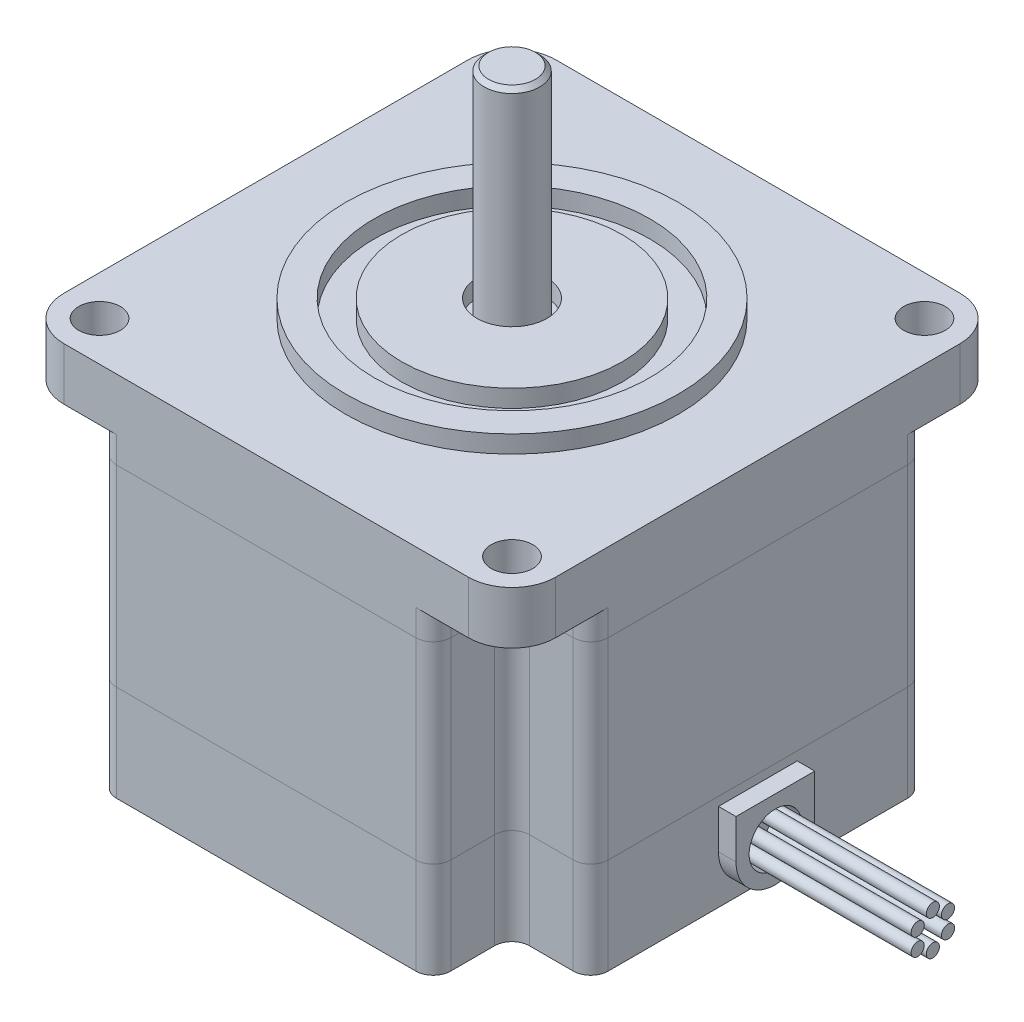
ISO-10303-21;
HEADER;
FILE_DESCRIPTION(('STEP AP214'),'2;1');
FILE_NAME('part.step','',(''),(''),'','','');
FILE_SCHEMA(('AUTOMOTIVE_DESIGN { 1 0 10303 214 1 1 1 1 }'));
ENDSEC;
DATA;
#1=APPLICATION_CONTEXT('core data for automotive mechanical design processes');
#2=APPLICATION_PROTOCOL_DEFINITION('international standard','automotive_design',2000,#1);
#3=PRODUCT_CONTEXT('',#1,'mechanical');
#4=PRODUCT('Part','Part','',(#3));
#5=PRODUCT_RELATED_PRODUCT_CATEGORY('part','',(#4));
#6=PRODUCT_DEFINITION_FORMATION('','',#4);
#7=PRODUCT_DEFINITION_CONTEXT('part definition',#1,'design');
#8=PRODUCT_DEFINITION('design','',#6,#7);
#9=PRODUCT_DEFINITION_SHAPE('','',#8);
#10=(LENGTH_UNIT() NAMED_UNIT(*) SI_UNIT(.MILLI.,.METRE.));
#11=(NAMED_UNIT(*) PLANE_ANGLE_UNIT() SI_UNIT($,.RADIAN.));
#12=(NAMED_UNIT(*) SI_UNIT($,.STERADIAN.) SOLID_ANGLE_UNIT());
#13=UNCERTAINTY_MEASURE_WITH_UNIT(LENGTH_MEASURE(1.E-05),#10,'distance_accuracy_value','');
#14=(GEOMETRIC_REPRESENTATION_CONTEXT(3) GLOBAL_UNCERTAINTY_ASSIGNED_CONTEXT((#13)) GLOBAL_UNIT_ASSIGNED_CONTEXT((#10,
#11,#12)) REPRESENTATION_CONTEXT('',''));
#15=CARTESIAN_POINT('',(0.,0.,0.));
#16=DIRECTION('',(0.,0.,1.));
#17=DIRECTION('',(1.,0.,0.));
#18=AXIS2_PLACEMENT_3D('',#15,#16,#17);
#19=CARTESIAN_POINT('',(0.,67.,0.));
#20=DIRECTION('',(0.,-1.,0.));
#21=DIRECTION('',(0.,0.,-1.));
#22=AXIS2_PLACEMENT_3D('',#19,#20,#21);
#23=CYLINDRICAL_SURFACE('',#22,3.175);
#24=CARTESIAN_POINT('',(0.,66.5,0.));
#25=DIRECTION('',(0.,1.,0.));
#26=DIRECTION('',(0.,0.,1.));
#27=AXIS2_PLACEMENT_3D('',#24,#25,#26);
#28=CIRCLE('',#27,3.175);
#29=CARTESIAN_POINT('',(0.,66.5,3.175));
#30=VERTEX_POINT('',#29);
#31=EDGE_CURVE('E12',#30,#30,#28,.F.);
#32=ORIENTED_EDGE('',*,*,#31,.T.);
#33=EDGE_LOOP('',(#32));
#34=FACE_BOUND('',#33,.T.);
#35=CARTESIAN_POINT('',(0.,42.,0.));
#36=DIRECTION('',(0.,1.,0.));
#37=DIRECTION('',(0.,0.,1.));
#38=AXIS2_PLACEMENT_3D('',#35,#36,#37);
#39=CIRCLE('',#38,3.175);
#40=CARTESIAN_POINT('',(0.,42.,3.175));
#41=VERTEX_POINT('',#40);
#42=EDGE_CURVE('E65',#41,#41,#39,.T.);
#43=ORIENTED_EDGE('',*,*,#42,.T.);
#44=EDGE_LOOP('',(#43));
#45=FACE_BOUND('',#44,.T.);
#46=ADVANCED_FACE('F54',(#34,#45),#23,.T.);
#47=CARTESIAN_POINT('',(0.,67.,0.));
#48=DIRECTION('',(0.,1.,0.));
#49=DIRECTION('',(0.,0.,1.));
#50=AXIS2_PLACEMENT_3D('',#47,#48,#49);
#51=PLANE('',#50);
#52=CARTESIAN_POINT('',(0.,67.,0.));
#53=DIRECTION('',(0.,1.,0.));
#54=DIRECTION('',(0.,0.,1.));
#55=AXIS2_PLACEMENT_3D('',#52,#53,#54);
#56=CIRCLE('',#55,2.67499999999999);
#57=CARTESIAN_POINT('',(0.,67.,2.67499999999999));
#58=VERTEX_POINT('',#57);
#59=EDGE_CURVE('E61',#58,#58,#56,.T.);
#60=ORIENTED_EDGE('',*,*,#59,.T.);
#61=EDGE_LOOP('',(#60));
#62=FACE_BOUND('',#61,.T.);
#63=ADVANCED_FACE('F75',(#62),#51,.T.);
#64=CARTESIAN_POINT('',(0.,42.,0.));
#65=DIRECTION('',(0.,1.,0.));
#66=DIRECTION('',(0.,0.,1.));
#67=AXIS2_PLACEMENT_3D('',#64,#65,#66);
#68=PLANE('',#67);
#69=ORIENTED_EDGE('',*,*,#42,.F.);
#70=EDGE_LOOP('',(#69));
#71=FACE_BOUND('',#70,.T.);
#72=ADVANCED_FACE('F73',(#71),#68,.F.);
#73=CARTESIAN_POINT('',(0.,67.,0.));
#74=DIRECTION('',(0.,-1.,0.));
#75=DIRECTION('',(0.,0.,-1.));
#76=AXIS2_PLACEMENT_3D('',#73,#74,#75);
#77=CONICAL_SURFACE('',#76,2.67499999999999,0.785398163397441);
#78=ORIENTED_EDGE('',*,*,#31,.F.);
#79=EDGE_LOOP('',(#78));
#80=FACE_BOUND('',#79,.T.);
#81=ORIENTED_EDGE('',*,*,#59,.F.);
#82=EDGE_LOOP('',(#81));
#83=FACE_BOUND('',#82,.T.);
#84=ADVANCED_FACE('F56',(#80,#83),#77,.T.);
#85=CLOSED_SHELL('',(#46,#63,#72,#84));
#86=MANIFOLD_SOLID_BREP('B2',#85);
#87=CARTESIAN_POINT('',(48.1,7.5,0.));
#88=DIRECTION('',(-1.,0.,0.));
#89=DIRECTION('',(0.,0.,1.));
#90=AXIS2_PLACEMENT_3D('',#87,#88,#89);
#91=CYLINDRICAL_SURFACE('',#90,0.75);
#92=CARTESIAN_POINT('',(48.1,7.5,0.));
#93=DIRECTION('',(1.,0.,0.));
#94=DIRECTION('',(0.,0.,-1.));
#95=AXIS2_PLACEMENT_3D('',#92,#93,#94);
#96=CIRCLE('',#95,0.75);
#97=CARTESIAN_POINT('',(48.1,7.5,-0.750000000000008));
#98=VERTEX_POINT('',#97);
#99=EDGE_CURVE('E130',#98,#98,#96,.T.);
#100=ORIENTED_EDGE('',*,*,#99,.F.);
#101=EDGE_LOOP('',(#100));
#102=FACE_BOUND('',#101,.T.);
#103=CARTESIAN_POINT('',(28.1,7.5,0.));
#104=DIRECTION('',(1.,0.,0.));
#105=DIRECTION('',(0.,0.,-1.));
#106=AXIS2_PLACEMENT_3D('',#103,#104,#105);
#107=CIRCLE('',#106,0.75);
#108=CARTESIAN_POINT('',(28.1,7.5,-0.750000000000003));
#109=VERTEX_POINT('',#108);
#110=EDGE_CURVE('E53',#109,#109,#107,.T.);
#111=ORIENTED_EDGE('',*,*,#110,.T.);
#112=EDGE_LOOP('',(#111));
#113=FACE_BOUND('',#112,.T.);
#114=ADVANCED_FACE('F126',(#102,#113),#91,.T.);
#115=CARTESIAN_POINT('',(48.1,0.,0.));
#116=DIRECTION('',(1.,0.,0.));
#117=DIRECTION('',(0.,0.,-1.));
#118=AXIS2_PLACEMENT_3D('',#115,#116,#117);
#119=PLANE('',#118);
#120=ORIENTED_EDGE('',*,*,#99,.T.);
#121=EDGE_LOOP('',(#120));
#122=FACE_BOUND('',#121,.T.);
#123=ADVANCED_FACE('F128',(#122),#119,.T.);
#124=CARTESIAN_POINT('',(28.1,0.,0.));
#125=DIRECTION('',(1.,0.,0.));
#126=DIRECTION('',(0.,0.,-1.));
#127=AXIS2_PLACEMENT_3D('',#124,#125,#126);
#128=PLANE('',#127);
#129=ORIENTED_EDGE('',*,*,#110,.F.);
#130=EDGE_LOOP('',(#129));
#131=FACE_BOUND('',#130,.T.);
#132=ADVANCED_FACE('F145',(#131),#128,.F.);
#133=CLOSED_SHELL('',(#114,#123,#132));
#134=MANIFOLD_SOLID_BREP('B7',#133);
#135=CARTESIAN_POINT('',(48.1,6.5,-1.73205080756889));
#136=DIRECTION('',(-1.,0.,0.));
#137=DIRECTION('',(0.,0.,1.));
#138=AXIS2_PLACEMENT_3D('',#135,#136,#137);
#139=CYLINDRICAL_SURFACE('',#138,0.75);
#140=CARTESIAN_POINT('',(48.1,6.5,-1.73205080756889));
#141=DIRECTION('',(1.,0.,0.));
#142=DIRECTION('',(0.,0.,-1.));
#143=AXIS2_PLACEMENT_3D('',#140,#141,#142);
#144=CIRCLE('',#143,0.75);
#145=CARTESIAN_POINT('',(48.1,6.5,-2.48205080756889));
#146=VERTEX_POINT('',#145);
#147=EDGE_CURVE('E189',#146,#146,#144,.T.);
#148=ORIENTED_EDGE('',*,*,#147,.F.);
#149=EDGE_LOOP('',(#148));
#150=FACE_BOUND('',#149,.T.);
#151=CARTESIAN_POINT('',(28.1,6.5,-1.73205080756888));
#152=DIRECTION('',(1.,0.,0.));
#153=DIRECTION('',(0.,0.,-1.));
#154=AXIS2_PLACEMENT_3D('',#151,#152,#153);
#155=CIRCLE('',#154,0.75);
#156=CARTESIAN_POINT('',(28.1,6.5,-2.48205080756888));
#157=VERTEX_POINT('',#156);
#158=EDGE_CURVE('E125',#157,#157,#155,.T.);
#159=ORIENTED_EDGE('',*,*,#158,.T.);
#160=EDGE_LOOP('',(#159));
#161=FACE_BOUND('',#160,.T.);
#162=ADVANCED_FACE('F185',(#150,#161),#139,.T.);
#163=CARTESIAN_POINT('',(48.1,0.,0.));
#164=DIRECTION('',(1.,0.,0.));
#165=DIRECTION('',(0.,0.,-1.));
#166=AXIS2_PLACEMENT_3D('',#163,#164,#165);
#167=PLANE('',#166);
#168=ORIENTED_EDGE('',*,*,#147,.T.);
#169=EDGE_LOOP('',(#168));
#170=FACE_BOUND('',#169,.T.);
#171=ADVANCED_FACE('F187',(#170),#167,.T.);
#172=CARTESIAN_POINT('',(28.1,0.,0.));
#173=DIRECTION('',(1.,0.,0.));
#174=DIRECTION('',(0.,0.,-1.));
#175=AXIS2_PLACEMENT_3D('',#172,#173,#174);
#176=PLANE('',#175);
#177=ORIENTED_EDGE('',*,*,#158,.F.);
#178=EDGE_LOOP('',(#177));
#179=FACE_BOUND('',#178,.T.);
#180=ADVANCED_FACE('F204',(#179),#176,.F.);
#181=CLOSED_SHELL('',(#162,#171,#180));
#182=MANIFOLD_SOLID_BREP('B48',#181);
#183=CARTESIAN_POINT('',(48.1,4.5,-1.73205080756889));
#184=DIRECTION('',(-1.,0.,0.));
#185=DIRECTION('',(0.,0.,1.));
#186=AXIS2_PLACEMENT_3D('',#183,#184,#185);
#187=CYLINDRICAL_SURFACE('',#186,0.750000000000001);
#188=CARTESIAN_POINT('',(48.1,4.5,-1.73205080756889));
#189=DIRECTION('',(1.,0.,0.));
#190=DIRECTION('',(0.,0.,-1.));
#191=AXIS2_PLACEMENT_3D('',#188,#189,#190);
#192=CIRCLE('',#191,0.750000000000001);
#193=CARTESIAN_POINT('',(48.1,4.5,-2.48205080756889));
#194=VERTEX_POINT('',#193);
#195=EDGE_CURVE('E248',#194,#194,#192,.T.);
#196=ORIENTED_EDGE('',*,*,#195,.F.);
#197=EDGE_LOOP('',(#196));
#198=FACE_BOUND('',#197,.T.);
#199=CARTESIAN_POINT('',(28.1,4.5,-1.73205080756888));
#200=DIRECTION('',(1.,0.,0.));
#201=DIRECTION('',(0.,0.,-1.));
#202=AXIS2_PLACEMENT_3D('',#199,#200,#201);
#203=CIRCLE('',#202,0.750000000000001);
#204=CARTESIAN_POINT('',(28.1,4.5,-2.48205080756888));
#205=VERTEX_POINT('',#204);
#206=EDGE_CURVE('E184',#205,#205,#203,.T.);
#207=ORIENTED_EDGE('',*,*,#206,.T.);
#208=EDGE_LOOP('',(#207));
#209=FACE_BOUND('',#208,.T.);
#210=ADVANCED_FACE('F244',(#198,#209),#187,.T.);
#211=CARTESIAN_POINT('',(48.1,0.,0.));
#212=DIRECTION('',(1.,0.,0.));
#213=DIRECTION('',(0.,0.,-1.));
#214=AXIS2_PLACEMENT_3D('',#211,#212,#213);
#215=PLANE('',#214);
#216=ORIENTED_EDGE('',*,*,#195,.T.);
#217=EDGE_LOOP('',(#216));
#218=FACE_BOUND('',#217,.T.);
#219=ADVANCED_FACE('F246',(#218),#215,.T.);
#220=CARTESIAN_POINT('',(28.1,0.,0.));
#221=DIRECTION('',(1.,0.,0.));
#222=DIRECTION('',(0.,0.,-1.));
#223=AXIS2_PLACEMENT_3D('',#220,#221,#222);
#224=PLANE('',#223);
#225=ORIENTED_EDGE('',*,*,#206,.F.);
#226=EDGE_LOOP('',(#225));
#227=FACE_BOUND('',#226,.T.);
#228=ADVANCED_FACE('F263',(#227),#224,.F.);
#229=CLOSED_SHELL('',(#210,#219,#228));
#230=MANIFOLD_SOLID_BREP('B120',#229);
#231=CARTESIAN_POINT('',(48.1,3.5,0.));
#232=DIRECTION('',(-1.,0.,0.));
#233=DIRECTION('',(0.,0.,1.));
#234=AXIS2_PLACEMENT_3D('',#231,#232,#233);
#235=CYLINDRICAL_SURFACE('',#234,0.75);
#236=CARTESIAN_POINT('',(48.1,3.5,0.));
#237=DIRECTION('',(1.,0.,0.));
#238=DIRECTION('',(0.,0.,-1.));
#239=AXIS2_PLACEMENT_3D('',#236,#237,#238);
#240=CIRCLE('',#239,0.75);
#241=CARTESIAN_POINT('',(48.1,3.5,-0.750000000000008));
#242=VERTEX_POINT('',#241);
#243=EDGE_CURVE('E307',#242,#242,#240,.T.);
#244=ORIENTED_EDGE('',*,*,#243,.F.);
#245=EDGE_LOOP('',(#244));
#246=FACE_BOUND('',#245,.T.);
#247=CARTESIAN_POINT('',(28.1,3.5,0.));
#248=DIRECTION('',(1.,0.,0.));
#249=DIRECTION('',(0.,0.,-1.));
#250=AXIS2_PLACEMENT_3D('',#247,#248,#249);
#251=CIRCLE('',#250,0.75);
#252=CARTESIAN_POINT('',(28.1,3.5,-0.750000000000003));
#253=VERTEX_POINT('',#252);
#254=EDGE_CURVE('E243',#253,#253,#251,.T.);
#255=ORIENTED_EDGE('',*,*,#254,.T.);
#256=EDGE_LOOP('',(#255));
#257=FACE_BOUND('',#256,.T.);
#258=ADVANCED_FACE('F303',(#246,#257),#235,.T.);
#259=CARTESIAN_POINT('',(48.1,0.,0.));
#260=DIRECTION('',(1.,0.,0.));
#261=DIRECTION('',(0.,0.,-1.));
#262=AXIS2_PLACEMENT_3D('',#259,#260,#261);
#263=PLANE('',#262);
#264=ORIENTED_EDGE('',*,*,#243,.T.);
#265=EDGE_LOOP('',(#264));
#266=FACE_BOUND('',#265,.T.);
#267=ADVANCED_FACE('F305',(#266),#263,.T.);
#268=CARTESIAN_POINT('',(28.1,0.,0.));
#269=DIRECTION('',(1.,0.,0.));
#270=DIRECTION('',(0.,0.,-1.));
#271=AXIS2_PLACEMENT_3D('',#268,#269,#270);
#272=PLANE('',#271);
#273=ORIENTED_EDGE('',*,*,#254,.F.);
#274=EDGE_LOOP('',(#273));
#275=FACE_BOUND('',#274,.T.);
#276=ADVANCED_FACE('F322',(#275),#272,.F.);
#277=CLOSED_SHELL('',(#258,#267,#276));
#278=MANIFOLD_SOLID_BREP('B179',#277);
#279=CARTESIAN_POINT('',(48.1,4.5,1.73205080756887));
#280=DIRECTION('',(-1.,0.,0.));
#281=DIRECTION('',(0.,0.,1.));
#282=AXIS2_PLACEMENT_3D('',#279,#280,#281);
#283=CYLINDRICAL_SURFACE('',#282,0.75);
#284=CARTESIAN_POINT('',(48.1,4.5,1.73205080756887));
#285=DIRECTION('',(1.,0.,0.));
#286=DIRECTION('',(0.,0.,-1.));
#287=AXIS2_PLACEMENT_3D('',#284,#285,#286);
#288=CIRCLE('',#287,0.75);
#289=CARTESIAN_POINT('',(48.1,4.5,0.98205080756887));
#290=VERTEX_POINT('',#289);
#291=EDGE_CURVE('E362',#290,#290,#288,.T.);
#292=ORIENTED_EDGE('',*,*,#291,.F.);
#293=EDGE_LOOP('',(#292));
#294=FACE_BOUND('',#293,.T.);
#295=CARTESIAN_POINT('',(28.1,4.5,1.73205080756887));
#296=DIRECTION('',(1.,0.,0.));
#297=DIRECTION('',(0.,0.,-1.));
#298=AXIS2_PLACEMENT_3D('',#295,#296,#297);
#299=CIRCLE('',#298,0.75);
#300=CARTESIAN_POINT('',(28.1,4.5,0.982050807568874));
#301=VERTEX_POINT('',#300);
#302=EDGE_CURVE('E302',#301,#301,#299,.T.);
#303=ORIENTED_EDGE('',*,*,#302,.T.);
#304=EDGE_LOOP('',(#303));
#305=FACE_BOUND('',#304,.T.);
#306=ADVANCED_FACE('F358',(#294,#305),#283,.T.);
#307=CARTESIAN_POINT('',(48.1,0.,0.));
#308=DIRECTION('',(1.,0.,0.));
#309=DIRECTION('',(0.,0.,-1.));
#310=AXIS2_PLACEMENT_3D('',#307,#308,#309);
#311=PLANE('',#310);
#312=ORIENTED_EDGE('',*,*,#291,.T.);
#313=EDGE_LOOP('',(#312));
#314=FACE_BOUND('',#313,.T.);
#315=ADVANCED_FACE('F360',(#314),#311,.T.);
#316=CARTESIAN_POINT('',(28.1,0.,0.));
#317=DIRECTION('',(1.,0.,0.));
#318=DIRECTION('',(0.,0.,-1.));
#319=AXIS2_PLACEMENT_3D('',#316,#317,#318);
#320=PLANE('',#319);
#321=ORIENTED_EDGE('',*,*,#302,.F.);
#322=EDGE_LOOP('',(#321));
#323=FACE_BOUND('',#322,.T.);
#324=ADVANCED_FACE('F377',(#323),#320,.F.);
#325=CLOSED_SHELL('',(#306,#315,#324));
#326=MANIFOLD_SOLID_BREP('B238',#325);
#327=CARTESIAN_POINT('',(48.1,6.5,1.73205080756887));
#328=DIRECTION('',(-1.,0.,0.));
#329=DIRECTION('',(0.,0.,1.));
#330=AXIS2_PLACEMENT_3D('',#327,#328,#329);
#331=CYLINDRICAL_SURFACE('',#330,0.749999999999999);
#332=CARTESIAN_POINT('',(48.1,6.5,1.73205080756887));
#333=DIRECTION('',(1.,0.,0.));
#334=DIRECTION('',(0.,0.,-1.));
#335=AXIS2_PLACEMENT_3D('',#332,#333,#334);
#336=CIRCLE('',#335,0.749999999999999);
#337=CARTESIAN_POINT('',(48.1,6.5,0.98205080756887));
#338=VERTEX_POINT('',#337);
#339=EDGE_CURVE('E357',#338,#338,#336,.T.);
#340=ORIENTED_EDGE('',*,*,#339,.F.);
#341=EDGE_LOOP('',(#340));
#342=FACE_BOUND('',#341,.T.);
#343=CARTESIAN_POINT('',(28.1,6.5,1.73205080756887));
#344=DIRECTION('',(1.,0.,0.));
#345=DIRECTION('',(0.,0.,-1.));
#346=AXIS2_PLACEMENT_3D('',#343,#344,#345);
#347=CIRCLE('',#346,0.749999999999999);
#348=CARTESIAN_POINT('',(28.1,6.5,0.982050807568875));
#349=VERTEX_POINT('',#348);
#350=EDGE_CURVE('E422',#349,#349,#347,.T.);
#351=ORIENTED_EDGE('',*,*,#350,.T.);
#352=EDGE_LOOP('',(#351));
#353=FACE_BOUND('',#352,.T.);
#354=ADVANCED_FACE('F419',(#342,#353),#331,.T.);
#355=CARTESIAN_POINT('',(48.1,0.,0.));
#356=DIRECTION('',(1.,0.,0.));
#357=DIRECTION('',(0.,0.,-1.));
#358=AXIS2_PLACEMENT_3D('',#355,#356,#357);
#359=PLANE('',#358);
#360=ORIENTED_EDGE('',*,*,#339,.T.);
#361=EDGE_LOOP('',(#360));
#362=FACE_BOUND('',#361,.T.);
#363=ADVANCED_FACE('F434',(#362),#359,.T.);
#364=CARTESIAN_POINT('',(28.1,0.,0.));
#365=DIRECTION('',(1.,0.,0.));
#366=DIRECTION('',(0.,0.,-1.));
#367=AXIS2_PLACEMENT_3D('',#364,#365,#366);
#368=PLANE('',#367);
#369=ORIENTED_EDGE('',*,*,#350,.F.);
#370=EDGE_LOOP('',(#369));
#371=FACE_BOUND('',#370,.T.);
#372=ADVANCED_FACE('F432',(#371),#368,.F.);
#373=CLOSED_SHELL('',(#354,#363,#372));
#374=MANIFOLD_SOLID_BREP('B297',#373);
#375=CARTESIAN_POINT('',(30.1,5.5,0.));
#376=DIRECTION('',(1.,0.,0.));
#377=DIRECTION('',(0.,0.,-1.));
#378=AXIS2_PLACEMENT_3D('',#375,#376,#377);
#379=PLANE('',#378);
#380=CARTESIAN_POINT('',(30.1,5.5,0.));
#381=DIRECTION('',(1.,0.,0.));
#382=DIRECTION('',(0.,0.,-1.));
#383=AXIS2_PLACEMENT_3D('',#380,#381,#382);
#384=CIRCLE('',#383,4.5);
#385=CARTESIAN_POINT('',(30.1,5.5,4.5));
#386=VERTEX_POINT('',#385);
#387=CARTESIAN_POINT('',(30.1,5.50000000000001,-4.5));
#388=VERTEX_POINT('',#387);
#389=EDGE_CURVE('E533',#386,#388,#384,.T.);
#390=ORIENTED_EDGE('',*,*,#389,.T.);
#391=DIRECTION('',(0.,1.,0.));
#392=VECTOR('',#391,1.);
#393=CARTESIAN_POINT('',(30.1,5.50000000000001,-4.5));
#394=LINE('',#393,#392);
#395=CARTESIAN_POINT('',(30.1,10.,-4.5));
#396=VERTEX_POINT('',#395);
#397=EDGE_CURVE('E528',#388,#396,#394,.T.);
#398=ORIENTED_EDGE('',*,*,#397,.T.);
#399=DIRECTION('',(0.,0.,1.));
#400=VECTOR('',#399,1.);
#401=CARTESIAN_POINT('',(30.1,10.,4.5));
#402=LINE('',#401,#400);
#403=CARTESIAN_POINT('',(30.1,10.,4.5));
#404=VERTEX_POINT('',#403);
#405=EDGE_CURVE('E531',#396,#404,#402,.T.);
#406=ORIENTED_EDGE('',*,*,#405,.T.);
#407=DIRECTION('',(0.,-1.,0.));
#408=VECTOR('',#407,1.);
#409=CARTESIAN_POINT('',(30.1,5.5,4.5));
#410=LINE('',#409,#408);
#411=EDGE_CURVE('E498',#404,#386,#410,.T.);
#412=ORIENTED_EDGE('',*,*,#411,.T.);
#413=EDGE_LOOP('',(#390,#398,#406,#412));
#414=FACE_BOUND('',#413,.T.);
#415=CARTESIAN_POINT('',(30.1,5.5,0.));
#416=DIRECTION('',(1.,0.,0.));
#417=DIRECTION('',(0.,0.,-1.));
#418=AXIS2_PLACEMENT_3D('',#415,#416,#417);
#419=CIRCLE('',#418,3.);
#420=CARTESIAN_POINT('',(30.1,5.5,-3.));
#421=VERTEX_POINT('',#420);
#422=EDGE_CURVE('E548',#421,#421,#419,.T.);
#423=ORIENTED_EDGE('',*,*,#422,.F.);
#424=EDGE_LOOP('',(#423));
#425=FACE_BOUND('',#424,.T.);
#426=ADVANCED_FACE('F481',(#414,#425),#379,.T.);
#427=CARTESIAN_POINT('',(28.1,5.5,0.));
#428=DIRECTION('',(1.,0.,0.));
#429=DIRECTION('',(0.,0.,-1.));
#430=AXIS2_PLACEMENT_3D('',#427,#428,#429);
#431=PLANE('',#430);
#432=CARTESIAN_POINT('',(28.1,5.5,0.));
#433=DIRECTION('',(1.,0.,0.));
#434=DIRECTION('',(0.,0.,-1.));
#435=AXIS2_PLACEMENT_3D('',#432,#433,#434);
#436=CIRCLE('',#435,4.5);
#437=CARTESIAN_POINT('',(28.1,5.5,4.5));
#438=VERTEX_POINT('',#437);
#439=CARTESIAN_POINT('',(28.1,5.50000000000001,-4.5));
#440=VERTEX_POINT('',#439);
#441=EDGE_CURVE('E545',#438,#440,#436,.T.);
#442=ORIENTED_EDGE('',*,*,#441,.F.);
#443=DIRECTION('',(0.,-1.,0.));
#444=VECTOR('',#443,1.);
#445=CARTESIAN_POINT('',(28.1,5.5,4.5));
#446=LINE('',#445,#444);
#447=CARTESIAN_POINT('',(28.1,10.,4.5));
#448=VERTEX_POINT('',#447);
#449=EDGE_CURVE('E521',#448,#438,#446,.T.);
#450=ORIENTED_EDGE('',*,*,#449,.F.);
#451=DIRECTION('',(0.,0.,1.));
#452=VECTOR('',#451,1.);
#453=CARTESIAN_POINT('',(28.1,10.,4.5));
#454=LINE('',#453,#452);
#455=CARTESIAN_POINT('',(28.1,10.,-4.5));
#456=VERTEX_POINT('',#455);
#457=EDGE_CURVE('E515',#456,#448,#454,.T.);
#458=ORIENTED_EDGE('',*,*,#457,.F.);
#459=DIRECTION('',(0.,1.,0.));
#460=VECTOR('',#459,1.);
#461=CARTESIAN_POINT('',(28.1,5.50000000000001,-4.5));
#462=LINE('',#461,#460);
#463=EDGE_CURVE('E537',#440,#456,#462,.T.);
#464=ORIENTED_EDGE('',*,*,#463,.F.);
#465=EDGE_LOOP('',(#442,#450,#458,#464));
#466=FACE_BOUND('',#465,.T.);
#467=CARTESIAN_POINT('',(28.1,5.5,0.));
#468=DIRECTION('',(1.,0.,0.));
#469=DIRECTION('',(0.,0.,-1.));
#470=AXIS2_PLACEMENT_3D('',#467,#468,#469);
#471=CIRCLE('',#470,3.);
#472=CARTESIAN_POINT('',(28.1,5.5,-3.));
#473=VERTEX_POINT('',#472);
#474=EDGE_CURVE('E560',#473,#473,#471,.T.);
#475=ORIENTED_EDGE('',*,*,#474,.T.);
#476=EDGE_LOOP('',(#475));
#477=FACE_BOUND('',#476,.T.);
#478=ADVANCED_FACE('F556',(#466,#477),#431,.F.);
#479=CARTESIAN_POINT('',(30.1,5.5,0.));
#480=DIRECTION('',(-1.,0.,0.));
#481=DIRECTION('',(0.,0.,1.));
#482=AXIS2_PLACEMENT_3D('',#479,#480,#481);
#483=CYLINDRICAL_SURFACE('',#482,4.5);
#484=ORIENTED_EDGE('',*,*,#441,.T.);
#485=DIRECTION('',(-1.,0.,0.));
#486=VECTOR('',#485,1.);
#487=CARTESIAN_POINT('',(30.1,5.50000000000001,-4.5));
#488=LINE('',#487,#486);
#489=EDGE_CURVE('E417',#388,#440,#488,.T.);
#490=ORIENTED_EDGE('',*,*,#489,.F.);
#491=ORIENTED_EDGE('',*,*,#389,.F.);
#492=DIRECTION('',(-1.,0.,0.));
#493=VECTOR('',#492,1.);
#494=CARTESIAN_POINT('',(30.1,5.5,4.5));
#495=LINE('',#494,#493);
#496=EDGE_CURVE('E541',#386,#438,#495,.T.);
#497=ORIENTED_EDGE('',*,*,#496,.T.);
#498=EDGE_LOOP('',(#484,#490,#491,#497));
#499=FACE_BOUND('',#498,.T.);
#500=ADVANCED_FACE('F483',(#499),#483,.T.);
#501=CARTESIAN_POINT('',(30.1,5.50000000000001,-4.5));
#502=DIRECTION('',(0.,0.,1.));
#503=DIRECTION('',(0.,-1.,0.));
#504=AXIS2_PLACEMENT_3D('',#501,#502,#503);
#505=PLANE('',#504);
#506=ORIENTED_EDGE('',*,*,#463,.T.);
#507=DIRECTION('',(-1.,0.,0.));
#508=VECTOR('',#507,1.);
#509=CARTESIAN_POINT('',(30.1,10.,-4.5));
#510=LINE('',#509,#508);
#511=EDGE_CURVE('E490',#396,#456,#510,.T.);
#512=ORIENTED_EDGE('',*,*,#511,.F.);
#513=ORIENTED_EDGE('',*,*,#397,.F.);
#514=ORIENTED_EDGE('',*,*,#489,.T.);
#515=EDGE_LOOP('',(#506,#512,#513,#514));
#516=FACE_BOUND('',#515,.T.);
#517=ADVANCED_FACE('F536',(#516),#505,.F.);
#518=CARTESIAN_POINT('',(30.1,10.,4.5));
#519=DIRECTION('',(0.,-1.,0.));
#520=DIRECTION('',(0.,0.,-1.));
#521=AXIS2_PLACEMENT_3D('',#518,#519,#520);
#522=PLANE('',#521);
#523=ORIENTED_EDGE('',*,*,#457,.T.);
#524=DIRECTION('',(-1.,0.,0.));
#525=VECTOR('',#524,1.);
#526=CARTESIAN_POINT('',(30.1,10.,4.5));
#527=LINE('',#526,#525);
#528=EDGE_CURVE('E538',#404,#448,#527,.T.);
#529=ORIENTED_EDGE('',*,*,#528,.F.);
#530=ORIENTED_EDGE('',*,*,#405,.F.);
#531=ORIENTED_EDGE('',*,*,#511,.T.);
#532=EDGE_LOOP('',(#523,#529,#530,#531));
#533=FACE_BOUND('',#532,.T.);
#534=ADVANCED_FACE('F539',(#533),#522,.F.);
#535=CARTESIAN_POINT('',(30.1,5.5,4.5));
#536=DIRECTION('',(0.,0.,-1.));
#537=DIRECTION('',(-1.,0.,0.));
#538=AXIS2_PLACEMENT_3D('',#535,#536,#537);
#539=PLANE('',#538);
#540=ORIENTED_EDGE('',*,*,#449,.T.);
#541=ORIENTED_EDGE('',*,*,#496,.F.);
#542=ORIENTED_EDGE('',*,*,#411,.F.);
#543=ORIENTED_EDGE('',*,*,#528,.T.);
#544=EDGE_LOOP('',(#540,#541,#542,#543));
#545=FACE_BOUND('',#544,.T.);
#546=ADVANCED_FACE('F553',(#545),#539,.F.);
#547=CARTESIAN_POINT('',(30.1,5.5,0.));
#548=DIRECTION('',(-1.,0.,0.));
#549=DIRECTION('',(0.,0.,1.));
#550=AXIS2_PLACEMENT_3D('',#547,#548,#549);
#551=CYLINDRICAL_SURFACE('',#550,3.);
#552=ORIENTED_EDGE('',*,*,#422,.T.);
#553=EDGE_LOOP('',(#552));
#554=FACE_BOUND('',#553,.T.);
#555=ORIENTED_EDGE('',*,*,#474,.F.);
#556=EDGE_LOOP('',(#555));
#557=FACE_BOUND('',#556,.T.);
#558=ADVANCED_FACE('F566',(#554,#557),#551,.F.);
#559=CLOSED_SHELL('',(#426,#478,#500,#517,#534,#546,#558));
#560=MANIFOLD_SOLID_BREP('B352',#559);
#561=CARTESIAN_POINT('',(0.,42.,0.));
#562=DIRECTION('',(0.,1.,0.));
#563=DIRECTION('',(0.,0.,1.));
#564=AXIS2_PLACEMENT_3D('',#561,#562,#563);
#565=PLANE('',#564);
#566=CARTESIAN_POINT('',(0.,42.,0.));
#567=DIRECTION('',(0.,1.,0.));
#568=DIRECTION('',(0.,0.,1.));
#569=AXIS2_PLACEMENT_3D('',#566,#567,#568);
#570=CIRCLE('',#569,19.);
#571=CARTESIAN_POINT('',(0.,42.,19.));
#572=VERTEX_POINT('',#571);
#573=EDGE_CURVE('E959',#572,#572,#570,.T.);
#574=ORIENTED_EDGE('',*,*,#573,.F.);
#575=EDGE_LOOP('',(#574));
#576=FACE_BOUND('',#575,.T.);
#577=CARTESIAN_POINT('',(-23.57,42.,23.57));
#578=DIRECTION('',(0.,1.,0.));
#579=DIRECTION('',(0.,0.,1.));
#580=AXIS2_PLACEMENT_3D('',#577,#578,#579);
#581=CIRCLE('',#580,2.375);
#582=CARTESIAN_POINT('',(-23.57,42.,25.945));
#583=VERTEX_POINT('',#582);
#584=EDGE_CURVE('E973',#583,#583,#581,.T.);
#585=ORIENTED_EDGE('',*,*,#584,.F.);
#586=EDGE_LOOP('',(#585));
#587=FACE_BOUND('',#586,.T.);
#588=CARTESIAN_POINT('',(23.57,42.,-23.57));
#589=DIRECTION('',(0.,1.,0.));
#590=DIRECTION('',(0.,0.,1.));
#591=AXIS2_PLACEMENT_3D('',#588,#589,#590);
#592=CIRCLE('',#591,2.375);
#593=CARTESIAN_POINT('',(23.57,42.,-21.195));
#594=VERTEX_POINT('',#593);
#595=EDGE_CURVE('E979',#594,#594,#592,.T.);
#596=ORIENTED_EDGE('',*,*,#595,.F.);
#597=EDGE_LOOP('',(#596));
#598=FACE_BOUND('',#597,.T.);
#599=DIRECTION('',(0.,0.,1.));
#600=VECTOR('',#599,1.);
#601=CARTESIAN_POINT('',(-28.1,42.,-28.1));
#602=LINE('',#601,#600);
#603=CARTESIAN_POINT('',(-28.1,42.,-23.1));
#604=VERTEX_POINT('',#603);
#605=CARTESIAN_POINT('',(-28.1,42.,23.1));
#606=VERTEX_POINT('',#605);
#607=EDGE_CURVE('E983',#604,#606,#602,.T.);
#608=ORIENTED_EDGE('',*,*,#607,.T.);
#609=CARTESIAN_POINT('',(-23.1,42.,23.1));
#610=DIRECTION('',(0.,1.,0.));
#611=DIRECTION('',(0.,0.,1.));
#612=AXIS2_PLACEMENT_3D('',#609,#610,#611);
#613=CIRCLE('',#612,5.);
#614=CARTESIAN_POINT('',(-23.1,42.,28.1));
#615=VERTEX_POINT('',#614);
#616=EDGE_CURVE('E1030',#606,#615,#613,.T.);
#617=ORIENTED_EDGE('',*,*,#616,.T.);
#618=DIRECTION('',(1.,0.,0.));
#619=VECTOR('',#618,1.);
#620=CARTESIAN_POINT('',(-28.1,42.,28.1));
#621=LINE('',#620,#619);
#622=CARTESIAN_POINT('',(23.1,42.,28.1));
#623=VERTEX_POINT('',#622);
#624=EDGE_CURVE('E877',#615,#623,#621,.T.);
#625=ORIENTED_EDGE('',*,*,#624,.T.);
#626=CARTESIAN_POINT('',(23.1,42.,23.1));
#627=DIRECTION('',(0.,1.,0.));
#628=DIRECTION('',(0.,0.,1.));
#629=AXIS2_PLACEMENT_3D('',#626,#627,#628);
#630=CIRCLE('',#629,5.);
#631=CARTESIAN_POINT('',(28.1,42.,23.1));
#632=VERTEX_POINT('',#631);
#633=EDGE_CURVE('E1028',#623,#632,#630,.T.);
#634=ORIENTED_EDGE('',*,*,#633,.T.);
#635=DIRECTION('',(0.,0.,-1.));
#636=VECTOR('',#635,1.);
#637=CARTESIAN_POINT('',(28.1,42.,28.1));
#638=LINE('',#637,#636);
#639=CARTESIAN_POINT('',(28.1,42.,-23.1));
#640=VERTEX_POINT('',#639);
#641=EDGE_CURVE('E988',#632,#640,#638,.T.);
#642=ORIENTED_EDGE('',*,*,#641,.T.);
#643=CARTESIAN_POINT('',(23.1,42.,-23.1));
#644=DIRECTION('',(0.,1.,0.));
#645=DIRECTION('',(0.,0.,1.));
#646=AXIS2_PLACEMENT_3D('',#643,#644,#645);
#647=CIRCLE('',#646,5.);
#648=CARTESIAN_POINT('',(23.1,42.,-28.1));
#649=VERTEX_POINT('',#648);
#650=EDGE_CURVE('E1026',#640,#649,#647,.T.);
#651=ORIENTED_EDGE('',*,*,#650,.T.);
#652=DIRECTION('',(-1.,0.,0.));
#653=VECTOR('',#652,1.);
#654=CARTESIAN_POINT('',(28.1,42.,-28.1));
#655=LINE('',#654,#653);
#656=CARTESIAN_POINT('',(-23.1,42.,-28.1));
#657=VERTEX_POINT('',#656);
#658=EDGE_CURVE('E991',#649,#657,#655,.T.);
#659=ORIENTED_EDGE('',*,*,#658,.T.);
#660=CARTESIAN_POINT('',(-23.1,42.,-23.1));
#661=DIRECTION('',(0.,1.,0.));
#662=DIRECTION('',(0.,0.,1.));
#663=AXIS2_PLACEMENT_3D('',#660,#661,#662);
#664=CIRCLE('',#663,5.);
#665=EDGE_CURVE('E1024',#657,#604,#664,.T.);
#666=ORIENTED_EDGE('',*,*,#665,.T.);
#667=EDGE_LOOP('',(#608,#617,#625,#634,#642,#651,#659,#666));
#668=FACE_BOUND('',#667,.T.);
#669=CARTESIAN_POINT('',(23.57,42.,23.57));
#670=DIRECTION('',(0.,1.,0.));
#671=DIRECTION('',(0.,0.,1.));
#672=AXIS2_PLACEMENT_3D('',#669,#670,#671);
#673=CIRCLE('',#672,2.375);
#674=CARTESIAN_POINT('',(23.57,42.,25.945));
#675=VERTEX_POINT('',#674);
#676=EDGE_CURVE('E976',#675,#675,#673,.T.);
#677=ORIENTED_EDGE('',*,*,#676,.F.);
#678=EDGE_LOOP('',(#677));
#679=FACE_BOUND('',#678,.T.);
#680=CARTESIAN_POINT('',(-23.57,42.,-23.57));
#681=DIRECTION('',(0.,1.,0.));
#682=DIRECTION('',(0.,0.,1.));
#683=AXIS2_PLACEMENT_3D('',#680,#681,#682);
#684=CIRCLE('',#683,2.375);
#685=CARTESIAN_POINT('',(-23.57,42.,-21.195));
#686=VERTEX_POINT('',#685);
#687=EDGE_CURVE('E968',#686,#686,#684,.T.);
#688=ORIENTED_EDGE('',*,*,#687,.F.);
#689=EDGE_LOOP('',(#688));
#690=FACE_BOUND('',#689,.T.);
#691=ADVANCED_FACE('F651',(#576,#587,#598,#668,#679,#690),#565,.T.);
#692=CARTESIAN_POINT('',(0.,33.,0.));
#693=DIRECTION('',(0.,1.,0.));
#694=DIRECTION('',(0.,0.,1.));
#695=AXIS2_PLACEMENT_3D('',#692,#693,#694);
#696=PLANE('',#695);
#697=DIRECTION('',(-1.,0.,0.));
#698=VECTOR('',#697,1.);
#699=CARTESIAN_POINT('',(28.1,33.,-28.1));
#700=LINE('',#699,#698);
#701=CARTESIAN_POINT('',(17.1,33.,-28.1));
#702=VERTEX_POINT('',#701);
#703=CARTESIAN_POINT('',(-17.1,33.,-28.1));
#704=VERTEX_POINT('',#703);
#705=EDGE_CURVE('E986',#702,#704,#700,.T.);
#706=ORIENTED_EDGE('',*,*,#705,.F.);
#707=CARTESIAN_POINT('',(17.1,33.,-26.1));
#708=DIRECTION('',(0.,1.,0.));
#709=DIRECTION('',(0.,0.,1.));
#710=AXIS2_PLACEMENT_3D('',#707,#708,#709);
#711=CIRCLE('',#710,2.);
#712=CARTESIAN_POINT('',(19.1,33.,-26.1));
#713=VERTEX_POINT('',#712);
#714=EDGE_CURVE('E1068',#702,#713,#711,.F.);
#715=ORIENTED_EDGE('',*,*,#714,.T.);
#716=DIRECTION('',(0.,0.,1.));
#717=VECTOR('',#716,1.);
#718=CARTESIAN_POINT('',(19.1,33.,0.));
#719=LINE('',#718,#717);
#720=CARTESIAN_POINT('',(19.1,33.,-21.1));
#721=VERTEX_POINT('',#720);
#722=EDGE_CURVE('E930',#713,#721,#719,.T.);
#723=ORIENTED_EDGE('',*,*,#722,.T.);
#724=CARTESIAN_POINT('',(21.1,33.,-21.1));
#725=DIRECTION('',(0.,1.,0.));
#726=DIRECTION('',(0.,0.,1.));
#727=AXIS2_PLACEMENT_3D('',#724,#725,#726);
#728=CIRCLE('',#727,2.);
#729=CARTESIAN_POINT('',(21.1,33.,-19.1));
#730=VERTEX_POINT('',#729);
#731=EDGE_CURVE('E1139',#721,#730,#728,.T.);
#732=ORIENTED_EDGE('',*,*,#731,.T.);
#733=DIRECTION('',(1.,0.,0.));
#734=VECTOR('',#733,1.);
#735=CARTESIAN_POINT('',(0.,33.,-19.1));
#736=LINE('',#735,#734);
#737=CARTESIAN_POINT('',(26.1,33.,-19.1));
#738=VERTEX_POINT('',#737);
#739=EDGE_CURVE('E934',#730,#738,#736,.T.);
#740=ORIENTED_EDGE('',*,*,#739,.T.);
#741=CARTESIAN_POINT('',(26.1,33.,-17.1));
#742=DIRECTION('',(0.,1.,0.));
#743=DIRECTION('',(0.,0.,1.));
#744=AXIS2_PLACEMENT_3D('',#741,#742,#743);
#745=CIRCLE('',#744,2.);
#746=CARTESIAN_POINT('',(28.1,33.,-17.1));
#747=VERTEX_POINT('',#746);
#748=EDGE_CURVE('E1066',#738,#747,#745,.F.);
#749=ORIENTED_EDGE('',*,*,#748,.T.);
#750=DIRECTION('',(0.,0.,-1.));
#751=VECTOR('',#750,1.);
#752=CARTESIAN_POINT('',(28.1,33.,28.1));
#753=LINE('',#752,#751);
#754=CARTESIAN_POINT('',(28.1,33.,17.1));
#755=VERTEX_POINT('',#754);
#756=EDGE_CURVE('E1000',#755,#747,#753,.T.);
#757=ORIENTED_EDGE('',*,*,#756,.F.);
#758=CARTESIAN_POINT('',(26.1,33.,17.1));
#759=DIRECTION('',(0.,1.,0.));
#760=DIRECTION('',(0.,0.,1.));
#761=AXIS2_PLACEMENT_3D('',#758,#759,#760);
#762=CIRCLE('',#761,2.);
#763=CARTESIAN_POINT('',(26.1,33.,19.1));
#764=VERTEX_POINT('',#763);
#765=EDGE_CURVE('E1056',#755,#764,#762,.F.);
#766=ORIENTED_EDGE('',*,*,#765,.T.);
#767=DIRECTION('',(-1.,0.,0.));
#768=VECTOR('',#767,1.);
#769=CARTESIAN_POINT('',(0.,33.,19.1));
#770=LINE('',#769,#768);
#771=CARTESIAN_POINT('',(21.1,33.,19.1));
#772=VERTEX_POINT('',#771);
#773=EDGE_CURVE('E937',#764,#772,#770,.T.);
#774=ORIENTED_EDGE('',*,*,#773,.T.);
#775=CARTESIAN_POINT('',(21.1,33.,21.1));
#776=DIRECTION('',(0.,1.,0.));
#777=DIRECTION('',(0.,0.,1.));
#778=AXIS2_PLACEMENT_3D('',#775,#776,#777);
#779=CIRCLE('',#778,2.);
#780=CARTESIAN_POINT('',(19.1,33.,21.1));
#781=VERTEX_POINT('',#780);
#782=EDGE_CURVE('E659',#772,#781,#779,.T.);
#783=ORIENTED_EDGE('',*,*,#782,.T.);
#784=DIRECTION('',(0.,0.,1.));
#785=VECTOR('',#784,1.);
#786=CARTESIAN_POINT('',(19.1,33.,0.));
#787=LINE('',#786,#785);
#788=CARTESIAN_POINT('',(19.1,33.,26.1));
#789=VERTEX_POINT('',#788);
#790=EDGE_CURVE('E940',#781,#789,#787,.T.);
#791=ORIENTED_EDGE('',*,*,#790,.T.);
#792=CARTESIAN_POINT('',(17.1,33.,26.1));
#793=DIRECTION('',(0.,1.,0.));
#794=DIRECTION('',(0.,0.,1.));
#795=AXIS2_PLACEMENT_3D('',#792,#793,#794);
#796=CIRCLE('',#795,2.);
#797=CARTESIAN_POINT('',(17.1,33.,28.1));
#798=VERTEX_POINT('',#797);
#799=EDGE_CURVE('E1054',#789,#798,#796,.F.);
#800=ORIENTED_EDGE('',*,*,#799,.T.);
#801=DIRECTION('',(1.,0.,0.));
#802=VECTOR('',#801,1.);
#803=CARTESIAN_POINT('',(-28.1,33.,28.1));
#804=LINE('',#803,#802);
#805=CARTESIAN_POINT('',(-17.1,33.,28.1));
#806=VERTEX_POINT('',#805);
#807=EDGE_CURVE('E997',#806,#798,#804,.T.);
#808=ORIENTED_EDGE('',*,*,#807,.F.);
#809=CARTESIAN_POINT('',(-17.1,33.,26.1));
#810=DIRECTION('',(0.,1.,0.));
#811=DIRECTION('',(0.,0.,1.));
#812=AXIS2_PLACEMENT_3D('',#809,#810,#811);
#813=CIRCLE('',#812,2.);
#814=CARTESIAN_POINT('',(-19.1,33.,26.1));
#815=VERTEX_POINT('',#814);
#816=EDGE_CURVE('E1058',#806,#815,#813,.F.);
#817=ORIENTED_EDGE('',*,*,#816,.T.);
#818=DIRECTION('',(0.,0.,-1.));
#819=VECTOR('',#818,1.);
#820=CARTESIAN_POINT('',(-19.1,33.,0.));
#821=LINE('',#820,#819);
#822=CARTESIAN_POINT('',(-19.1,33.,21.1));
#823=VERTEX_POINT('',#822);
#824=EDGE_CURVE('E943',#815,#823,#821,.T.);
#825=ORIENTED_EDGE('',*,*,#824,.T.);
#826=CARTESIAN_POINT('',(-21.1,33.,21.1));
#827=DIRECTION('',(0.,1.,0.));
#828=DIRECTION('',(0.,0.,1.));
#829=AXIS2_PLACEMENT_3D('',#826,#827,#828);
#830=CIRCLE('',#829,2.);
#831=CARTESIAN_POINT('',(-21.1,33.,19.1));
#832=VERTEX_POINT('',#831);
#833=EDGE_CURVE('E1150',#823,#832,#830,.T.);
#834=ORIENTED_EDGE('',*,*,#833,.T.);
#835=DIRECTION('',(-1.,0.,0.));
#836=VECTOR('',#835,1.);
#837=CARTESIAN_POINT('',(0.,33.,19.1));
#838=LINE('',#837,#836);
#839=CARTESIAN_POINT('',(-26.1,33.,19.1));
#840=VERTEX_POINT('',#839);
#841=EDGE_CURVE('E949',#832,#840,#838,.T.);
#842=ORIENTED_EDGE('',*,*,#841,.T.);
#843=CARTESIAN_POINT('',(-26.1,33.,17.1));
#844=DIRECTION('',(0.,1.,0.));
#845=DIRECTION('',(0.,0.,1.));
#846=AXIS2_PLACEMENT_3D('',#843,#844,#845);
#847=CIRCLE('',#846,2.);
#848=CARTESIAN_POINT('',(-28.1,33.,17.1));
#849=VERTEX_POINT('',#848);
#850=EDGE_CURVE('E1060',#840,#849,#847,.F.);
#851=ORIENTED_EDGE('',*,*,#850,.T.);
#852=DIRECTION('',(0.,0.,1.));
#853=VECTOR('',#852,1.);
#854=CARTESIAN_POINT('',(-28.1,33.,-28.1));
#855=LINE('',#854,#853);
#856=CARTESIAN_POINT('',(-28.1,33.,-17.1));
#857=VERTEX_POINT('',#856);
#858=EDGE_CURVE('E982',#857,#849,#855,.T.);
#859=ORIENTED_EDGE('',*,*,#858,.F.);
#860=CARTESIAN_POINT('',(-26.1,33.,-17.1));
#861=DIRECTION('',(0.,1.,0.));
#862=DIRECTION('',(0.,0.,1.));
#863=AXIS2_PLACEMENT_3D('',#860,#861,#862);
#864=CIRCLE('',#863,2.);
#865=CARTESIAN_POINT('',(-26.1,33.,-19.1));
#866=VERTEX_POINT('',#865);
#867=EDGE_CURVE('E1062',#857,#866,#864,.F.);
#868=ORIENTED_EDGE('',*,*,#867,.T.);
#869=DIRECTION('',(1.,0.,0.));
#870=VECTOR('',#869,1.);
#871=CARTESIAN_POINT('',(0.,33.,-19.1));
#872=LINE('',#871,#870);
#873=CARTESIAN_POINT('',(-21.1,33.,-19.1));
#874=VERTEX_POINT('',#873);
#875=EDGE_CURVE('E946',#866,#874,#872,.T.);
#876=ORIENTED_EDGE('',*,*,#875,.T.);
#877=CARTESIAN_POINT('',(-21.1,33.,-21.1));
#878=DIRECTION('',(0.,1.,0.));
#879=DIRECTION('',(0.,0.,1.));
#880=AXIS2_PLACEMENT_3D('',#877,#878,#879);
#881=CIRCLE('',#880,2.);
#882=CARTESIAN_POINT('',(-19.1,33.,-21.1));
#883=VERTEX_POINT('',#882);
#884=EDGE_CURVE('E1143',#874,#883,#881,.T.);
#885=ORIENTED_EDGE('',*,*,#884,.T.);
#886=DIRECTION('',(0.,0.,-1.));
#887=VECTOR('',#886,1.);
#888=CARTESIAN_POINT('',(-19.1,33.,0.));
#889=LINE('',#888,#887);
#890=CARTESIAN_POINT('',(-19.1,33.,-26.1));
#891=VERTEX_POINT('',#890);
#892=EDGE_CURVE('E927',#883,#891,#889,.T.);
#893=ORIENTED_EDGE('',*,*,#892,.T.);
#894=CARTESIAN_POINT('',(-17.1,33.,-26.1));
#895=DIRECTION('',(0.,1.,0.));
#896=DIRECTION('',(0.,0.,1.));
#897=AXIS2_PLACEMENT_3D('',#894,#895,#896);
#898=CIRCLE('',#897,2.);
#899=EDGE_CURVE('E1064',#891,#704,#898,.F.);
#900=ORIENTED_EDGE('',*,*,#899,.T.);
#901=EDGE_LOOP('',(#706,#715,#723,#732,#740,#749,#757,#766,#774,#783,#791,#800,#808,#817,#825,
#834,#842,#851,#859,#868,#876,#885,#893,#900));
#902=FACE_BOUND('',#901,.T.);
#903=ADVANCED_FACE('F1157',(#902),#696,.F.);
#904=CARTESIAN_POINT('',(-28.1,42.,-28.1));
#905=DIRECTION('',(1.,0.,0.));
#906=DIRECTION('',(0.,0.,-1.));
#907=AXIS2_PLACEMENT_3D('',#904,#905,#906);
#908=PLANE('',#907);
#909=DIRECTION('',(0.,0.,-1.));
#910=VECTOR('',#909,1.);
#911=CARTESIAN_POINT('',(-28.1,36.,-28.1));
#912=LINE('',#911,#910);
#913=CARTESIAN_POINT('',(-28.1,36.,-17.1));
#914=VERTEX_POINT('',#913);
#915=CARTESIAN_POINT('',(-28.1,36.,-23.1));
#916=VERTEX_POINT('',#915);
#917=EDGE_CURVE('E922',#914,#916,#912,.T.);
#918=ORIENTED_EDGE('',*,*,#917,.F.);
#919=DIRECTION('',(0.,-1.,0.));
#920=VECTOR('',#919,1.);
#921=CARTESIAN_POINT('',(-28.1,42.,-17.1));
#922=LINE('',#921,#920);
#923=EDGE_CURVE('E1103',#914,#857,#922,.T.);
#924=ORIENTED_EDGE('',*,*,#923,.T.);
#925=ORIENTED_EDGE('',*,*,#858,.T.);
#926=DIRECTION('',(0.,-1.,0.));
#927=VECTOR('',#926,1.);
#928=CARTESIAN_POINT('',(-28.1,42.,17.1));
#929=LINE('',#928,#927);
#930=CARTESIAN_POINT('',(-28.1,36.,17.1));
#931=VERTEX_POINT('',#930);
#932=EDGE_CURVE('E1100',#849,#931,#929,.F.);
#933=ORIENTED_EDGE('',*,*,#932,.T.);
#934=DIRECTION('',(0.,0.,-1.));
#935=VECTOR('',#934,1.);
#936=CARTESIAN_POINT('',(-28.1,36.,28.1));
#937=LINE('',#936,#935);
#938=CARTESIAN_POINT('',(-28.1,36.,23.1));
#939=VERTEX_POINT('',#938);
#940=EDGE_CURVE('E886',#939,#931,#937,.T.);
#941=ORIENTED_EDGE('',*,*,#940,.F.);
#942=DIRECTION('',(0.,-1.,0.));
#943=VECTOR('',#942,1.);
#944=CARTESIAN_POINT('',(-28.1,42.,23.1));
#945=LINE('',#944,#943);
#946=EDGE_CURVE('E864',#939,#606,#945,.F.);
#947=ORIENTED_EDGE('',*,*,#946,.T.);
#948=ORIENTED_EDGE('',*,*,#607,.F.);
#949=DIRECTION('',(0.,-1.,0.));
#950=VECTOR('',#949,1.);
#951=CARTESIAN_POINT('',(-28.1,42.,-23.1));
#952=LINE('',#951,#950);
#953=EDGE_CURVE('E868',#604,#916,#952,.T.);
#954=ORIENTED_EDGE('',*,*,#953,.T.);
#955=EDGE_LOOP('',(#918,#924,#925,#933,#941,#947,#948,#954));
#956=FACE_BOUND('',#955,.T.);
#957=ADVANCED_FACE('F1190',(#956),#908,.F.);
#958=CARTESIAN_POINT('',(-28.1,42.,28.1));
#959=DIRECTION('',(0.,0.,-1.));
#960=DIRECTION('',(-1.,0.,0.));
#961=AXIS2_PLACEMENT_3D('',#958,#959,#960);
#962=PLANE('',#961);
#963=DIRECTION('',(-1.,0.,0.));
#964=VECTOR('',#963,1.);
#965=CARTESIAN_POINT('',(-28.1,36.,28.1));
#966=LINE('',#965,#964);
#967=CARTESIAN_POINT('',(-17.1,36.,28.1));
#968=VERTEX_POINT('',#967);
#969=CARTESIAN_POINT('',(-23.1,36.,28.1));
#970=VERTEX_POINT('',#969);
#971=EDGE_CURVE('E874',#968,#970,#966,.T.);
#972=ORIENTED_EDGE('',*,*,#971,.F.);
#973=DIRECTION('',(0.,-1.,0.));
#974=VECTOR('',#973,1.);
#975=CARTESIAN_POINT('',(-17.1,42.,28.1));
#976=LINE('',#975,#974);
#977=EDGE_CURVE('E1121',#968,#806,#976,.T.);
#978=ORIENTED_EDGE('',*,*,#977,.T.);
#979=ORIENTED_EDGE('',*,*,#807,.T.);
#980=DIRECTION('',(0.,-1.,0.));
#981=VECTOR('',#980,1.);
#982=CARTESIAN_POINT('',(17.1,42.,28.1));
#983=LINE('',#982,#981);
#984=CARTESIAN_POINT('',(17.1,36.,28.1));
#985=VERTEX_POINT('',#984);
#986=EDGE_CURVE('E1118',#798,#985,#983,.F.);
#987=ORIENTED_EDGE('',*,*,#986,.T.);
#988=DIRECTION('',(-1.,0.,0.));
#989=VECTOR('',#988,1.);
#990=CARTESIAN_POINT('',(28.1,36.,28.1));
#991=LINE('',#990,#989);
#992=CARTESIAN_POINT('',(23.1,36.,28.1));
#993=VERTEX_POINT('',#992);
#994=EDGE_CURVE('E899',#993,#985,#991,.T.);
#995=ORIENTED_EDGE('',*,*,#994,.F.);
#996=DIRECTION('',(0.,-1.,0.));
#997=VECTOR('',#996,1.);
#998=CARTESIAN_POINT('',(23.1,42.,28.1));
#999=LINE('',#998,#997);
#1000=EDGE_CURVE('E878',#993,#623,#999,.F.);
#1001=ORIENTED_EDGE('',*,*,#1000,.T.);
#1002=ORIENTED_EDGE('',*,*,#624,.F.);
#1003=DIRECTION('',(0.,-1.,0.));
#1004=VECTOR('',#1003,1.);
#1005=CARTESIAN_POINT('',(-23.1,42.,28.1));
#1006=LINE('',#1005,#1004);
#1007=EDGE_CURVE('E863',#615,#970,#1006,.T.);
#1008=ORIENTED_EDGE('',*,*,#1007,.T.);
#1009=EDGE_LOOP('',(#972,#978,#979,#987,#995,#1001,#1002,#1008));
#1010=FACE_BOUND('',#1009,.T.);
#1011=ADVANCED_FACE('F872',(#1010),#962,.F.);
#1012=CARTESIAN_POINT('',(28.1,42.,28.1));
#1013=DIRECTION('',(-1.,0.,0.));
#1014=DIRECTION('',(0.,0.,1.));
#1015=AXIS2_PLACEMENT_3D('',#1012,#1013,#1014);
#1016=PLANE('',#1015);
#1017=ORIENTED_EDGE('',*,*,#756,.T.);
#1018=DIRECTION('',(0.,-1.,0.));
#1019=VECTOR('',#1018,1.);
#1020=CARTESIAN_POINT('',(28.1,42.,-17.1));
#1021=LINE('',#1020,#1019);
#1022=CARTESIAN_POINT('',(28.1,36.,-17.1));
#1023=VERTEX_POINT('',#1022);
#1024=EDGE_CURVE('E1083',#747,#1023,#1021,.F.);
#1025=ORIENTED_EDGE('',*,*,#1024,.T.);
#1026=DIRECTION('',(0.,0.,1.));
#1027=VECTOR('',#1026,1.);
#1028=CARTESIAN_POINT('',(28.1,36.,-28.1));
#1029=LINE('',#1028,#1027);
#1030=CARTESIAN_POINT('',(28.1,36.,-23.1));
#1031=VERTEX_POINT('',#1030);
#1032=EDGE_CURVE('E898',#1031,#1023,#1029,.T.);
#1033=ORIENTED_EDGE('',*,*,#1032,.F.);
#1034=DIRECTION('',(0.,-1.,0.));
#1035=VECTOR('',#1034,1.);
#1036=CARTESIAN_POINT('',(28.1,42.,-23.1));
#1037=LINE('',#1036,#1035);
#1038=EDGE_CURVE('E1032',#1031,#640,#1037,.F.);
#1039=ORIENTED_EDGE('',*,*,#1038,.T.);
#1040=ORIENTED_EDGE('',*,*,#641,.F.);
#1041=DIRECTION('',(0.,-1.,0.));
#1042=VECTOR('',#1041,1.);
#1043=CARTESIAN_POINT('',(28.1,42.,23.1));
#1044=LINE('',#1043,#1042);
#1045=CARTESIAN_POINT('',(28.1,36.,23.1));
#1046=VERTEX_POINT('',#1045);
#1047=EDGE_CURVE('E1034',#632,#1046,#1044,.T.);
#1048=ORIENTED_EDGE('',*,*,#1047,.T.);
#1049=DIRECTION('',(0.,0.,1.));
#1050=VECTOR('',#1049,1.);
#1051=CARTESIAN_POINT('',(28.1,36.,28.1));
#1052=LINE('',#1051,#1050);
#1053=CARTESIAN_POINT('',(28.1,36.,17.1));
#1054=VERTEX_POINT('',#1053);
#1055=EDGE_CURVE('E901',#1054,#1046,#1052,.T.);
#1056=ORIENTED_EDGE('',*,*,#1055,.F.);
#1057=DIRECTION('',(0.,-1.,0.));
#1058=VECTOR('',#1057,1.);
#1059=CARTESIAN_POINT('',(28.1,42.,17.1));
#1060=LINE('',#1059,#1058);
#1061=EDGE_CURVE('E1080',#1054,#755,#1060,.T.);
#1062=ORIENTED_EDGE('',*,*,#1061,.T.);
#1063=EDGE_LOOP('',(#1017,#1025,#1033,#1039,#1040,#1048,#1056,#1062));
#1064=FACE_BOUND('',#1063,.T.);
#1065=ADVANCED_FACE('F1176',(#1064),#1016,.F.);
#1066=CARTESIAN_POINT('',(28.1,42.,-28.1));
#1067=DIRECTION('',(0.,0.,1.));
#1068=DIRECTION('',(1.,0.,0.));
#1069=AXIS2_PLACEMENT_3D('',#1066,#1067,#1068);
#1070=PLANE('',#1069);
#1071=DIRECTION('',(1.,0.,0.));
#1072=VECTOR('',#1071,1.);
#1073=CARTESIAN_POINT('',(28.1,36.,-28.1));
#1074=LINE('',#1073,#1072);
#1075=CARTESIAN_POINT('',(17.1,36.,-28.1));
#1076=VERTEX_POINT('',#1075);
#1077=CARTESIAN_POINT('',(23.1,36.,-28.1));
#1078=VERTEX_POINT('',#1077);
#1079=EDGE_CURVE('E912',#1076,#1078,#1074,.T.);
#1080=ORIENTED_EDGE('',*,*,#1079,.F.);
#1081=DIRECTION('',(0.,-1.,0.));
#1082=VECTOR('',#1081,1.);
#1083=CARTESIAN_POINT('',(17.1,42.,-28.1));
#1084=LINE('',#1083,#1082);
#1085=EDGE_CURVE('E1051',#1076,#702,#1084,.T.);
#1086=ORIENTED_EDGE('',*,*,#1085,.T.);
#1087=ORIENTED_EDGE('',*,*,#705,.T.);
#1088=DIRECTION('',(0.,-1.,0.));
#1089=VECTOR('',#1088,1.);
#1090=CARTESIAN_POINT('',(-17.1,42.,-28.1));
#1091=LINE('',#1090,#1089);
#1092=CARTESIAN_POINT('',(-17.1,36.,-28.1));
#1093=VERTEX_POINT('',#1092);
#1094=EDGE_CURVE('E1048',#704,#1093,#1091,.F.);
#1095=ORIENTED_EDGE('',*,*,#1094,.T.);
#1096=DIRECTION('',(1.,0.,0.));
#1097=VECTOR('',#1096,1.);
#1098=CARTESIAN_POINT('',(-28.1,36.,-28.1));
#1099=LINE('',#1098,#1097);
#1100=CARTESIAN_POINT('',(-23.1,36.,-28.1));
#1101=VERTEX_POINT('',#1100);
#1102=EDGE_CURVE('E910',#1101,#1093,#1099,.T.);
#1103=ORIENTED_EDGE('',*,*,#1102,.F.);
#1104=DIRECTION('',(0.,-1.,0.));
#1105=VECTOR('',#1104,1.);
#1106=CARTESIAN_POINT('',(-23.1,42.,-28.1));
#1107=LINE('',#1106,#1105);
#1108=EDGE_CURVE('E1039',#1101,#657,#1107,.F.);
#1109=ORIENTED_EDGE('',*,*,#1108,.T.);
#1110=ORIENTED_EDGE('',*,*,#658,.F.);
#1111=DIRECTION('',(0.,-1.,0.));
#1112=VECTOR('',#1111,1.);
#1113=CARTESIAN_POINT('',(23.1,42.,-28.1));
#1114=LINE('',#1113,#1112);
#1115=EDGE_CURVE('E1041',#649,#1078,#1114,.T.);
#1116=ORIENTED_EDGE('',*,*,#1115,.T.);
#1117=EDGE_LOOP('',(#1080,#1086,#1087,#1095,#1103,#1109,#1110,#1116));
#1118=FACE_BOUND('',#1117,.T.);
#1119=ADVANCED_FACE('F1198',(#1118),#1070,.F.);
#1120=CARTESIAN_POINT('',(23.57,42.,-23.57));
#1121=DIRECTION('',(0.,-1.,0.));
#1122=DIRECTION('',(0.,0.,-1.));
#1123=AXIS2_PLACEMENT_3D('',#1120,#1121,#1122);
#1124=CYLINDRICAL_SURFACE('',#1123,2.375);
#1125=CARTESIAN_POINT('',(23.57,36.,-23.57));
#1126=DIRECTION('',(0.,1.,0.));
#1127=DIRECTION('',(0.,0.,1.));
#1128=AXIS2_PLACEMENT_3D('',#1125,#1126,#1127);
#1129=CIRCLE('',#1128,2.375);
#1130=CARTESIAN_POINT('',(23.57,36.,-21.195));
#1131=VERTEX_POINT('',#1130);
#1132=EDGE_CURVE('E931',#1131,#1131,#1129,.T.);
#1133=ORIENTED_EDGE('',*,*,#1132,.F.);
#1134=EDGE_LOOP('',(#1133));
#1135=FACE_BOUND('',#1134,.T.);
#1136=ORIENTED_EDGE('',*,*,#595,.T.);
#1137=EDGE_LOOP('',(#1136));
#1138=FACE_BOUND('',#1137,.T.);
#1139=ADVANCED_FACE('F1305',(#1135,#1138),#1124,.F.);
#1140=CARTESIAN_POINT('',(23.57,42.,23.57));
#1141=DIRECTION('',(0.,-1.,0.));
#1142=DIRECTION('',(0.,0.,-1.));
#1143=AXIS2_PLACEMENT_3D('',#1140,#1141,#1142);
#1144=CYLINDRICAL_SURFACE('',#1143,2.375);
#1145=CARTESIAN_POINT('',(23.57,36.,23.57));
#1146=DIRECTION('',(0.,1.,0.));
#1147=DIRECTION('',(0.,0.,1.));
#1148=AXIS2_PLACEMENT_3D('',#1145,#1146,#1147);
#1149=CIRCLE('',#1148,2.375);
#1150=CARTESIAN_POINT('',(23.57,36.,25.945));
#1151=VERTEX_POINT('',#1150);
#1152=EDGE_CURVE('E1015',#1151,#1151,#1149,.T.);
#1153=ORIENTED_EDGE('',*,*,#1152,.F.);
#1154=EDGE_LOOP('',(#1153));
#1155=FACE_BOUND('',#1154,.T.);
#1156=ORIENTED_EDGE('',*,*,#676,.T.);
#1157=EDGE_LOOP('',(#1156));
#1158=FACE_BOUND('',#1157,.T.);
#1159=ADVANCED_FACE('F1302',(#1155,#1158),#1144,.F.);
#1160=CARTESIAN_POINT('',(-23.57,42.,23.57));
#1161=DIRECTION('',(0.,-1.,0.));
#1162=DIRECTION('',(0.,0.,-1.));
#1163=AXIS2_PLACEMENT_3D('',#1160,#1161,#1162);
#1164=CYLINDRICAL_SURFACE('',#1163,2.375);
#1165=CARTESIAN_POINT('',(-23.57,36.,23.57));
#1166=DIRECTION('',(0.,1.,0.));
#1167=DIRECTION('',(0.,0.,1.));
#1168=AXIS2_PLACEMENT_3D('',#1165,#1166,#1167);
#1169=CIRCLE('',#1168,2.375);
#1170=CARTESIAN_POINT('',(-23.57,36.,25.945));
#1171=VERTEX_POINT('',#1170);
#1172=EDGE_CURVE('E1012',#1171,#1171,#1169,.T.);
#1173=ORIENTED_EDGE('',*,*,#1172,.F.);
#1174=EDGE_LOOP('',(#1173));
#1175=FACE_BOUND('',#1174,.T.);
#1176=ORIENTED_EDGE('',*,*,#584,.T.);
#1177=EDGE_LOOP('',(#1176));
#1178=FACE_BOUND('',#1177,.T.);
#1179=ADVANCED_FACE('F1296',(#1175,#1178),#1164,.F.);
#1180=CARTESIAN_POINT('',(-23.57,42.,-23.57));
#1181=DIRECTION('',(0.,-1.,0.));
#1182=DIRECTION('',(0.,0.,-1.));
#1183=AXIS2_PLACEMENT_3D('',#1180,#1181,#1182);
#1184=CYLINDRICAL_SURFACE('',#1183,2.375);
#1185=CARTESIAN_POINT('',(-23.57,36.,-23.57));
#1186=DIRECTION('',(0.,1.,0.));
#1187=DIRECTION('',(0.,0.,1.));
#1188=AXIS2_PLACEMENT_3D('',#1185,#1186,#1187);
#1189=CIRCLE('',#1188,2.375);
#1190=CARTESIAN_POINT('',(-23.57,36.,-21.195));
#1191=VERTEX_POINT('',#1190);
#1192=EDGE_CURVE('E889',#1191,#1191,#1189,.T.);
#1193=ORIENTED_EDGE('',*,*,#1192,.F.);
#1194=EDGE_LOOP('',(#1193));
#1195=FACE_BOUND('',#1194,.T.);
#1196=ORIENTED_EDGE('',*,*,#687,.T.);
#1197=EDGE_LOOP('',(#1196));
#1198=FACE_BOUND('',#1197,.T.);
#1199=ADVANCED_FACE('F1287',(#1195,#1198),#1184,.F.);
#1200=CARTESIAN_POINT('',(0.,44.,0.));
#1201=DIRECTION('',(0.,-1.,0.));
#1202=DIRECTION('',(0.,0.,-1.));
#1203=AXIS2_PLACEMENT_3D('',#1200,#1201,#1202);
#1204=CYLINDRICAL_SURFACE('',#1203,15.75);
#1205=CARTESIAN_POINT('',(0.,44.,0.));
#1206=DIRECTION('',(0.,1.,0.));
#1207=DIRECTION('',(0.,0.,1.));
#1208=AXIS2_PLACEMENT_3D('',#1205,#1206,#1207);
#1209=CIRCLE('',#1208,15.75);
#1210=CARTESIAN_POINT('',(0.,44.,15.75));
#1211=VERTEX_POINT('',#1210);
#1212=EDGE_CURVE('E962',#1211,#1211,#1209,.T.);
#1213=ORIENTED_EDGE('',*,*,#1212,.T.);
#1214=EDGE_LOOP('',(#1213));
#1215=FACE_BOUND('',#1214,.T.);
#1216=CARTESIAN_POINT('',(0.,42.,0.));
#1217=DIRECTION('',(0.,1.,0.));
#1218=DIRECTION('',(0.,0.,1.));
#1219=AXIS2_PLACEMENT_3D('',#1216,#1217,#1218);
#1220=CIRCLE('',#1219,15.75);
#1221=CARTESIAN_POINT('',(0.,42.,15.75));
#1222=VERTEX_POINT('',#1221);
#1223=EDGE_CURVE('E994',#1222,#1222,#1220,.F.);
#1224=ORIENTED_EDGE('',*,*,#1223,.T.);
#1225=EDGE_LOOP('',(#1224));
#1226=FACE_BOUND('',#1225,.T.);
#1227=ADVANCED_FACE('F1285',(#1215,#1226),#1204,.F.);
#1228=CARTESIAN_POINT('',(0.,44.,0.));
#1229=DIRECTION('',(0.,-1.,0.));
#1230=DIRECTION('',(0.,0.,-1.));
#1231=AXIS2_PLACEMENT_3D('',#1228,#1229,#1230);
#1232=CYLINDRICAL_SURFACE('',#1231,19.);
#1233=CARTESIAN_POINT('',(0.,44.,0.));
#1234=DIRECTION('',(0.,1.,0.));
#1235=DIRECTION('',(0.,0.,1.));
#1236=AXIS2_PLACEMENT_3D('',#1233,#1234,#1235);
#1237=CIRCLE('',#1236,19.);
#1238=CARTESIAN_POINT('',(0.,44.,19.));
#1239=VERTEX_POINT('',#1238);
#1240=EDGE_CURVE('E965',#1239,#1239,#1237,.T.);
#1241=ORIENTED_EDGE('',*,*,#1240,.F.);
#1242=EDGE_LOOP('',(#1241));
#1243=FACE_BOUND('',#1242,.T.);
#1244=ORIENTED_EDGE('',*,*,#573,.T.);
#1245=EDGE_LOOP('',(#1244));
#1246=FACE_BOUND('',#1245,.T.);
#1247=ADVANCED_FACE('F1278',(#1243,#1246),#1232,.T.);
#1248=CARTESIAN_POINT('',(0.,44.,0.));
#1249=DIRECTION('',(0.,1.,0.));
#1250=DIRECTION('',(0.,0.,1.));
#1251=AXIS2_PLACEMENT_3D('',#1248,#1249,#1250);
#1252=PLANE('',#1251);
#1253=ORIENTED_EDGE('',*,*,#1212,.F.);
#1254=EDGE_LOOP('',(#1253));
#1255=FACE_BOUND('',#1254,.T.);
#1256=ORIENTED_EDGE('',*,*,#1240,.T.);
#1257=EDGE_LOOP('',(#1256));
#1258=FACE_BOUND('',#1257,.T.);
#1259=ADVANCED_FACE('F1269',(#1255,#1258),#1252,.T.);
#1260=CARTESIAN_POINT('',(0.,42.,0.));
#1261=DIRECTION('',(0.,1.,0.));
#1262=DIRECTION('',(0.,0.,1.));
#1263=AXIS2_PLACEMENT_3D('',#1260,#1261,#1262);
#1264=CIRCLE('',#1263,12.6);
#1265=CARTESIAN_POINT('',(0.,42.,12.6));
#1266=VERTEX_POINT('',#1265);
#1267=EDGE_CURVE('E952',#1266,#1266,#1264,.T.);
#1268=ORIENTED_EDGE('',*,*,#1267,.F.);
#1269=EDGE_LOOP('',(#1268));
#1270=FACE_BOUND('',#1269,.T.);
#1271=ORIENTED_EDGE('',*,*,#1223,.F.);
#1272=EDGE_LOOP('',(#1271));
#1273=FACE_BOUND('',#1272,.T.);
#1274=ADVANCED_FACE('F1256',(#1270,#1273),#565,.T.);
#1275=CARTESIAN_POINT('',(0.,44.,0.));
#1276=DIRECTION('',(0.,-1.,0.));
#1277=DIRECTION('',(0.,0.,-1.));
#1278=AXIS2_PLACEMENT_3D('',#1275,#1276,#1277);
#1279=CYLINDRICAL_SURFACE('',#1278,4.);
#1280=CARTESIAN_POINT('',(0.,44.,0.));
#1281=DIRECTION('',(0.,1.,0.));
#1282=DIRECTION('',(0.,0.,1.));
#1283=AXIS2_PLACEMENT_3D('',#1280,#1281,#1282);
#1284=CIRCLE('',#1283,4.);
#1285=CARTESIAN_POINT('',(0.,44.,4.));
#1286=VERTEX_POINT('',#1285);
#1287=EDGE_CURVE('E953',#1286,#1286,#1284,.T.);
#1288=ORIENTED_EDGE('',*,*,#1287,.T.);
#1289=EDGE_LOOP('',(#1288));
#1290=FACE_BOUND('',#1289,.T.);
#1291=CARTESIAN_POINT('',(0.,42.,0.));
#1292=DIRECTION('',(0.,1.,0.));
#1293=DIRECTION('',(0.,0.,1.));
#1294=AXIS2_PLACEMENT_3D('',#1291,#1292,#1293);
#1295=CIRCLE('',#1294,4.);
#1296=CARTESIAN_POINT('',(0.,42.,4.));
#1297=VERTEX_POINT('',#1296);
#1298=EDGE_CURVE('E1007',#1297,#1297,#1295,.F.);
#1299=ORIENTED_EDGE('',*,*,#1298,.T.);
#1300=EDGE_LOOP('',(#1299));
#1301=FACE_BOUND('',#1300,.T.);
#1302=ADVANCED_FACE('F1268',(#1290,#1301),#1279,.F.);
#1303=CARTESIAN_POINT('',(0.,44.,0.));
#1304=DIRECTION('',(0.,-1.,0.));
#1305=DIRECTION('',(0.,0.,-1.));
#1306=AXIS2_PLACEMENT_3D('',#1303,#1304,#1305);
#1307=CYLINDRICAL_SURFACE('',#1306,12.6);
#1308=CARTESIAN_POINT('',(0.,44.,0.));
#1309=DIRECTION('',(0.,1.,0.));
#1310=DIRECTION('',(0.,0.,1.));
#1311=AXIS2_PLACEMENT_3D('',#1308,#1309,#1310);
#1312=CIRCLE('',#1311,12.6);
#1313=CARTESIAN_POINT('',(0.,44.,12.6));
#1314=VERTEX_POINT('',#1313);
#1315=EDGE_CURVE('E956',#1314,#1314,#1312,.T.);
#1316=ORIENTED_EDGE('',*,*,#1315,.F.);
#1317=EDGE_LOOP('',(#1316));
#1318=FACE_BOUND('',#1317,.T.);
#1319=ORIENTED_EDGE('',*,*,#1267,.T.);
#1320=EDGE_LOOP('',(#1319));
#1321=FACE_BOUND('',#1320,.T.);
#1322=ADVANCED_FACE('F1275',(#1318,#1321),#1307,.T.);
#1323=CARTESIAN_POINT('',(0.,44.,0.));
#1324=DIRECTION('',(0.,1.,0.));
#1325=DIRECTION('',(0.,0.,1.));
#1326=AXIS2_PLACEMENT_3D('',#1323,#1324,#1325);
#1327=PLANE('',#1326);
#1328=ORIENTED_EDGE('',*,*,#1287,.F.);
#1329=EDGE_LOOP('',(#1328));
#1330=FACE_BOUND('',#1329,.T.);
#1331=ORIENTED_EDGE('',*,*,#1315,.T.);
#1332=EDGE_LOOP('',(#1331));
#1333=FACE_BOUND('',#1332,.T.);
#1334=ADVANCED_FACE('F1265',(#1330,#1333),#1327,.T.);
#1335=ORIENTED_EDGE('',*,*,#1298,.F.);
#1336=EDGE_LOOP('',(#1335));
#1337=FACE_BOUND('',#1336,.T.);
#1338=ADVANCED_FACE('F1255',(#1337),#565,.T.);
#1339=CARTESIAN_POINT('',(-28.1,54.7279220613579,-19.1));
#1340=DIRECTION('',(0.,0.,1.));
#1341=DIRECTION('',(1.,0.,0.));
#1342=AXIS2_PLACEMENT_3D('',#1339,#1340,#1341);
#1343=PLANE('',#1342);
#1344=DIRECTION('',(-1.,0.,0.));
#1345=VECTOR('',#1344,1.);
#1346=CARTESIAN_POINT('',(-28.1,36.,-19.1));
#1347=LINE('',#1346,#1345);
#1348=CARTESIAN_POINT('',(-21.1,36.,-19.1));
#1349=VERTEX_POINT('',#1348);
#1350=CARTESIAN_POINT('',(-26.1,36.,-19.1));
#1351=VERTEX_POINT('',#1350);
#1352=EDGE_CURVE('E920',#1349,#1351,#1347,.T.);
#1353=ORIENTED_EDGE('',*,*,#1352,.F.);
#1354=DIRECTION('',(0.,-1.,0.));
#1355=VECTOR('',#1354,1.);
#1356=CARTESIAN_POINT('',(-21.1,33.,-19.1));
#1357=LINE('',#1356,#1355);
#1358=EDGE_CURVE('E1095',#1349,#874,#1357,.T.);
#1359=ORIENTED_EDGE('',*,*,#1358,.T.);
#1360=ORIENTED_EDGE('',*,*,#875,.F.);
#1361=DIRECTION('',(0.,-1.,0.));
#1362=VECTOR('',#1361,1.);
#1363=CARTESIAN_POINT('',(-26.1,54.7279220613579,-19.1));
#1364=LINE('',#1363,#1362);
#1365=EDGE_CURVE('E1093',#866,#1351,#1364,.F.);
#1366=ORIENTED_EDGE('',*,*,#1365,.T.);
#1367=EDGE_LOOP('',(#1353,#1359,#1360,#1366));
#1368=FACE_BOUND('',#1367,.T.);
#1369=ADVANCED_FACE('F1217',(#1368),#1343,.F.);
#1370=CARTESIAN_POINT('',(-19.1,54.7279220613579,-28.1));
#1371=DIRECTION('',(1.,0.,0.));
#1372=DIRECTION('',(0.,0.,-1.));
#1373=AXIS2_PLACEMENT_3D('',#1370,#1371,#1372);
#1374=PLANE('',#1373);
#1375=DIRECTION('',(0.,0.,1.));
#1376=VECTOR('',#1375,1.);
#1377=CARTESIAN_POINT('',(-19.1,36.,-28.1));
#1378=LINE('',#1377,#1376);
#1379=CARTESIAN_POINT('',(-19.1,36.,-26.1));
#1380=VERTEX_POINT('',#1379);
#1381=CARTESIAN_POINT('',(-19.1,36.,-21.1));
#1382=VERTEX_POINT('',#1381);
#1383=EDGE_CURVE('E917',#1380,#1382,#1378,.T.);
#1384=ORIENTED_EDGE('',*,*,#1383,.F.);
#1385=DIRECTION('',(0.,-1.,0.));
#1386=VECTOR('',#1385,1.);
#1387=CARTESIAN_POINT('',(-19.1,54.7279220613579,-26.1));
#1388=LINE('',#1387,#1386);
#1389=EDGE_CURVE('E1090',#1380,#891,#1388,.T.);
#1390=ORIENTED_EDGE('',*,*,#1389,.T.);
#1391=ORIENTED_EDGE('',*,*,#892,.F.);
#1392=DIRECTION('',(0.,-1.,0.));
#1393=VECTOR('',#1392,1.);
#1394=CARTESIAN_POINT('',(-19.1,36.,-21.1));
#1395=LINE('',#1394,#1393);
#1396=EDGE_CURVE('E1088',#883,#1382,#1395,.F.);
#1397=ORIENTED_EDGE('',*,*,#1396,.T.);
#1398=EDGE_LOOP('',(#1384,#1390,#1391,#1397));
#1399=FACE_BOUND('',#1398,.T.);
#1400=ADVANCED_FACE('F1208',(#1399),#1374,.F.);
#1401=CARTESIAN_POINT('',(0.,36.,0.));
#1402=DIRECTION('',(0.,1.,0.));
#1403=DIRECTION('',(0.,0.,1.));
#1404=AXIS2_PLACEMENT_3D('',#1401,#1402,#1403);
#1405=PLANE('',#1404);
#1406=ORIENTED_EDGE('',*,*,#1192,.T.);
#1407=EDGE_LOOP('',(#1406));
#1408=FACE_BOUND('',#1407,.T.);
#1409=ORIENTED_EDGE('',*,*,#1383,.T.);
#1410=CARTESIAN_POINT('',(-21.1,36.,-21.1));
#1411=DIRECTION('',(0.,1.,0.));
#1412=DIRECTION('',(0.,0.,1.));
#1413=AXIS2_PLACEMENT_3D('',#1410,#1411,#1412);
#1414=CIRCLE('',#1413,2.);
#1415=EDGE_CURVE('E1098',#1382,#1349,#1414,.F.);
#1416=ORIENTED_EDGE('',*,*,#1415,.T.);
#1417=ORIENTED_EDGE('',*,*,#1352,.T.);
#1418=CARTESIAN_POINT('',(-26.1,36.,-17.1));
#1419=DIRECTION('',(0.,1.,0.));
#1420=DIRECTION('',(0.,0.,1.));
#1421=AXIS2_PLACEMENT_3D('',#1418,#1419,#1420);
#1422=CIRCLE('',#1421,2.);
#1423=EDGE_CURVE('E1145',#1351,#914,#1422,.T.);
#1424=ORIENTED_EDGE('',*,*,#1423,.T.);
#1425=ORIENTED_EDGE('',*,*,#917,.T.);
#1426=CARTESIAN_POINT('',(-23.1,36.,-23.1));
#1427=DIRECTION('',(0.,1.,0.));
#1428=DIRECTION('',(0.,0.,1.));
#1429=AXIS2_PLACEMENT_3D('',#1426,#1427,#1428);
#1430=CIRCLE('',#1429,5.);
#1431=EDGE_CURVE('E1046',#916,#1101,#1430,.F.);
#1432=ORIENTED_EDGE('',*,*,#1431,.T.);
#1433=ORIENTED_EDGE('',*,*,#1102,.T.);
#1434=CARTESIAN_POINT('',(-17.1,36.,-26.1));
#1435=DIRECTION('',(0.,1.,0.));
#1436=DIRECTION('',(0.,0.,1.));
#1437=AXIS2_PLACEMENT_3D('',#1434,#1435,#1436);
#1438=CIRCLE('',#1437,2.);
#1439=EDGE_CURVE('E1141',#1093,#1380,#1438,.T.);
#1440=ORIENTED_EDGE('',*,*,#1439,.T.);
#1441=EDGE_LOOP('',(#1409,#1416,#1417,#1424,#1425,#1432,#1433,#1440));
#1442=FACE_BOUND('',#1441,.T.);
#1443=ADVANCED_FACE('F1196',(#1408,#1442),#1405,.F.);
#1444=CARTESIAN_POINT('',(-28.1,54.7279220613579,19.1));
#1445=DIRECTION('',(0.,0.,-1.));
#1446=DIRECTION('',(-1.,0.,0.));
#1447=AXIS2_PLACEMENT_3D('',#1444,#1445,#1446);
#1448=PLANE('',#1447);
#1449=DIRECTION('',(1.,0.,0.));
#1450=VECTOR('',#1449,1.);
#1451=CARTESIAN_POINT('',(-28.1,36.,19.1));
#1452=LINE('',#1451,#1450);
#1453=CARTESIAN_POINT('',(-26.1,36.,19.1));
#1454=VERTEX_POINT('',#1453);
#1455=CARTESIAN_POINT('',(-21.1,36.,19.1));
#1456=VERTEX_POINT('',#1455);
#1457=EDGE_CURVE('E891',#1454,#1456,#1452,.T.);
#1458=ORIENTED_EDGE('',*,*,#1457,.F.);
#1459=DIRECTION('',(0.,-1.,0.));
#1460=VECTOR('',#1459,1.);
#1461=CARTESIAN_POINT('',(-26.1,54.7279220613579,19.1));
#1462=LINE('',#1461,#1460);
#1463=EDGE_CURVE('E1108',#1454,#840,#1462,.T.);
#1464=ORIENTED_EDGE('',*,*,#1463,.T.);
#1465=ORIENTED_EDGE('',*,*,#841,.F.);
#1466=DIRECTION('',(0.,-1.,0.));
#1467=VECTOR('',#1466,1.);
#1468=CARTESIAN_POINT('',(-21.1,36.,19.1));
#1469=LINE('',#1468,#1467);
#1470=EDGE_CURVE('E1106',#832,#1456,#1469,.F.);
#1471=ORIENTED_EDGE('',*,*,#1470,.T.);
#1472=EDGE_LOOP('',(#1458,#1464,#1465,#1471));
#1473=FACE_BOUND('',#1472,.T.);
#1474=ADVANCED_FACE('F1232',(#1473),#1448,.F.);
#1475=CARTESIAN_POINT('',(-19.1,54.7279220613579,28.1));
#1476=DIRECTION('',(1.,0.,0.));
#1477=DIRECTION('',(0.,0.,-1.));
#1478=AXIS2_PLACEMENT_3D('',#1475,#1476,#1477);
#1479=PLANE('',#1478);
#1480=DIRECTION('',(0.,0.,1.));
#1481=VECTOR('',#1480,1.);
#1482=CARTESIAN_POINT('',(-19.1,36.,28.1));
#1483=LINE('',#1482,#1481);
#1484=CARTESIAN_POINT('',(-19.1,36.,21.1));
#1485=VERTEX_POINT('',#1484);
#1486=CARTESIAN_POINT('',(-19.1,36.,26.1));
#1487=VERTEX_POINT('',#1486);
#1488=EDGE_CURVE('E887',#1485,#1487,#1483,.T.);
#1489=ORIENTED_EDGE('',*,*,#1488,.F.);
#1490=DIRECTION('',(0.,-1.,0.));
#1491=VECTOR('',#1490,1.);
#1492=CARTESIAN_POINT('',(-19.1,33.,21.1));
#1493=LINE('',#1492,#1491);
#1494=EDGE_CURVE('E1113',#1485,#823,#1493,.T.);
#1495=ORIENTED_EDGE('',*,*,#1494,.T.);
#1496=ORIENTED_EDGE('',*,*,#824,.F.);
#1497=DIRECTION('',(0.,-1.,0.));
#1498=VECTOR('',#1497,1.);
#1499=CARTESIAN_POINT('',(-19.1,54.7279220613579,26.1));
#1500=LINE('',#1499,#1498);
#1501=EDGE_CURVE('E1111',#815,#1487,#1500,.F.);
#1502=ORIENTED_EDGE('',*,*,#1501,.T.);
#1503=EDGE_LOOP('',(#1489,#1495,#1496,#1502));
#1504=FACE_BOUND('',#1503,.T.);
#1505=ADVANCED_FACE('F1241',(#1504),#1479,.F.);
#1506=CARTESIAN_POINT('',(0.,36.,0.));
#1507=DIRECTION('',(0.,1.,0.));
#1508=DIRECTION('',(0.,0.,1.));
#1509=AXIS2_PLACEMENT_3D('',#1506,#1507,#1508);
#1510=PLANE('',#1509);
#1511=ORIENTED_EDGE('',*,*,#1172,.T.);
#1512=EDGE_LOOP('',(#1511));
#1513=FACE_BOUND('',#1512,.T.);
#1514=ORIENTED_EDGE('',*,*,#1457,.T.);
#1515=CARTESIAN_POINT('',(-21.1,36.,21.1));
#1516=DIRECTION('',(0.,1.,0.));
#1517=DIRECTION('',(0.,0.,1.));
#1518=AXIS2_PLACEMENT_3D('',#1515,#1516,#1517);
#1519=CIRCLE('',#1518,2.);
#1520=EDGE_CURVE('E1116',#1456,#1485,#1519,.F.);
#1521=ORIENTED_EDGE('',*,*,#1520,.T.);
#1522=ORIENTED_EDGE('',*,*,#1488,.T.);
#1523=CARTESIAN_POINT('',(-17.1,36.,26.1));
#1524=DIRECTION('',(0.,1.,0.));
#1525=DIRECTION('',(0.,0.,1.));
#1526=AXIS2_PLACEMENT_3D('',#1523,#1524,#1525);
#1527=CIRCLE('',#1526,2.);
#1528=EDGE_CURVE('E884',#1487,#968,#1527,.T.);
#1529=ORIENTED_EDGE('',*,*,#1528,.T.);
#1530=ORIENTED_EDGE('',*,*,#971,.T.);
#1531=CARTESIAN_POINT('',(-23.1,36.,23.1));
#1532=DIRECTION('',(0.,1.,0.));
#1533=DIRECTION('',(0.,0.,1.));
#1534=AXIS2_PLACEMENT_3D('',#1531,#1532,#1533);
#1535=CIRCLE('',#1534,5.);
#1536=EDGE_CURVE('E859',#970,#939,#1535,.F.);
#1537=ORIENTED_EDGE('',*,*,#1536,.T.);
#1538=ORIENTED_EDGE('',*,*,#940,.T.);
#1539=CARTESIAN_POINT('',(-26.1,36.,17.1));
#1540=DIRECTION('',(0.,1.,0.));
#1541=DIRECTION('',(0.,0.,1.));
#1542=AXIS2_PLACEMENT_3D('',#1539,#1540,#1541);
#1543=CIRCLE('',#1542,2.);
#1544=EDGE_CURVE('E1148',#931,#1454,#1543,.T.);
#1545=ORIENTED_EDGE('',*,*,#1544,.T.);
#1546=EDGE_LOOP('',(#1514,#1521,#1522,#1529,#1530,#1537,#1538,#1545));
#1547=FACE_BOUND('',#1546,.T.);
#1548=ADVANCED_FACE('F881',(#1513,#1547),#1510,.F.);
#1549=CARTESIAN_POINT('',(19.1,54.7279220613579,28.1));
#1550=DIRECTION('',(-1.,0.,0.));
#1551=DIRECTION('',(0.,0.,1.));
#1552=AXIS2_PLACEMENT_3D('',#1549,#1550,#1551);
#1553=PLANE('',#1552);
#1554=ORIENTED_EDGE('',*,*,#790,.F.);
#1555=DIRECTION('',(0.,-1.,0.));
#1556=VECTOR('',#1555,1.);
#1557=CARTESIAN_POINT('',(19.1,36.,21.1));
#1558=LINE('',#1557,#1556);
#1559=CARTESIAN_POINT('',(19.1,36.,21.1));
#1560=VERTEX_POINT('',#1559);
#1561=EDGE_CURVE('E666',#781,#1560,#1558,.F.);
#1562=ORIENTED_EDGE('',*,*,#1561,.T.);
#1563=DIRECTION('',(0.,0.,-1.));
#1564=VECTOR('',#1563,1.);
#1565=CARTESIAN_POINT('',(19.1,36.,28.1));
#1566=LINE('',#1565,#1564);
#1567=CARTESIAN_POINT('',(19.1,36.,26.1));
#1568=VERTEX_POINT('',#1567);
#1569=EDGE_CURVE('E895',#1568,#1560,#1566,.T.);
#1570=ORIENTED_EDGE('',*,*,#1569,.F.);
#1571=DIRECTION('',(0.,-1.,0.));
#1572=VECTOR('',#1571,1.);
#1573=CARTESIAN_POINT('',(19.1,54.7279220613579,26.1));
#1574=LINE('',#1573,#1572);
#1575=EDGE_CURVE('E1128',#1568,#789,#1574,.T.);
#1576=ORIENTED_EDGE('',*,*,#1575,.T.);
#1577=EDGE_LOOP('',(#1554,#1562,#1570,#1576));
#1578=FACE_BOUND('',#1577,.T.);
#1579=ADVANCED_FACE('F1161',(#1578),#1553,.F.);
#1580=CARTESIAN_POINT('',(28.1,54.7279220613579,19.1));
#1581=DIRECTION('',(0.,0.,-1.));
#1582=DIRECTION('',(-1.,0.,0.));
#1583=AXIS2_PLACEMENT_3D('',#1580,#1581,#1582);
#1584=PLANE('',#1583);
#1585=ORIENTED_EDGE('',*,*,#773,.F.);
#1586=DIRECTION('',(0.,-1.,0.));
#1587=VECTOR('',#1586,1.);
#1588=CARTESIAN_POINT('',(26.1,54.7279220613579,19.1));
#1589=LINE('',#1588,#1587);
#1590=CARTESIAN_POINT('',(26.1,36.,19.1));
#1591=VERTEX_POINT('',#1590);
#1592=EDGE_CURVE('E1126',#764,#1591,#1589,.F.);
#1593=ORIENTED_EDGE('',*,*,#1592,.T.);
#1594=DIRECTION('',(1.,0.,0.));
#1595=VECTOR('',#1594,1.);
#1596=CARTESIAN_POINT('',(28.1,36.,19.1));
#1597=LINE('',#1596,#1595);
#1598=CARTESIAN_POINT('',(21.1,36.,19.1));
#1599=VERTEX_POINT('',#1598);
#1600=EDGE_CURVE('E897',#1599,#1591,#1597,.T.);
#1601=ORIENTED_EDGE('',*,*,#1600,.F.);
#1602=DIRECTION('',(0.,-1.,0.));
#1603=VECTOR('',#1602,1.);
#1604=CARTESIAN_POINT('',(21.1,33.,19.1));
#1605=LINE('',#1604,#1603);
#1606=EDGE_CURVE('E1123',#1599,#772,#1605,.T.);
#1607=ORIENTED_EDGE('',*,*,#1606,.T.);
#1608=EDGE_LOOP('',(#1585,#1593,#1601,#1607));
#1609=FACE_BOUND('',#1608,.T.);
#1610=ADVANCED_FACE('F1169',(#1609),#1584,.F.);
#1611=CARTESIAN_POINT('',(0.,36.,0.));
#1612=DIRECTION('',(0.,1.,0.));
#1613=DIRECTION('',(0.,0.,1.));
#1614=AXIS2_PLACEMENT_3D('',#1611,#1612,#1613);
#1615=PLANE('',#1614);
#1616=ORIENTED_EDGE('',*,*,#1152,.T.);
#1617=EDGE_LOOP('',(#1616));
#1618=FACE_BOUND('',#1617,.T.);
#1619=ORIENTED_EDGE('',*,*,#1569,.T.);
#1620=CARTESIAN_POINT('',(21.1,36.,21.1));
#1621=DIRECTION('',(0.,1.,0.));
#1622=DIRECTION('',(0.,0.,1.));
#1623=AXIS2_PLACEMENT_3D('',#1620,#1621,#1622);
#1624=CIRCLE('',#1623,2.);
#1625=EDGE_CURVE('E1132',#1560,#1599,#1624,.F.);
#1626=ORIENTED_EDGE('',*,*,#1625,.T.);
#1627=ORIENTED_EDGE('',*,*,#1600,.T.);
#1628=CARTESIAN_POINT('',(26.1,36.,17.1));
#1629=DIRECTION('',(0.,1.,0.));
#1630=DIRECTION('',(0.,0.,1.));
#1631=AXIS2_PLACEMENT_3D('',#1628,#1629,#1630);
#1632=CIRCLE('',#1631,2.);
#1633=EDGE_CURVE('E1153',#1591,#1054,#1632,.T.);
#1634=ORIENTED_EDGE('',*,*,#1633,.T.);
#1635=ORIENTED_EDGE('',*,*,#1055,.T.);
#1636=CARTESIAN_POINT('',(23.1,36.,23.1));
#1637=DIRECTION('',(0.,1.,0.));
#1638=DIRECTION('',(0.,0.,1.));
#1639=AXIS2_PLACEMENT_3D('',#1636,#1637,#1638);
#1640=CIRCLE('',#1639,5.);
#1641=EDGE_CURVE('E1037',#1046,#993,#1640,.F.);
#1642=ORIENTED_EDGE('',*,*,#1641,.T.);
#1643=ORIENTED_EDGE('',*,*,#994,.T.);
#1644=CARTESIAN_POINT('',(17.1,36.,26.1));
#1645=DIRECTION('',(0.,1.,0.));
#1646=DIRECTION('',(0.,0.,1.));
#1647=AXIS2_PLACEMENT_3D('',#1644,#1645,#1646);
#1648=CIRCLE('',#1647,2.);
#1649=EDGE_CURVE('E479',#985,#1568,#1648,.T.);
#1650=ORIENTED_EDGE('',*,*,#1649,.T.);
#1651=EDGE_LOOP('',(#1619,#1626,#1627,#1634,#1635,#1642,#1643,#1650));
#1652=FACE_BOUND('',#1651,.T.);
#1653=ADVANCED_FACE('F1166',(#1618,#1652),#1615,.F.);
#1654=CARTESIAN_POINT('',(28.1,54.7279220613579,-19.1));
#1655=DIRECTION('',(0.,0.,1.));
#1656=DIRECTION('',(1.,0.,0.));
#1657=AXIS2_PLACEMENT_3D('',#1654,#1655,#1656);
#1658=PLANE('',#1657);
#1659=DIRECTION('',(-1.,0.,0.));
#1660=VECTOR('',#1659,1.);
#1661=CARTESIAN_POINT('',(28.1,36.,-19.1));
#1662=LINE('',#1661,#1660);
#1663=CARTESIAN_POINT('',(26.1,36.,-19.1));
#1664=VERTEX_POINT('',#1663);
#1665=CARTESIAN_POINT('',(21.1,36.,-19.1));
#1666=VERTEX_POINT('',#1665);
#1667=EDGE_CURVE('E906',#1664,#1666,#1662,.T.);
#1668=ORIENTED_EDGE('',*,*,#1667,.F.);
#1669=DIRECTION('',(0.,-1.,0.));
#1670=VECTOR('',#1669,1.);
#1671=CARTESIAN_POINT('',(26.1,54.7279220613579,-19.1));
#1672=LINE('',#1671,#1670);
#1673=EDGE_CURVE('E1077',#1664,#738,#1672,.T.);
#1674=ORIENTED_EDGE('',*,*,#1673,.T.);
#1675=ORIENTED_EDGE('',*,*,#739,.F.);
#1676=DIRECTION('',(0.,-1.,0.));
#1677=VECTOR('',#1676,1.);
#1678=CARTESIAN_POINT('',(21.1,36.,-19.1));
#1679=LINE('',#1678,#1677);
#1680=EDGE_CURVE('E1075',#730,#1666,#1679,.F.);
#1681=ORIENTED_EDGE('',*,*,#1680,.T.);
#1682=EDGE_LOOP('',(#1668,#1674,#1675,#1681));
#1683=FACE_BOUND('',#1682,.T.);
#1684=ADVANCED_FACE('F1491',(#1683),#1658,.F.);
#1685=CARTESIAN_POINT('',(19.1,54.7279220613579,-28.1));
#1686=DIRECTION('',(-1.,0.,0.));
#1687=DIRECTION('',(0.,0.,1.));
#1688=AXIS2_PLACEMENT_3D('',#1685,#1686,#1687);
#1689=PLANE('',#1688);
#1690=ORIENTED_EDGE('',*,*,#722,.F.);
#1691=DIRECTION('',(0.,-1.,0.));
#1692=VECTOR('',#1691,1.);
#1693=CARTESIAN_POINT('',(19.1,54.7279220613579,-26.1));
#1694=LINE('',#1693,#1692);
#1695=CARTESIAN_POINT('',(19.1,36.,-26.1));
#1696=VERTEX_POINT('',#1695);
#1697=EDGE_CURVE('E1073',#713,#1696,#1694,.F.);
#1698=ORIENTED_EDGE('',*,*,#1697,.T.);
#1699=DIRECTION('',(0.,0.,-1.));
#1700=VECTOR('',#1699,1.);
#1701=CARTESIAN_POINT('',(19.1,36.,-28.1));
#1702=LINE('',#1701,#1700);
#1703=CARTESIAN_POINT('',(19.1,36.,-21.1));
#1704=VERTEX_POINT('',#1703);
#1705=EDGE_CURVE('E909',#1704,#1696,#1702,.T.);
#1706=ORIENTED_EDGE('',*,*,#1705,.F.);
#1707=DIRECTION('',(0.,-1.,0.));
#1708=VECTOR('',#1707,1.);
#1709=CARTESIAN_POINT('',(19.1,33.,-21.1));
#1710=LINE('',#1709,#1708);
#1711=EDGE_CURVE('E1070',#1704,#721,#1710,.T.);
#1712=ORIENTED_EDGE('',*,*,#1711,.T.);
#1713=EDGE_LOOP('',(#1690,#1698,#1706,#1712));
#1714=FACE_BOUND('',#1713,.T.);
#1715=ADVANCED_FACE('F1321',(#1714),#1689,.F.);
#1716=CARTESIAN_POINT('',(0.,36.,0.));
#1717=DIRECTION('',(0.,1.,0.));
#1718=DIRECTION('',(0.,0.,1.));
#1719=AXIS2_PLACEMENT_3D('',#1716,#1717,#1718);
#1720=PLANE('',#1719);
#1721=ORIENTED_EDGE('',*,*,#1132,.T.);
#1722=EDGE_LOOP('',(#1721));
#1723=FACE_BOUND('',#1722,.T.);
#1724=ORIENTED_EDGE('',*,*,#1667,.T.);
#1725=CARTESIAN_POINT('',(21.1,36.,-21.1));
#1726=DIRECTION('',(0.,1.,0.));
#1727=DIRECTION('',(0.,0.,1.));
#1728=AXIS2_PLACEMENT_3D('',#1725,#1726,#1727);
#1729=CIRCLE('',#1728,2.);
#1730=EDGE_CURVE('E1086',#1666,#1704,#1729,.F.);
#1731=ORIENTED_EDGE('',*,*,#1730,.T.);
#1732=ORIENTED_EDGE('',*,*,#1705,.T.);
#1733=CARTESIAN_POINT('',(17.1,36.,-26.1));
#1734=DIRECTION('',(0.,1.,0.));
#1735=DIRECTION('',(0.,0.,1.));
#1736=AXIS2_PLACEMENT_3D('',#1733,#1734,#1735);
#1737=CIRCLE('',#1736,2.);
#1738=EDGE_CURVE('E1134',#1696,#1076,#1737,.T.);
#1739=ORIENTED_EDGE('',*,*,#1738,.T.);
#1740=ORIENTED_EDGE('',*,*,#1079,.T.);
#1741=CARTESIAN_POINT('',(23.1,36.,-23.1));
#1742=DIRECTION('',(0.,1.,0.));
#1743=DIRECTION('',(0.,0.,1.));
#1744=AXIS2_PLACEMENT_3D('',#1741,#1742,#1743);
#1745=CIRCLE('',#1744,5.);
#1746=EDGE_CURVE('E1044',#1078,#1031,#1745,.F.);
#1747=ORIENTED_EDGE('',*,*,#1746,.T.);
#1748=ORIENTED_EDGE('',*,*,#1032,.T.);
#1749=CARTESIAN_POINT('',(26.1,36.,-17.1));
#1750=DIRECTION('',(0.,1.,0.));
#1751=DIRECTION('',(0.,0.,1.));
#1752=AXIS2_PLACEMENT_3D('',#1749,#1750,#1751);
#1753=CIRCLE('',#1752,2.);
#1754=EDGE_CURVE('E1137',#1023,#1664,#1753,.T.);
#1755=ORIENTED_EDGE('',*,*,#1754,.T.);
#1756=EDGE_LOOP('',(#1724,#1731,#1732,#1739,#1740,#1747,#1748,#1755));
#1757=FACE_BOUND('',#1756,.T.);
#1758=ADVANCED_FACE('F1318',(#1723,#1757),#1720,.F.);
#1759=CARTESIAN_POINT('',(-23.1,42.,23.1));
#1760=DIRECTION('',(0.,-1.,0.));
#1761=DIRECTION('',(0.,0.,-1.));
#1762=AXIS2_PLACEMENT_3D('',#1759,#1760,#1761);
#1763=CYLINDRICAL_SURFACE('',#1762,5.);
#1764=ORIENTED_EDGE('',*,*,#616,.F.);
#1765=ORIENTED_EDGE('',*,*,#946,.F.);
#1766=ORIENTED_EDGE('',*,*,#1536,.F.);
#1767=ORIENTED_EDGE('',*,*,#1007,.F.);
#1768=EDGE_LOOP('',(#1764,#1765,#1766,#1767));
#1769=FACE_BOUND('',#1768,.T.);
#1770=ADVANCED_FACE('F862',(#1769),#1763,.T.);
#1771=CARTESIAN_POINT('',(23.1,42.,23.1));
#1772=DIRECTION('',(0.,-1.,0.));
#1773=DIRECTION('',(0.,0.,-1.));
#1774=AXIS2_PLACEMENT_3D('',#1771,#1772,#1773);
#1775=CYLINDRICAL_SURFACE('',#1774,5.);
#1776=ORIENTED_EDGE('',*,*,#633,.F.);
#1777=ORIENTED_EDGE('',*,*,#1000,.F.);
#1778=ORIENTED_EDGE('',*,*,#1641,.F.);
#1779=ORIENTED_EDGE('',*,*,#1047,.F.);
#1780=EDGE_LOOP('',(#1776,#1777,#1778,#1779));
#1781=FACE_BOUND('',#1780,.T.);
#1782=ADVANCED_FACE('F1182',(#1781),#1775,.T.);
#1783=CARTESIAN_POINT('',(23.1,42.,-23.1));
#1784=DIRECTION('',(0.,-1.,0.));
#1785=DIRECTION('',(0.,0.,-1.));
#1786=AXIS2_PLACEMENT_3D('',#1783,#1784,#1785);
#1787=CYLINDRICAL_SURFACE('',#1786,5.);
#1788=ORIENTED_EDGE('',*,*,#650,.F.);
#1789=ORIENTED_EDGE('',*,*,#1038,.F.);
#1790=ORIENTED_EDGE('',*,*,#1746,.F.);
#1791=ORIENTED_EDGE('',*,*,#1115,.F.);
#1792=EDGE_LOOP('',(#1788,#1789,#1790,#1791));
#1793=FACE_BOUND('',#1792,.T.);
#1794=ADVANCED_FACE('F1347',(#1793),#1787,.T.);
#1795=CARTESIAN_POINT('',(-23.1,42.,-23.1));
#1796=DIRECTION('',(0.,-1.,0.));
#1797=DIRECTION('',(0.,0.,-1.));
#1798=AXIS2_PLACEMENT_3D('',#1795,#1796,#1797);
#1799=CYLINDRICAL_SURFACE('',#1798,5.);
#1800=ORIENTED_EDGE('',*,*,#665,.F.);
#1801=ORIENTED_EDGE('',*,*,#1108,.F.);
#1802=ORIENTED_EDGE('',*,*,#1431,.F.);
#1803=ORIENTED_EDGE('',*,*,#953,.F.);
#1804=EDGE_LOOP('',(#1800,#1801,#1802,#1803));
#1805=FACE_BOUND('',#1804,.T.);
#1806=ADVANCED_FACE('F1192',(#1805),#1799,.T.);
#1807=CARTESIAN_POINT('',(17.1,42.,-26.1));
#1808=DIRECTION('',(0.,-1.,0.));
#1809=DIRECTION('',(0.,0.,-1.));
#1810=AXIS2_PLACEMENT_3D('',#1807,#1808,#1809);
#1811=CYLINDRICAL_SURFACE('',#1810,2.);
#1812=ORIENTED_EDGE('',*,*,#1738,.F.);
#1813=ORIENTED_EDGE('',*,*,#1697,.F.);
#1814=ORIENTED_EDGE('',*,*,#714,.F.);
#1815=ORIENTED_EDGE('',*,*,#1085,.F.);
#1816=EDGE_LOOP('',(#1812,#1813,#1814,#1815));
#1817=FACE_BOUND('',#1816,.T.);
#1818=ADVANCED_FACE('F1340',(#1817),#1811,.T.);
#1819=CARTESIAN_POINT('',(26.1,54.7279220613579,-17.1));
#1820=DIRECTION('',(0.,-1.,0.));
#1821=DIRECTION('',(0.,0.,-1.));
#1822=AXIS2_PLACEMENT_3D('',#1819,#1820,#1821);
#1823=CYLINDRICAL_SURFACE('',#1822,2.);
#1824=ORIENTED_EDGE('',*,*,#1754,.F.);
#1825=ORIENTED_EDGE('',*,*,#1024,.F.);
#1826=ORIENTED_EDGE('',*,*,#748,.F.);
#1827=ORIENTED_EDGE('',*,*,#1673,.F.);
#1828=EDGE_LOOP('',(#1824,#1825,#1826,#1827));
#1829=FACE_BOUND('',#1828,.T.);
#1830=ADVANCED_FACE('F1360',(#1829),#1823,.T.);
#1831=CARTESIAN_POINT('',(21.1,54.7279220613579,-21.1));
#1832=DIRECTION('',(0.,1.,0.));
#1833=DIRECTION('',(0.,0.,1.));
#1834=AXIS2_PLACEMENT_3D('',#1831,#1832,#1833);
#1835=CYLINDRICAL_SURFACE('',#1834,2.);
#1836=ORIENTED_EDGE('',*,*,#1730,.F.);
#1837=ORIENTED_EDGE('',*,*,#1680,.F.);
#1838=ORIENTED_EDGE('',*,*,#731,.F.);
#1839=ORIENTED_EDGE('',*,*,#1711,.F.);
#1840=EDGE_LOOP('',(#1836,#1837,#1838,#1839));
#1841=FACE_BOUND('',#1840,.T.);
#1842=ADVANCED_FACE('F1332',(#1841),#1835,.F.);
#1843=CARTESIAN_POINT('',(-17.1,54.7279220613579,-26.1));
#1844=DIRECTION('',(0.,-1.,0.));
#1845=DIRECTION('',(0.,0.,-1.));
#1846=AXIS2_PLACEMENT_3D('',#1843,#1844,#1845);
#1847=CYLINDRICAL_SURFACE('',#1846,2.);
#1848=ORIENTED_EDGE('',*,*,#1439,.F.);
#1849=ORIENTED_EDGE('',*,*,#1094,.F.);
#1850=ORIENTED_EDGE('',*,*,#899,.F.);
#1851=ORIENTED_EDGE('',*,*,#1389,.F.);
#1852=EDGE_LOOP('',(#1848,#1849,#1850,#1851));
#1853=FACE_BOUND('',#1852,.T.);
#1854=ADVANCED_FACE('F1204',(#1853),#1847,.T.);
#1855=CARTESIAN_POINT('',(-21.1,54.7279220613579,-21.1));
#1856=DIRECTION('',(0.,1.,0.));
#1857=DIRECTION('',(0.,0.,1.));
#1858=AXIS2_PLACEMENT_3D('',#1855,#1856,#1857);
#1859=CYLINDRICAL_SURFACE('',#1858,2.);
#1860=ORIENTED_EDGE('',*,*,#1415,.F.);
#1861=ORIENTED_EDGE('',*,*,#1396,.F.);
#1862=ORIENTED_EDGE('',*,*,#884,.F.);
#1863=ORIENTED_EDGE('',*,*,#1358,.F.);
#1864=EDGE_LOOP('',(#1860,#1861,#1862,#1863));
#1865=FACE_BOUND('',#1864,.T.);
#1866=ADVANCED_FACE('F1212',(#1865),#1859,.F.);
#1867=CARTESIAN_POINT('',(-26.1,42.,-17.1));
#1868=DIRECTION('',(0.,-1.,0.));
#1869=DIRECTION('',(0.,0.,-1.));
#1870=AXIS2_PLACEMENT_3D('',#1867,#1868,#1869);
#1871=CYLINDRICAL_SURFACE('',#1870,2.);
#1872=ORIENTED_EDGE('',*,*,#1423,.F.);
#1873=ORIENTED_EDGE('',*,*,#1365,.F.);
#1874=ORIENTED_EDGE('',*,*,#867,.F.);
#1875=ORIENTED_EDGE('',*,*,#923,.F.);
#1876=EDGE_LOOP('',(#1872,#1873,#1874,#1875));
#1877=FACE_BOUND('',#1876,.T.);
#1878=ADVANCED_FACE('F1221',(#1877),#1871,.T.);
#1879=CARTESIAN_POINT('',(-26.1,54.7279220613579,17.1));
#1880=DIRECTION('',(0.,-1.,0.));
#1881=DIRECTION('',(0.,0.,-1.));
#1882=AXIS2_PLACEMENT_3D('',#1879,#1880,#1881);
#1883=CYLINDRICAL_SURFACE('',#1882,2.);
#1884=ORIENTED_EDGE('',*,*,#1544,.F.);
#1885=ORIENTED_EDGE('',*,*,#932,.F.);
#1886=ORIENTED_EDGE('',*,*,#850,.F.);
#1887=ORIENTED_EDGE('',*,*,#1463,.F.);
#1888=EDGE_LOOP('',(#1884,#1885,#1886,#1887));
#1889=FACE_BOUND('',#1888,.T.);
#1890=ADVANCED_FACE('F1229',(#1889),#1883,.T.);
#1891=CARTESIAN_POINT('',(-21.1,54.7279220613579,21.1));
#1892=DIRECTION('',(0.,1.,0.));
#1893=DIRECTION('',(0.,0.,1.));
#1894=AXIS2_PLACEMENT_3D('',#1891,#1892,#1893);
#1895=CYLINDRICAL_SURFACE('',#1894,2.);
#1896=ORIENTED_EDGE('',*,*,#1520,.F.);
#1897=ORIENTED_EDGE('',*,*,#1470,.F.);
#1898=ORIENTED_EDGE('',*,*,#833,.F.);
#1899=ORIENTED_EDGE('',*,*,#1494,.F.);
#1900=EDGE_LOOP('',(#1896,#1897,#1898,#1899));
#1901=FACE_BOUND('',#1900,.T.);
#1902=ADVANCED_FACE('F1238',(#1901),#1895,.F.);
#1903=CARTESIAN_POINT('',(-17.1,42.,26.1));
#1904=DIRECTION('',(0.,-1.,0.));
#1905=DIRECTION('',(0.,0.,-1.));
#1906=AXIS2_PLACEMENT_3D('',#1903,#1904,#1905);
#1907=CYLINDRICAL_SURFACE('',#1906,2.);
#1908=ORIENTED_EDGE('',*,*,#1528,.F.);
#1909=ORIENTED_EDGE('',*,*,#1501,.F.);
#1910=ORIENTED_EDGE('',*,*,#816,.F.);
#1911=ORIENTED_EDGE('',*,*,#977,.F.);
#1912=EDGE_LOOP('',(#1908,#1909,#1910,#1911));
#1913=FACE_BOUND('',#1912,.T.);
#1914=ADVANCED_FACE('F1245',(#1913),#1907,.T.);
#1915=CARTESIAN_POINT('',(26.1,42.,17.1));
#1916=DIRECTION('',(0.,-1.,0.));
#1917=DIRECTION('',(0.,0.,-1.));
#1918=AXIS2_PLACEMENT_3D('',#1915,#1916,#1917);
#1919=CYLINDRICAL_SURFACE('',#1918,2.);
#1920=ORIENTED_EDGE('',*,*,#1633,.F.);
#1921=ORIENTED_EDGE('',*,*,#1592,.F.);
#1922=ORIENTED_EDGE('',*,*,#765,.F.);
#1923=ORIENTED_EDGE('',*,*,#1061,.F.);
#1924=EDGE_LOOP('',(#1920,#1921,#1922,#1923));
#1925=FACE_BOUND('',#1924,.T.);
#1926=ADVANCED_FACE('F1172',(#1925),#1919,.T.);
#1927=CARTESIAN_POINT('',(21.1,54.7279220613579,21.1));
#1928=DIRECTION('',(0.,1.,0.));
#1929=DIRECTION('',(0.,0.,1.));
#1930=AXIS2_PLACEMENT_3D('',#1927,#1928,#1929);
#1931=CYLINDRICAL_SURFACE('',#1930,2.);
#1932=ORIENTED_EDGE('',*,*,#1625,.F.);
#1933=ORIENTED_EDGE('',*,*,#1561,.F.);
#1934=ORIENTED_EDGE('',*,*,#782,.F.);
#1935=ORIENTED_EDGE('',*,*,#1606,.F.);
#1936=EDGE_LOOP('',(#1932,#1933,#1934,#1935));
#1937=FACE_BOUND('',#1936,.T.);
#1938=ADVANCED_FACE('F1164',(#1937),#1931,.F.);
#1939=CARTESIAN_POINT('',(17.1,54.7279220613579,26.1));
#1940=DIRECTION('',(0.,-1.,0.));
#1941=DIRECTION('',(0.,0.,-1.));
#1942=AXIS2_PLACEMENT_3D('',#1939,#1940,#1941);
#1943=CYLINDRICAL_SURFACE('',#1942,2.);
#1944=ORIENTED_EDGE('',*,*,#1649,.F.);
#1945=ORIENTED_EDGE('',*,*,#986,.F.);
#1946=ORIENTED_EDGE('',*,*,#799,.F.);
#1947=ORIENTED_EDGE('',*,*,#1575,.F.);
#1948=EDGE_LOOP('',(#1944,#1945,#1946,#1947));
#1949=FACE_BOUND('',#1948,.T.);
#1950=ADVANCED_FACE('F653',(#1949),#1943,.T.);
#1951=CLOSED_SHELL('',(#691,#903,#957,#1011,#1065,#1119,#1139,#1159,#1179,#1199,#1227,#1247,
#1259,#1274,#1302,#1322,#1334,#1338,#1369,#1400,#1443,#1474,#1505,#1548,#1579,#1610,#1653,#1684,
#1715,#1758,#1770,#1782,#1794,#1806,#1818,#1830,#1842,#1854,#1866,#1878,#1890,#1902,#1914,#1926,
#1938,#1950));
#1952=MANIFOLD_SOLID_BREP('B411',#1951);
#1953=CARTESIAN_POINT('',(0.,33.,0.));
#1954=DIRECTION('',(0.,1.,0.));
#1955=DIRECTION('',(0.,0.,1.));
#1956=AXIS2_PLACEMENT_3D('',#1953,#1954,#1955);
#1957=PLANE('',#1956);
#1958=DIRECTION('',(-1.,0.,0.));
#1959=VECTOR('',#1958,1.);
#1960=CARTESIAN_POINT('',(0.,33.,19.1));
#1961=LINE('',#1960,#1959);
#1962=CARTESIAN_POINT('',(26.1,33.,19.1));
#1963=VERTEX_POINT('',#1962);
#1964=CARTESIAN_POINT('',(21.1,33.,19.1));
#1965=VERTEX_POINT('',#1964);
#1966=EDGE_CURVE('E1973',#1963,#1965,#1961,.T.);
#1967=ORIENTED_EDGE('',*,*,#1966,.F.);
#1968=CARTESIAN_POINT('',(26.1,33.,17.1));
#1969=DIRECTION('',(0.,1.,0.));
#1970=DIRECTION('',(0.,0.,1.));
#1971=AXIS2_PLACEMENT_3D('',#1968,#1969,#1970);
#1972=CIRCLE('',#1971,2.);
#1973=CARTESIAN_POINT('',(28.1,33.,17.1));
#1974=VERTEX_POINT('',#1973);
#1975=EDGE_CURVE('E1968',#1963,#1974,#1972,.T.);
#1976=ORIENTED_EDGE('',*,*,#1975,.T.);
#1977=DIRECTION('',(0.,0.,-1.));
#1978=VECTOR('',#1977,1.);
#1979=CARTESIAN_POINT('',(28.1,33.,28.1));
#1980=LINE('',#1979,#1978);
#1981=CARTESIAN_POINT('',(28.1,33.,-17.1));
#1982=VERTEX_POINT('',#1981);
#1983=EDGE_CURVE('E1970',#1974,#1982,#1980,.T.);
#1984=ORIENTED_EDGE('',*,*,#1983,.T.);
#1985=CARTESIAN_POINT('',(26.1,33.,-17.1));
#1986=DIRECTION('',(0.,1.,0.));
#1987=DIRECTION('',(0.,0.,1.));
#1988=AXIS2_PLACEMENT_3D('',#1985,#1986,#1987);
#1989=CIRCLE('',#1988,2.);
#1990=CARTESIAN_POINT('',(26.1,33.,-19.1));
#1991=VERTEX_POINT('',#1990);
#1992=EDGE_CURVE('E2017',#1982,#1991,#1989,.T.);
#1993=ORIENTED_EDGE('',*,*,#1992,.T.);
#1994=DIRECTION('',(1.,0.,0.));
#1995=VECTOR('',#1994,1.);
#1996=CARTESIAN_POINT('',(0.,33.,-19.1));
#1997=LINE('',#1996,#1995);
#1998=CARTESIAN_POINT('',(21.1,33.,-19.1));
#1999=VERTEX_POINT('',#1998);
#2000=EDGE_CURVE('E2104',#1999,#1991,#1997,.T.);
#2001=ORIENTED_EDGE('',*,*,#2000,.F.);
#2002=CARTESIAN_POINT('',(21.1,33.,-21.1));
#2003=DIRECTION('',(0.,1.,0.));
#2004=DIRECTION('',(0.,0.,1.));
#2005=AXIS2_PLACEMENT_3D('',#2002,#2003,#2004);
#2006=CIRCLE('',#2005,2.);
#2007=CARTESIAN_POINT('',(19.1,33.,-21.1));
#2008=VERTEX_POINT('',#2007);
#2009=EDGE_CURVE('E649',#1999,#2008,#2006,.F.);
#2010=ORIENTED_EDGE('',*,*,#2009,.T.);
#2011=DIRECTION('',(0.,0.,1.));
#2012=VECTOR('',#2011,1.);
#2013=CARTESIAN_POINT('',(19.1,33.,0.));
#2014=LINE('',#2013,#2012);
#2015=CARTESIAN_POINT('',(19.1,33.,-26.1));
#2016=VERTEX_POINT('',#2015);
#2017=EDGE_CURVE('E2105',#2016,#2008,#2014,.T.);
#2018=ORIENTED_EDGE('',*,*,#2017,.F.);
#2019=CARTESIAN_POINT('',(17.1,33.,-26.1));
#2020=DIRECTION('',(0.,1.,0.));
#2021=DIRECTION('',(0.,0.,1.));
#2022=AXIS2_PLACEMENT_3D('',#2019,#2020,#2021);
#2023=CIRCLE('',#2022,2.);
#2024=CARTESIAN_POINT('',(17.1,33.,-28.1));
#2025=VERTEX_POINT('',#2024);
#2026=EDGE_CURVE('E2019',#2016,#2025,#2023,.T.);
#2027=ORIENTED_EDGE('',*,*,#2026,.T.);
#2028=DIRECTION('',(-1.,0.,0.));
#2029=VECTOR('',#2028,1.);
#2030=CARTESIAN_POINT('',(28.1,33.,-28.1));
#2031=LINE('',#2030,#2029);
#2032=CARTESIAN_POINT('',(-17.1,33.,-28.1));
#2033=VERTEX_POINT('',#2032);
#2034=EDGE_CURVE('E1988',#2025,#2033,#2031,.T.);
#2035=ORIENTED_EDGE('',*,*,#2034,.T.);
#2036=CARTESIAN_POINT('',(-17.1,33.,-26.1));
#2037=DIRECTION('',(0.,1.,0.));
#2038=DIRECTION('',(0.,0.,1.));
#2039=AXIS2_PLACEMENT_3D('',#2036,#2037,#2038);
#2040=CIRCLE('',#2039,2.);
#2041=CARTESIAN_POINT('',(-19.1,33.,-26.1));
#2042=VERTEX_POINT('',#2041);
#2043=EDGE_CURVE('E2021',#2033,#2042,#2040,.T.);
#2044=ORIENTED_EDGE('',*,*,#2043,.T.);
#2045=DIRECTION('',(0.,0.,-1.));
#2046=VECTOR('',#2045,1.);
#2047=CARTESIAN_POINT('',(-19.1,33.,0.));
#2048=LINE('',#2047,#2046);
#2049=CARTESIAN_POINT('',(-19.1,33.,-21.1));
#2050=VERTEX_POINT('',#2049);
#2051=EDGE_CURVE('E2115',#2050,#2042,#2048,.T.);
#2052=ORIENTED_EDGE('',*,*,#2051,.F.);
#2053=CARTESIAN_POINT('',(-21.1,33.,-21.1));
#2054=DIRECTION('',(0.,1.,0.));
#2055=DIRECTION('',(0.,0.,1.));
#2056=AXIS2_PLACEMENT_3D('',#2053,#2054,#2055);
#2057=CIRCLE('',#2056,2.);
#2058=CARTESIAN_POINT('',(-21.1,33.,-19.1));
#2059=VERTEX_POINT('',#2058);
#2060=EDGE_CURVE('E2087',#2050,#2059,#2057,.F.);
#2061=ORIENTED_EDGE('',*,*,#2060,.T.);
#2062=DIRECTION('',(1.,0.,0.));
#2063=VECTOR('',#2062,1.);
#2064=CARTESIAN_POINT('',(0.,33.,-19.1));
#2065=LINE('',#2064,#2063);
#2066=CARTESIAN_POINT('',(-26.1,33.,-19.1));
#2067=VERTEX_POINT('',#2066);
#2068=EDGE_CURVE('E2139',#2067,#2059,#2065,.T.);
#2069=ORIENTED_EDGE('',*,*,#2068,.F.);
#2070=CARTESIAN_POINT('',(-26.1,33.,-17.1));
#2071=DIRECTION('',(0.,1.,0.));
#2072=DIRECTION('',(0.,0.,1.));
#2073=AXIS2_PLACEMENT_3D('',#2070,#2071,#2072);
#2074=CIRCLE('',#2073,2.);
#2075=CARTESIAN_POINT('',(-28.1,33.,-17.1));
#2076=VERTEX_POINT('',#2075);
#2077=EDGE_CURVE('E1828',#2067,#2076,#2074,.T.);
#2078=ORIENTED_EDGE('',*,*,#2077,.T.);
#2079=DIRECTION('',(0.,0.,1.));
#2080=VECTOR('',#2079,1.);
#2081=CARTESIAN_POINT('',(-28.1,33.,-28.1));
#2082=LINE('',#2081,#2080);
#2083=CARTESIAN_POINT('',(-28.1,33.,17.1));
#2084=VERTEX_POINT('',#2083);
#2085=EDGE_CURVE('E2149',#2076,#2084,#2082,.T.);
#2086=ORIENTED_EDGE('',*,*,#2085,.T.);
#2087=CARTESIAN_POINT('',(-26.1,33.,17.1));
#2088=DIRECTION('',(0.,1.,0.));
#2089=DIRECTION('',(0.,0.,1.));
#2090=AXIS2_PLACEMENT_3D('',#2087,#2088,#2089);
#2091=CIRCLE('',#2090,2.);
#2092=CARTESIAN_POINT('',(-26.1,33.,19.1));
#2093=VERTEX_POINT('',#2092);
#2094=EDGE_CURVE('E2024',#2084,#2093,#2091,.T.);
#2095=ORIENTED_EDGE('',*,*,#2094,.T.);
#2096=DIRECTION('',(-1.,0.,0.));
#2097=VECTOR('',#2096,1.);
#2098=CARTESIAN_POINT('',(0.,33.,19.1));
#2099=LINE('',#2098,#2097);
#2100=CARTESIAN_POINT('',(-21.1,33.,19.1));
#2101=VERTEX_POINT('',#2100);
#2102=EDGE_CURVE('E2145',#2101,#2093,#2099,.T.);
#2103=ORIENTED_EDGE('',*,*,#2102,.F.);
#2104=CARTESIAN_POINT('',(-21.1,33.,21.1));
#2105=DIRECTION('',(0.,1.,0.));
#2106=DIRECTION('',(0.,0.,1.));
#2107=AXIS2_PLACEMENT_3D('',#2104,#2105,#2106);
#2108=CIRCLE('',#2107,2.);
#2109=CARTESIAN_POINT('',(-19.1,33.,21.1));
#2110=VERTEX_POINT('',#2109);
#2111=EDGE_CURVE('E2083',#2101,#2110,#2108,.F.);
#2112=ORIENTED_EDGE('',*,*,#2111,.T.);
#2113=DIRECTION('',(0.,0.,-1.));
#2114=VECTOR('',#2113,1.);
#2115=CARTESIAN_POINT('',(-19.1,33.,0.));
#2116=LINE('',#2115,#2114);
#2117=CARTESIAN_POINT('',(-19.1,33.,26.1));
#2118=VERTEX_POINT('',#2117);
#2119=EDGE_CURVE('E2133',#2118,#2110,#2116,.T.);
#2120=ORIENTED_EDGE('',*,*,#2119,.F.);
#2121=CARTESIAN_POINT('',(-17.1,33.,26.1));
#2122=DIRECTION('',(0.,1.,0.));
#2123=DIRECTION('',(0.,0.,1.));
#2124=AXIS2_PLACEMENT_3D('',#2121,#2122,#2123);
#2125=CIRCLE('',#2124,2.);
#2126=CARTESIAN_POINT('',(-17.1,33.,28.1));
#2127=VERTEX_POINT('',#2126);
#2128=EDGE_CURVE('E2026',#2118,#2127,#2125,.T.);
#2129=ORIENTED_EDGE('',*,*,#2128,.T.);
#2130=DIRECTION('',(1.,0.,0.));
#2131=VECTOR('',#2130,1.);
#2132=CARTESIAN_POINT('',(-28.1,33.,28.1));
#2133=LINE('',#2132,#2131);
#2134=CARTESIAN_POINT('',(17.1,33.,28.1));
#2135=VERTEX_POINT('',#2134);
#2136=EDGE_CURVE('E1989',#2127,#2135,#2133,.T.);
#2137=ORIENTED_EDGE('',*,*,#2136,.T.);
#2138=CARTESIAN_POINT('',(17.1,33.,26.1));
#2139=DIRECTION('',(0.,1.,0.));
#2140=DIRECTION('',(0.,0.,1.));
#2141=AXIS2_PLACEMENT_3D('',#2138,#2139,#2140);
#2142=CIRCLE('',#2141,2.);
#2143=CARTESIAN_POINT('',(19.1,33.,26.1));
#2144=VERTEX_POINT('',#2143);
#2145=EDGE_CURVE('E1978',#2135,#2144,#2142,.T.);
#2146=ORIENTED_EDGE('',*,*,#2145,.T.);
#2147=DIRECTION('',(0.,0.,1.));
#2148=VECTOR('',#2147,1.);
#2149=CARTESIAN_POINT('',(19.1,33.,0.));
#2150=LINE('',#2149,#2148);
#2151=CARTESIAN_POINT('',(19.1,33.,21.1));
#2152=VERTEX_POINT('',#2151);
#2153=EDGE_CURVE('E2127',#2152,#2144,#2150,.T.);
#2154=ORIENTED_EDGE('',*,*,#2153,.F.);
#2155=CARTESIAN_POINT('',(21.1,33.,21.1));
#2156=DIRECTION('',(0.,1.,0.));
#2157=DIRECTION('',(0.,0.,1.));
#2158=AXIS2_PLACEMENT_3D('',#2155,#2156,#2157);
#2159=CIRCLE('',#2158,2.);
#2160=EDGE_CURVE('E2079',#2152,#1965,#2159,.F.);
#2161=ORIENTED_EDGE('',*,*,#2160,.T.);
#2162=EDGE_LOOP('',(#1967,#1976,#1984,#1993,#2001,#2010,#2018,#2027,#2035,#2044,#2052,#2061,
#2069,#2078,#2086,#2095,#2103,#2112,#2120,#2129,#2137,#2146,#2154,#2161));
#2163=FACE_BOUND('',#2162,.T.);
#2164=ADVANCED_FACE('F1806',(#2163),#1957,.T.);
#2165=CARTESIAN_POINT('',(0.,11.,0.));
#2166=DIRECTION('',(0.,1.,0.));
#2167=DIRECTION('',(0.,0.,1.));
#2168=AXIS2_PLACEMENT_3D('',#2165,#2166,#2167);
#2169=PLANE('',#2168);
#2170=DIRECTION('',(0.,0.,-1.));
#2171=VECTOR('',#2170,1.);
#2172=CARTESIAN_POINT('',(28.1,11.,28.1));
#2173=LINE('',#2172,#2171);
#2174=CARTESIAN_POINT('',(28.1,11.,17.1));
#2175=VERTEX_POINT('',#2174);
#2176=CARTESIAN_POINT('',(28.1,11.,-17.1));
#2177=VERTEX_POINT('',#2176);
#2178=EDGE_CURVE('E2160',#2175,#2177,#2173,.T.);
#2179=ORIENTED_EDGE('',*,*,#2178,.F.);
#2180=CARTESIAN_POINT('',(26.1,11.,17.1));
#2181=DIRECTION('',(0.,1.,0.));
#2182=DIRECTION('',(0.,0.,1.));
#2183=AXIS2_PLACEMENT_3D('',#2180,#2181,#2182);
#2184=CIRCLE('',#2183,2.);
#2185=CARTESIAN_POINT('',(26.1,11.,19.1));
#2186=VERTEX_POINT('',#2185);
#2187=EDGE_CURVE('E1992',#2175,#2186,#2184,.F.);
#2188=ORIENTED_EDGE('',*,*,#2187,.T.);
#2189=DIRECTION('',(-1.,0.,0.));
#2190=VECTOR('',#2189,1.);
#2191=CARTESIAN_POINT('',(0.,11.,19.1));
#2192=LINE('',#2191,#2190);
#2193=CARTESIAN_POINT('',(21.1,11.,19.1));
#2194=VERTEX_POINT('',#2193);
#2195=EDGE_CURVE('E2120',#2186,#2194,#2192,.T.);
#2196=ORIENTED_EDGE('',*,*,#2195,.T.);
#2197=CARTESIAN_POINT('',(21.1,11.,21.1));
#2198=DIRECTION('',(0.,1.,0.));
#2199=DIRECTION('',(0.,0.,1.));
#2200=AXIS2_PLACEMENT_3D('',#2197,#2198,#2199);
#2201=CIRCLE('',#2200,2.);
#2202=CARTESIAN_POINT('',(19.1,11.,21.1));
#2203=VERTEX_POINT('',#2202);
#2204=EDGE_CURVE('E2077',#2194,#2203,#2201,.T.);
#2205=ORIENTED_EDGE('',*,*,#2204,.T.);
#2206=DIRECTION('',(0.,0.,1.));
#2207=VECTOR('',#2206,1.);
#2208=CARTESIAN_POINT('',(19.1,11.,0.));
#2209=LINE('',#2208,#2207);
#2210=CARTESIAN_POINT('',(19.1,11.,26.1));
#2211=VERTEX_POINT('',#2210);
#2212=EDGE_CURVE('E2124',#2203,#2211,#2209,.T.);
#2213=ORIENTED_EDGE('',*,*,#2212,.T.);
#2214=CARTESIAN_POINT('',(17.1,11.,26.1));
#2215=DIRECTION('',(0.,1.,0.));
#2216=DIRECTION('',(0.,0.,1.));
#2217=AXIS2_PLACEMENT_3D('',#2214,#2215,#2216);
#2218=CIRCLE('',#2217,2.);
#2219=CARTESIAN_POINT('',(17.1,11.,28.1));
#2220=VERTEX_POINT('',#2219);
#2221=EDGE_CURVE('E2009',#2211,#2220,#2218,.F.);
#2222=ORIENTED_EDGE('',*,*,#2221,.T.);
#2223=DIRECTION('',(1.,0.,0.));
#2224=VECTOR('',#2223,1.);
#2225=CARTESIAN_POINT('',(-28.1,11.,28.1));
#2226=LINE('',#2225,#2224);
#2227=CARTESIAN_POINT('',(-17.1,11.,28.1));
#2228=VERTEX_POINT('',#2227);
#2229=EDGE_CURVE('E2157',#2228,#2220,#2226,.T.);
#2230=ORIENTED_EDGE('',*,*,#2229,.F.);
#2231=CARTESIAN_POINT('',(-17.1,11.,26.1));
#2232=DIRECTION('',(0.,1.,0.));
#2233=DIRECTION('',(0.,0.,1.));
#2234=AXIS2_PLACEMENT_3D('',#2231,#2232,#2233);
#2235=CIRCLE('',#2234,2.);
#2236=CARTESIAN_POINT('',(-19.1,11.,26.1));
#2237=VERTEX_POINT('',#2236);
#2238=EDGE_CURVE('E2007',#2228,#2237,#2235,.F.);
#2239=ORIENTED_EDGE('',*,*,#2238,.T.);
#2240=DIRECTION('',(0.,0.,-1.));
#2241=VECTOR('',#2240,1.);
#2242=CARTESIAN_POINT('',(-19.1,11.,0.));
#2243=LINE('',#2242,#2241);
#2244=CARTESIAN_POINT('',(-19.1,11.,21.1));
#2245=VERTEX_POINT('',#2244);
#2246=EDGE_CURVE('E2130',#2237,#2245,#2243,.T.);
#2247=ORIENTED_EDGE('',*,*,#2246,.T.);
#2248=CARTESIAN_POINT('',(-21.1,11.,21.1));
#2249=DIRECTION('',(0.,1.,0.));
#2250=DIRECTION('',(0.,0.,1.));
#2251=AXIS2_PLACEMENT_3D('',#2248,#2249,#2250);
#2252=CIRCLE('',#2251,2.);
#2253=CARTESIAN_POINT('',(-21.1,11.,19.1));
#2254=VERTEX_POINT('',#2253);
#2255=EDGE_CURVE('E2081',#2245,#2254,#2252,.T.);
#2256=ORIENTED_EDGE('',*,*,#2255,.T.);
#2257=DIRECTION('',(-1.,0.,0.));
#2258=VECTOR('',#2257,1.);
#2259=CARTESIAN_POINT('',(0.,11.,19.1));
#2260=LINE('',#2259,#2258);
#2261=CARTESIAN_POINT('',(-26.1,11.,19.1));
#2262=VERTEX_POINT('',#2261);
#2263=EDGE_CURVE('E2142',#2254,#2262,#2260,.T.);
#2264=ORIENTED_EDGE('',*,*,#2263,.T.);
#2265=CARTESIAN_POINT('',(-26.1,11.,17.1));
#2266=DIRECTION('',(0.,1.,0.));
#2267=DIRECTION('',(0.,0.,1.));
#2268=AXIS2_PLACEMENT_3D('',#2265,#2266,#2267);
#2269=CIRCLE('',#2268,2.);
#2270=CARTESIAN_POINT('',(-28.1,11.,17.1));
#2271=VERTEX_POINT('',#2270);
#2272=EDGE_CURVE('E2005',#2262,#2271,#2269,.F.);
#2273=ORIENTED_EDGE('',*,*,#2272,.T.);
#2274=DIRECTION('',(0.,0.,1.));
#2275=VECTOR('',#2274,1.);
#2276=CARTESIAN_POINT('',(-28.1,11.,-28.1));
#2277=LINE('',#2276,#2275);
#2278=CARTESIAN_POINT('',(-28.1,11.,-17.1));
#2279=VERTEX_POINT('',#2278);
#2280=EDGE_CURVE('E2148',#2279,#2271,#2277,.T.);
#2281=ORIENTED_EDGE('',*,*,#2280,.F.);
#2282=CARTESIAN_POINT('',(-26.1,11.,-17.1));
#2283=DIRECTION('',(0.,1.,0.));
#2284=DIRECTION('',(0.,0.,1.));
#2285=AXIS2_PLACEMENT_3D('',#2282,#2283,#2284);
#2286=CIRCLE('',#2285,2.);
#2287=CARTESIAN_POINT('',(-26.1,11.,-19.1));
#2288=VERTEX_POINT('',#2287);
#2289=EDGE_CURVE('E2003',#2279,#2288,#2286,.F.);
#2290=ORIENTED_EDGE('',*,*,#2289,.T.);
#2291=DIRECTION('',(1.,0.,0.));
#2292=VECTOR('',#2291,1.);
#2293=CARTESIAN_POINT('',(0.,11.,-19.1));
#2294=LINE('',#2293,#2292);
#2295=CARTESIAN_POINT('',(-21.1,11.,-19.1));
#2296=VERTEX_POINT('',#2295);
#2297=EDGE_CURVE('E2136',#2288,#2296,#2294,.T.);
#2298=ORIENTED_EDGE('',*,*,#2297,.T.);
#2299=CARTESIAN_POINT('',(-21.1,11.,-21.1));
#2300=DIRECTION('',(0.,1.,0.));
#2301=DIRECTION('',(0.,0.,1.));
#2302=AXIS2_PLACEMENT_3D('',#2299,#2300,#2301);
#2303=CIRCLE('',#2302,2.);
#2304=CARTESIAN_POINT('',(-19.1,11.,-21.1));
#2305=VERTEX_POINT('',#2304);
#2306=EDGE_CURVE('E2085',#2296,#2305,#2303,.T.);
#2307=ORIENTED_EDGE('',*,*,#2306,.T.);
#2308=DIRECTION('',(0.,0.,-1.));
#2309=VECTOR('',#2308,1.);
#2310=CARTESIAN_POINT('',(-19.1,11.,0.));
#2311=LINE('',#2310,#2309);
#2312=CARTESIAN_POINT('',(-19.1,11.,-26.1));
#2313=VERTEX_POINT('',#2312);
#2314=EDGE_CURVE('E2180',#2305,#2313,#2311,.T.);
#2315=ORIENTED_EDGE('',*,*,#2314,.T.);
#2316=CARTESIAN_POINT('',(-17.1,11.,-26.1));
#2317=DIRECTION('',(0.,1.,0.));
#2318=DIRECTION('',(0.,0.,1.));
#2319=AXIS2_PLACEMENT_3D('',#2316,#2317,#2318);
#2320=CIRCLE('',#2319,2.);
#2321=CARTESIAN_POINT('',(-17.1,11.,-28.1));
#2322=VERTEX_POINT('',#2321);
#2323=EDGE_CURVE('E2001',#2313,#2322,#2320,.F.);
#2324=ORIENTED_EDGE('',*,*,#2323,.T.);
#2325=DIRECTION('',(-1.,0.,0.));
#2326=VECTOR('',#2325,1.);
#2327=CARTESIAN_POINT('',(28.1,11.,-28.1));
#2328=LINE('',#2327,#2326);
#2329=CARTESIAN_POINT('',(17.1,11.,-28.1));
#2330=VERTEX_POINT('',#2329);
#2331=EDGE_CURVE('E2151',#2330,#2322,#2328,.T.);
#2332=ORIENTED_EDGE('',*,*,#2331,.F.);
#2333=CARTESIAN_POINT('',(17.1,11.,-26.1));
#2334=DIRECTION('',(0.,1.,0.));
#2335=DIRECTION('',(0.,0.,1.));
#2336=AXIS2_PLACEMENT_3D('',#2333,#2334,#2335);
#2337=CIRCLE('',#2336,2.);
#2338=CARTESIAN_POINT('',(19.1,11.,-26.1));
#2339=VERTEX_POINT('',#2338);
#2340=EDGE_CURVE('E1995',#2330,#2339,#2337,.F.);
#2341=ORIENTED_EDGE('',*,*,#2340,.T.);
#2342=DIRECTION('',(0.,0.,1.));
#2343=VECTOR('',#2342,1.);
#2344=CARTESIAN_POINT('',(19.1,11.,0.));
#2345=LINE('',#2344,#2343);
#2346=CARTESIAN_POINT('',(19.1,11.,-21.1));
#2347=VERTEX_POINT('',#2346);
#2348=EDGE_CURVE('E2095',#2339,#2347,#2345,.T.);
#2349=ORIENTED_EDGE('',*,*,#2348,.T.);
#2350=CARTESIAN_POINT('',(21.1,11.,-21.1));
#2351=DIRECTION('',(0.,1.,0.));
#2352=DIRECTION('',(0.,0.,1.));
#2353=AXIS2_PLACEMENT_3D('',#2350,#2351,#2352);
#2354=CIRCLE('',#2353,2.);
#2355=CARTESIAN_POINT('',(21.1,11.,-19.1));
#2356=VERTEX_POINT('',#2355);
#2357=EDGE_CURVE('E1814',#2347,#2356,#2354,.T.);
#2358=ORIENTED_EDGE('',*,*,#2357,.T.);
#2359=DIRECTION('',(1.,0.,0.));
#2360=VECTOR('',#2359,1.);
#2361=CARTESIAN_POINT('',(0.,11.,-19.1));
#2362=LINE('',#2361,#2360);
#2363=CARTESIAN_POINT('',(26.1,11.,-19.1));
#2364=VERTEX_POINT('',#2363);
#2365=EDGE_CURVE('E2093',#2356,#2364,#2362,.T.);
#2366=ORIENTED_EDGE('',*,*,#2365,.T.);
#2367=CARTESIAN_POINT('',(26.1,11.,-17.1));
#2368=DIRECTION('',(0.,1.,0.));
#2369=DIRECTION('',(0.,0.,1.));
#2370=AXIS2_PLACEMENT_3D('',#2367,#2368,#2369);
#2371=CIRCLE('',#2370,2.);
#2372=EDGE_CURVE('E1993',#2364,#2177,#2371,.F.);
#2373=ORIENTED_EDGE('',*,*,#2372,.T.);
#2374=EDGE_LOOP('',(#2179,#2188,#2196,#2205,#2213,#2222,#2230,#2239,#2247,#2256,#2264,#2273,
#2281,#2290,#2298,#2307,#2315,#2324,#2332,#2341,#2349,#2358,#2366,#2373));
#2375=FACE_BOUND('',#2374,.T.);
#2376=ADVANCED_FACE('F2092',(#2375),#2169,.F.);
#2377=CARTESIAN_POINT('',(-28.1,33.,-28.1));
#2378=DIRECTION('',(1.,0.,0.));
#2379=DIRECTION('',(0.,0.,-1.));
#2380=AXIS2_PLACEMENT_3D('',#2377,#2378,#2379);
#2381=PLANE('',#2380);
#2382=ORIENTED_EDGE('',*,*,#2280,.T.);
#2383=DIRECTION('',(0.,-1.,0.));
#2384=VECTOR('',#2383,1.);
#2385=CARTESIAN_POINT('',(-28.1,33.,17.1));
#2386=LINE('',#2385,#2384);
#2387=EDGE_CURVE('E1821',#2271,#2084,#2386,.F.);
#2388=ORIENTED_EDGE('',*,*,#2387,.T.);
#2389=ORIENTED_EDGE('',*,*,#2085,.F.);
#2390=DIRECTION('',(0.,-1.,0.));
#2391=VECTOR('',#2390,1.);
#2392=CARTESIAN_POINT('',(-28.1,33.,-17.1));
#2393=LINE('',#2392,#2391);
#2394=EDGE_CURVE('E2048',#2076,#2279,#2393,.T.);
#2395=ORIENTED_EDGE('',*,*,#2394,.T.);
#2396=EDGE_LOOP('',(#2382,#2388,#2389,#2395));
#2397=FACE_BOUND('',#2396,.T.);
#2398=ADVANCED_FACE('F2193',(#2397),#2381,.F.);
#2399=CARTESIAN_POINT('',(-28.1,33.,28.1));
#2400=DIRECTION('',(0.,0.,-1.));
#2401=DIRECTION('',(-1.,0.,0.));
#2402=AXIS2_PLACEMENT_3D('',#2399,#2400,#2401);
#2403=PLANE('',#2402);
#2404=ORIENTED_EDGE('',*,*,#2229,.T.);
#2405=DIRECTION('',(0.,-1.,0.));
#2406=VECTOR('',#2405,1.);
#2407=CARTESIAN_POINT('',(17.1,33.,28.1));
#2408=LINE('',#2407,#2406);
#2409=EDGE_CURVE('E2036',#2220,#2135,#2408,.F.);
#2410=ORIENTED_EDGE('',*,*,#2409,.T.);
#2411=ORIENTED_EDGE('',*,*,#2136,.F.);
#2412=DIRECTION('',(0.,-1.,0.));
#2413=VECTOR('',#2412,1.);
#2414=CARTESIAN_POINT('',(-17.1,33.,28.1));
#2415=LINE('',#2414,#2413);
#2416=EDGE_CURVE('E2033',#2127,#2228,#2415,.T.);
#2417=ORIENTED_EDGE('',*,*,#2416,.T.);
#2418=EDGE_LOOP('',(#2404,#2410,#2411,#2417));
#2419=FACE_BOUND('',#2418,.T.);
#2420=ADVANCED_FACE('F2219',(#2419),#2403,.F.);
#2421=CARTESIAN_POINT('',(28.1,33.,28.1));
#2422=DIRECTION('',(-1.,0.,0.));
#2423=DIRECTION('',(0.,0.,1.));
#2424=AXIS2_PLACEMENT_3D('',#2421,#2422,#2423);
#2425=PLANE('',#2424);
#2426=ORIENTED_EDGE('',*,*,#1983,.F.);
#2427=DIRECTION('',(0.,-1.,0.));
#2428=VECTOR('',#2427,1.);
#2429=CARTESIAN_POINT('',(28.1,33.,17.1));
#2430=LINE('',#2429,#2428);
#2431=EDGE_CURVE('E1984',#1974,#2175,#2430,.T.);
#2432=ORIENTED_EDGE('',*,*,#2431,.T.);
#2433=ORIENTED_EDGE('',*,*,#2178,.T.);
#2434=DIRECTION('',(0.,-1.,0.));
#2435=VECTOR('',#2434,1.);
#2436=CARTESIAN_POINT('',(28.1,33.,-17.1));
#2437=LINE('',#2436,#2435);
#2438=EDGE_CURVE('E1987',#2177,#1982,#2437,.F.);
#2439=ORIENTED_EDGE('',*,*,#2438,.T.);
#2440=EDGE_LOOP('',(#2426,#2432,#2433,#2439));
#2441=FACE_BOUND('',#2440,.T.);
#2442=ADVANCED_FACE('F1982',(#2441),#2425,.F.);
#2443=CARTESIAN_POINT('',(28.1,33.,-28.1));
#2444=DIRECTION('',(0.,0.,1.));
#2445=DIRECTION('',(1.,0.,0.));
#2446=AXIS2_PLACEMENT_3D('',#2443,#2444,#2445);
#2447=PLANE('',#2446);
#2448=ORIENTED_EDGE('',*,*,#2331,.T.);
#2449=DIRECTION('',(0.,1.,0.));
#2450=VECTOR('',#2449,1.);
#2451=CARTESIAN_POINT('',(-17.1,33.,-28.1));
#2452=LINE('',#2451,#2450);
#2453=EDGE_CURVE('E2064',#2322,#2033,#2452,.T.);
#2454=ORIENTED_EDGE('',*,*,#2453,.T.);
#2455=ORIENTED_EDGE('',*,*,#2034,.F.);
#2456=DIRECTION('',(0.,-1.,0.));
#2457=VECTOR('',#2456,1.);
#2458=CARTESIAN_POINT('',(17.1,33.,-28.1));
#2459=LINE('',#2458,#2457);
#2460=EDGE_CURVE('E2061',#2025,#2330,#2459,.T.);
#2461=ORIENTED_EDGE('',*,*,#2460,.T.);
#2462=EDGE_LOOP('',(#2448,#2454,#2455,#2461));
#2463=FACE_BOUND('',#2462,.T.);
#2464=ADVANCED_FACE('F2165',(#2463),#2447,.F.);
#2465=CARTESIAN_POINT('',(-28.1,54.7279220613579,-19.1));
#2466=DIRECTION('',(0.,0.,1.));
#2467=DIRECTION('',(1.,0.,0.));
#2468=AXIS2_PLACEMENT_3D('',#2465,#2466,#2467);
#2469=PLANE('',#2468);
#2470=ORIENTED_EDGE('',*,*,#2297,.F.);
#2471=DIRECTION('',(0.,-1.,0.));
#2472=VECTOR('',#2471,1.);
#2473=CARTESIAN_POINT('',(-26.1,54.7279220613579,-19.1));
#2474=LINE('',#2473,#2472);
#2475=EDGE_CURVE('E2055',#2288,#2067,#2474,.F.);
#2476=ORIENTED_EDGE('',*,*,#2475,.T.);
#2477=ORIENTED_EDGE('',*,*,#2068,.T.);
#2478=DIRECTION('',(0.,-1.,0.));
#2479=VECTOR('',#2478,1.);
#2480=CARTESIAN_POINT('',(-21.1,11.,-19.1));
#2481=LINE('',#2480,#2479);
#2482=EDGE_CURVE('E2052',#2059,#2296,#2481,.T.);
#2483=ORIENTED_EDGE('',*,*,#2482,.T.);
#2484=EDGE_LOOP('',(#2470,#2476,#2477,#2483));
#2485=FACE_BOUND('',#2484,.T.);
#2486=ADVANCED_FACE('F2187',(#2485),#2469,.F.);
#2487=CARTESIAN_POINT('',(-19.1,54.7279220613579,-28.1));
#2488=DIRECTION('',(1.,0.,0.));
#2489=DIRECTION('',(0.,0.,-1.));
#2490=AXIS2_PLACEMENT_3D('',#2487,#2488,#2489);
#2491=PLANE('',#2490);
#2492=ORIENTED_EDGE('',*,*,#2314,.F.);
#2493=DIRECTION('',(0.,-1.,0.));
#2494=VECTOR('',#2493,1.);
#2495=CARTESIAN_POINT('',(-19.1,33.,-21.1));
#2496=LINE('',#2495,#2494);
#2497=EDGE_CURVE('E2059',#2305,#2050,#2496,.F.);
#2498=ORIENTED_EDGE('',*,*,#2497,.T.);
#2499=ORIENTED_EDGE('',*,*,#2051,.T.);
#2500=DIRECTION('',(0.,1.,0.));
#2501=VECTOR('',#2500,1.);
#2502=CARTESIAN_POINT('',(-19.1,54.7279220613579,-26.1));
#2503=LINE('',#2502,#2501);
#2504=EDGE_CURVE('E2057',#2042,#2313,#2503,.F.);
#2505=ORIENTED_EDGE('',*,*,#2504,.T.);
#2506=EDGE_LOOP('',(#2492,#2498,#2499,#2505));
#2507=FACE_BOUND('',#2506,.T.);
#2508=ADVANCED_FACE('F2177',(#2507),#2491,.F.);
#2509=CARTESIAN_POINT('',(28.1,54.7279220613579,-19.1));
#2510=DIRECTION('',(0.,0.,1.));
#2511=DIRECTION('',(1.,0.,0.));
#2512=AXIS2_PLACEMENT_3D('',#2509,#2510,#2511);
#2513=PLANE('',#2512);
#2514=ORIENTED_EDGE('',*,*,#2000,.T.);
#2515=DIRECTION('',(0.,-1.,0.));
#2516=VECTOR('',#2515,1.);
#2517=CARTESIAN_POINT('',(26.1,54.7279220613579,-19.1));
#2518=LINE('',#2517,#2516);
#2519=EDGE_CURVE('E2074',#1991,#2364,#2518,.T.);
#2520=ORIENTED_EDGE('',*,*,#2519,.T.);
#2521=ORIENTED_EDGE('',*,*,#2365,.F.);
#2522=DIRECTION('',(0.,-1.,0.));
#2523=VECTOR('',#2522,1.);
#2524=CARTESIAN_POINT('',(21.1,33.,-19.1));
#2525=LINE('',#2524,#2523);
#2526=EDGE_CURVE('E2072',#2356,#1999,#2525,.F.);
#2527=ORIENTED_EDGE('',*,*,#2526,.T.);
#2528=EDGE_LOOP('',(#2514,#2520,#2521,#2527));
#2529=FACE_BOUND('',#2528,.T.);
#2530=ADVANCED_FACE('F2101',(#2529),#2513,.F.);
#2531=CARTESIAN_POINT('',(19.1,54.7279220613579,-28.1));
#2532=DIRECTION('',(-1.,0.,0.));
#2533=DIRECTION('',(0.,0.,1.));
#2534=AXIS2_PLACEMENT_3D('',#2531,#2532,#2533);
#2535=PLANE('',#2534);
#2536=ORIENTED_EDGE('',*,*,#2348,.F.);
#2537=DIRECTION('',(0.,-1.,0.));
#2538=VECTOR('',#2537,1.);
#2539=CARTESIAN_POINT('',(19.1,54.7279220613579,-26.1));
#2540=LINE('',#2539,#2538);
#2541=EDGE_CURVE('E2070',#2339,#2016,#2540,.F.);
#2542=ORIENTED_EDGE('',*,*,#2541,.T.);
#2543=ORIENTED_EDGE('',*,*,#2017,.T.);
#2544=DIRECTION('',(0.,-1.,0.));
#2545=VECTOR('',#2544,1.);
#2546=CARTESIAN_POINT('',(19.1,11.,-21.1));
#2547=LINE('',#2546,#2545);
#2548=EDGE_CURVE('E2067',#2008,#2347,#2547,.T.);
#2549=ORIENTED_EDGE('',*,*,#2548,.T.);
#2550=EDGE_LOOP('',(#2536,#2542,#2543,#2549));
#2551=FACE_BOUND('',#2550,.T.);
#2552=ADVANCED_FACE('F2112',(#2551),#2535,.F.);
#2553=CARTESIAN_POINT('',(19.1,54.7279220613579,28.1));
#2554=DIRECTION('',(-1.,0.,0.));
#2555=DIRECTION('',(0.,0.,1.));
#2556=AXIS2_PLACEMENT_3D('',#2553,#2554,#2555);
#2557=PLANE('',#2556);
#2558=ORIENTED_EDGE('',*,*,#2212,.F.);
#2559=DIRECTION('',(0.,-1.,0.));
#2560=VECTOR('',#2559,1.);
#2561=CARTESIAN_POINT('',(19.1,33.,21.1));
#2562=LINE('',#2561,#2560);
#2563=EDGE_CURVE('E2031',#2203,#2152,#2562,.F.);
#2564=ORIENTED_EDGE('',*,*,#2563,.T.);
#2565=ORIENTED_EDGE('',*,*,#2153,.T.);
#2566=DIRECTION('',(0.,-1.,0.));
#2567=VECTOR('',#2566,1.);
#2568=CARTESIAN_POINT('',(19.1,54.7279220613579,26.1));
#2569=LINE('',#2568,#2567);
#2570=EDGE_CURVE('E1977',#2144,#2211,#2569,.T.);
#2571=ORIENTED_EDGE('',*,*,#2570,.T.);
#2572=EDGE_LOOP('',(#2558,#2564,#2565,#2571));
#2573=FACE_BOUND('',#2572,.T.);
#2574=ADVANCED_FACE('F2228',(#2573),#2557,.F.);
#2575=CARTESIAN_POINT('',(28.1,54.7279220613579,19.1));
#2576=DIRECTION('',(0.,0.,-1.));
#2577=DIRECTION('',(-1.,0.,0.));
#2578=AXIS2_PLACEMENT_3D('',#2575,#2576,#2577);
#2579=PLANE('',#2578);
#2580=ORIENTED_EDGE('',*,*,#2195,.F.);
#2581=DIRECTION('',(0.,-1.,0.));
#2582=VECTOR('',#2581,1.);
#2583=CARTESIAN_POINT('',(26.1,54.7279220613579,19.1));
#2584=LINE('',#2583,#2582);
#2585=EDGE_CURVE('E2015',#2186,#1963,#2584,.F.);
#2586=ORIENTED_EDGE('',*,*,#2585,.T.);
#2587=ORIENTED_EDGE('',*,*,#1966,.T.);
#2588=DIRECTION('',(0.,-1.,0.));
#2589=VECTOR('',#2588,1.);
#2590=CARTESIAN_POINT('',(21.1,11.,19.1));
#2591=LINE('',#2590,#2589);
#2592=EDGE_CURVE('E2012',#1965,#2194,#2591,.T.);
#2593=ORIENTED_EDGE('',*,*,#2592,.T.);
#2594=EDGE_LOOP('',(#2580,#2586,#2587,#2593));
#2595=FACE_BOUND('',#2594,.T.);
#2596=ADVANCED_FACE('F2236',(#2595),#2579,.F.);
#2597=CARTESIAN_POINT('',(-28.1,54.7279220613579,19.1));
#2598=DIRECTION('',(0.,0.,-1.));
#2599=DIRECTION('',(-1.,0.,0.));
#2600=AXIS2_PLACEMENT_3D('',#2597,#2598,#2599);
#2601=PLANE('',#2600);
#2602=ORIENTED_EDGE('',*,*,#2263,.F.);
#2603=DIRECTION('',(0.,-1.,0.));
#2604=VECTOR('',#2603,1.);
#2605=CARTESIAN_POINT('',(-21.1,33.,19.1));
#2606=LINE('',#2605,#2604);
#2607=EDGE_CURVE('E2046',#2254,#2101,#2606,.F.);
#2608=ORIENTED_EDGE('',*,*,#2607,.T.);
#2609=ORIENTED_EDGE('',*,*,#2102,.T.);
#2610=DIRECTION('',(0.,-1.,0.));
#2611=VECTOR('',#2610,1.);
#2612=CARTESIAN_POINT('',(-26.1,54.7279220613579,19.1));
#2613=LINE('',#2612,#2611);
#2614=EDGE_CURVE('E2043',#2093,#2262,#2613,.T.);
#2615=ORIENTED_EDGE('',*,*,#2614,.T.);
#2616=EDGE_LOOP('',(#2602,#2608,#2609,#2615));
#2617=FACE_BOUND('',#2616,.T.);
#2618=ADVANCED_FACE('F2200',(#2617),#2601,.F.);
#2619=CARTESIAN_POINT('',(-19.1,54.7279220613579,28.1));
#2620=DIRECTION('',(1.,0.,0.));
#2621=DIRECTION('',(0.,0.,-1.));
#2622=AXIS2_PLACEMENT_3D('',#2619,#2620,#2621);
#2623=PLANE('',#2622);
#2624=ORIENTED_EDGE('',*,*,#2246,.F.);
#2625=DIRECTION('',(0.,-1.,0.));
#2626=VECTOR('',#2625,1.);
#2627=CARTESIAN_POINT('',(-19.1,54.7279220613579,26.1));
#2628=LINE('',#2627,#2626);
#2629=EDGE_CURVE('E2041',#2237,#2118,#2628,.F.);
#2630=ORIENTED_EDGE('',*,*,#2629,.T.);
#2631=ORIENTED_EDGE('',*,*,#2119,.T.);
#2632=DIRECTION('',(0.,-1.,0.));
#2633=VECTOR('',#2632,1.);
#2634=CARTESIAN_POINT('',(-19.1,11.,21.1));
#2635=LINE('',#2634,#2633);
#2636=EDGE_CURVE('E2038',#2110,#2245,#2635,.T.);
#2637=ORIENTED_EDGE('',*,*,#2636,.T.);
#2638=EDGE_LOOP('',(#2624,#2630,#2631,#2637));
#2639=FACE_BOUND('',#2638,.T.);
#2640=ADVANCED_FACE('F2210',(#2639),#2623,.F.);
#2641=CARTESIAN_POINT('',(26.1,33.,17.1));
#2642=DIRECTION('',(0.,-1.,0.));
#2643=DIRECTION('',(0.,0.,-1.));
#2644=AXIS2_PLACEMENT_3D('',#2641,#2642,#2643);
#2645=CYLINDRICAL_SURFACE('',#2644,2.);
#2646=ORIENTED_EDGE('',*,*,#1975,.F.);
#2647=ORIENTED_EDGE('',*,*,#2585,.F.);
#2648=ORIENTED_EDGE('',*,*,#2187,.F.);
#2649=ORIENTED_EDGE('',*,*,#2431,.F.);
#2650=EDGE_LOOP('',(#2646,#2647,#2648,#2649));
#2651=FACE_BOUND('',#2650,.T.);
#2652=ADVANCED_FACE('F1991',(#2651),#2645,.T.);
#2653=CARTESIAN_POINT('',(21.1,54.7279220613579,21.1));
#2654=DIRECTION('',(0.,1.,0.));
#2655=DIRECTION('',(0.,0.,1.));
#2656=AXIS2_PLACEMENT_3D('',#2653,#2654,#2655);
#2657=CYLINDRICAL_SURFACE('',#2656,2.);
#2658=ORIENTED_EDGE('',*,*,#2160,.F.);
#2659=ORIENTED_EDGE('',*,*,#2563,.F.);
#2660=ORIENTED_EDGE('',*,*,#2204,.F.);
#2661=ORIENTED_EDGE('',*,*,#2592,.F.);
#2662=EDGE_LOOP('',(#2658,#2659,#2660,#2661));
#2663=FACE_BOUND('',#2662,.T.);
#2664=ADVANCED_FACE('F2234',(#2663),#2657,.F.);
#2665=CARTESIAN_POINT('',(17.1,54.7279220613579,26.1));
#2666=DIRECTION('',(0.,-1.,0.));
#2667=DIRECTION('',(0.,0.,-1.));
#2668=AXIS2_PLACEMENT_3D('',#2665,#2666,#2667);
#2669=CYLINDRICAL_SURFACE('',#2668,2.);
#2670=ORIENTED_EDGE('',*,*,#2145,.F.);
#2671=ORIENTED_EDGE('',*,*,#2409,.F.);
#2672=ORIENTED_EDGE('',*,*,#2221,.F.);
#2673=ORIENTED_EDGE('',*,*,#2570,.F.);
#2674=EDGE_LOOP('',(#2670,#2671,#2672,#2673));
#2675=FACE_BOUND('',#2674,.T.);
#2676=ADVANCED_FACE('F2225',(#2675),#2669,.T.);
#2677=CARTESIAN_POINT('',(-17.1,33.,26.1));
#2678=DIRECTION('',(0.,-1.,0.));
#2679=DIRECTION('',(0.,0.,-1.));
#2680=AXIS2_PLACEMENT_3D('',#2677,#2678,#2679);
#2681=CYLINDRICAL_SURFACE('',#2680,2.);
#2682=ORIENTED_EDGE('',*,*,#2128,.F.);
#2683=ORIENTED_EDGE('',*,*,#2629,.F.);
#2684=ORIENTED_EDGE('',*,*,#2238,.F.);
#2685=ORIENTED_EDGE('',*,*,#2416,.F.);
#2686=EDGE_LOOP('',(#2682,#2683,#2684,#2685));
#2687=FACE_BOUND('',#2686,.T.);
#2688=ADVANCED_FACE('F2216',(#2687),#2681,.T.);
#2689=CARTESIAN_POINT('',(-21.1,54.7279220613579,21.1));
#2690=DIRECTION('',(0.,1.,0.));
#2691=DIRECTION('',(0.,0.,1.));
#2692=AXIS2_PLACEMENT_3D('',#2689,#2690,#2691);
#2693=CYLINDRICAL_SURFACE('',#2692,2.);
#2694=ORIENTED_EDGE('',*,*,#2111,.F.);
#2695=ORIENTED_EDGE('',*,*,#2607,.F.);
#2696=ORIENTED_EDGE('',*,*,#2255,.F.);
#2697=ORIENTED_EDGE('',*,*,#2636,.F.);
#2698=EDGE_LOOP('',(#2694,#2695,#2696,#2697));
#2699=FACE_BOUND('',#2698,.T.);
#2700=ADVANCED_FACE('F2207',(#2699),#2693,.F.);
#2701=CARTESIAN_POINT('',(-26.1,54.7279220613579,17.1));
#2702=DIRECTION('',(0.,-1.,0.));
#2703=DIRECTION('',(0.,0.,-1.));
#2704=AXIS2_PLACEMENT_3D('',#2701,#2702,#2703);
#2705=CYLINDRICAL_SURFACE('',#2704,2.);
#2706=ORIENTED_EDGE('',*,*,#2094,.F.);
#2707=ORIENTED_EDGE('',*,*,#2387,.F.);
#2708=ORIENTED_EDGE('',*,*,#2272,.F.);
#2709=ORIENTED_EDGE('',*,*,#2614,.F.);
#2710=EDGE_LOOP('',(#2706,#2707,#2708,#2709));
#2711=FACE_BOUND('',#2710,.T.);
#2712=ADVANCED_FACE('F2198',(#2711),#2705,.T.);
#2713=CARTESIAN_POINT('',(-26.1,33.,-17.1));
#2714=DIRECTION('',(0.,-1.,0.));
#2715=DIRECTION('',(0.,0.,-1.));
#2716=AXIS2_PLACEMENT_3D('',#2713,#2714,#2715);
#2717=CYLINDRICAL_SURFACE('',#2716,2.);
#2718=ORIENTED_EDGE('',*,*,#2077,.F.);
#2719=ORIENTED_EDGE('',*,*,#2475,.F.);
#2720=ORIENTED_EDGE('',*,*,#2289,.F.);
#2721=ORIENTED_EDGE('',*,*,#2394,.F.);
#2722=EDGE_LOOP('',(#2718,#2719,#2720,#2721));
#2723=FACE_BOUND('',#2722,.T.);
#2724=ADVANCED_FACE('F2190',(#2723),#2717,.T.);
#2725=CARTESIAN_POINT('',(-21.1,54.7279220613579,-21.1));
#2726=DIRECTION('',(0.,1.,0.));
#2727=DIRECTION('',(0.,0.,1.));
#2728=AXIS2_PLACEMENT_3D('',#2725,#2726,#2727);
#2729=CYLINDRICAL_SURFACE('',#2728,2.);
#2730=ORIENTED_EDGE('',*,*,#2060,.F.);
#2731=ORIENTED_EDGE('',*,*,#2497,.F.);
#2732=ORIENTED_EDGE('',*,*,#2306,.F.);
#2733=ORIENTED_EDGE('',*,*,#2482,.F.);
#2734=EDGE_LOOP('',(#2730,#2731,#2732,#2733));
#2735=FACE_BOUND('',#2734,.T.);
#2736=ADVANCED_FACE('F2183',(#2735),#2729,.F.);
#2737=CARTESIAN_POINT('',(-17.1,33.,-26.1));
#2738=DIRECTION('',(0.,1.,0.));
#2739=DIRECTION('',(0.,0.,1.));
#2740=AXIS2_PLACEMENT_3D('',#2737,#2738,#2739);
#2741=CYLINDRICAL_SURFACE('',#2740,2.);
#2742=ORIENTED_EDGE('',*,*,#2323,.F.);
#2743=ORIENTED_EDGE('',*,*,#2504,.F.);
#2744=ORIENTED_EDGE('',*,*,#2043,.F.);
#2745=ORIENTED_EDGE('',*,*,#2453,.F.);
#2746=EDGE_LOOP('',(#2742,#2743,#2744,#2745));
#2747=FACE_BOUND('',#2746,.T.);
#2748=ADVANCED_FACE('F2170',(#2747),#2741,.T.);
#2749=CARTESIAN_POINT('',(17.1,33.,-26.1));
#2750=DIRECTION('',(0.,-1.,0.));
#2751=DIRECTION('',(0.,0.,-1.));
#2752=AXIS2_PLACEMENT_3D('',#2749,#2750,#2751);
#2753=CYLINDRICAL_SURFACE('',#2752,2.);
#2754=ORIENTED_EDGE('',*,*,#2026,.F.);
#2755=ORIENTED_EDGE('',*,*,#2541,.F.);
#2756=ORIENTED_EDGE('',*,*,#2340,.F.);
#2757=ORIENTED_EDGE('',*,*,#2460,.F.);
#2758=EDGE_LOOP('',(#2754,#2755,#2756,#2757));
#2759=FACE_BOUND('',#2758,.T.);
#2760=ADVANCED_FACE('F2280',(#2759),#2753,.T.);
#2761=CARTESIAN_POINT('',(26.1,54.7279220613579,-17.1));
#2762=DIRECTION('',(0.,-1.,0.));
#2763=DIRECTION('',(0.,0.,-1.));
#2764=AXIS2_PLACEMENT_3D('',#2761,#2762,#2763);
#2765=CYLINDRICAL_SURFACE('',#2764,2.);
#2766=ORIENTED_EDGE('',*,*,#1992,.F.);
#2767=ORIENTED_EDGE('',*,*,#2438,.F.);
#2768=ORIENTED_EDGE('',*,*,#2372,.F.);
#2769=ORIENTED_EDGE('',*,*,#2519,.F.);
#2770=EDGE_LOOP('',(#2766,#2767,#2768,#2769));
#2771=FACE_BOUND('',#2770,.T.);
#2772=ADVANCED_FACE('F2282',(#2771),#2765,.T.);
#2773=CARTESIAN_POINT('',(21.1,54.7279220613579,-21.1));
#2774=DIRECTION('',(0.,1.,0.));
#2775=DIRECTION('',(0.,0.,1.));
#2776=AXIS2_PLACEMENT_3D('',#2773,#2774,#2775);
#2777=CYLINDRICAL_SURFACE('',#2776,2.);
#2778=ORIENTED_EDGE('',*,*,#2009,.F.);
#2779=ORIENTED_EDGE('',*,*,#2526,.F.);
#2780=ORIENTED_EDGE('',*,*,#2357,.F.);
#2781=ORIENTED_EDGE('',*,*,#2548,.F.);
#2782=EDGE_LOOP('',(#2778,#2779,#2780,#2781));
#2783=FACE_BOUND('',#2782,.T.);
#2784=ADVANCED_FACE('F1808',(#2783),#2777,.F.);
#2785=CLOSED_SHELL('',(#2164,#2376,#2398,#2420,#2442,#2464,#2486,#2508,#2530,#2552,#2574,#2596,
#2618,#2640,#2652,#2664,#2676,#2688,#2700,#2712,#2724,#2736,#2748,#2760,#2772,#2784));
#2786=MANIFOLD_SOLID_BREP('B473',#2785);
#2787=CARTESIAN_POINT('',(0.,11.,0.));
#2788=DIRECTION('',(0.,1.,0.));
#2789=DIRECTION('',(0.,0.,1.));
#2790=AXIS2_PLACEMENT_3D('',#2787,#2788,#2789);
#2791=PLANE('',#2790);
#2792=DIRECTION('',(0.,0.,1.));
#2793=VECTOR('',#2792,1.);
#2794=CARTESIAN_POINT('',(19.1,11.,0.));
#2795=LINE('',#2794,#2793);
#2796=CARTESIAN_POINT('',(19.1,11.,-26.1));
#2797=VERTEX_POINT('',#2796);
#2798=CARTESIAN_POINT('',(19.1,11.,-21.1));
#2799=VERTEX_POINT('',#2798);
#2800=EDGE_CURVE('E2668',#2797,#2799,#2795,.T.);
#2801=ORIENTED_EDGE('',*,*,#2800,.F.);
#2802=CARTESIAN_POINT('',(17.1,11.,-26.1));
#2803=DIRECTION('',(0.,1.,0.));
#2804=DIRECTION('',(0.,0.,1.));
#2805=AXIS2_PLACEMENT_3D('',#2802,#2803,#2804);
#2806=CIRCLE('',#2805,2.);
#2807=CARTESIAN_POINT('',(17.1,11.,-28.1));
#2808=VERTEX_POINT('',#2807);
#2809=EDGE_CURVE('E2664',#2797,#2808,#2806,.T.);
#2810=ORIENTED_EDGE('',*,*,#2809,.T.);
#2811=DIRECTION('',(-1.,0.,0.));
#2812=VECTOR('',#2811,1.);
#2813=CARTESIAN_POINT('',(28.1,11.,-28.1));
#2814=LINE('',#2813,#2812);
#2815=CARTESIAN_POINT('',(-17.1,11.,-28.1));
#2816=VERTEX_POINT('',#2815);
#2817=EDGE_CURVE('E2666',#2808,#2816,#2814,.T.);
#2818=ORIENTED_EDGE('',*,*,#2817,.T.);
#2819=CARTESIAN_POINT('',(-17.1,11.,-26.1));
#2820=DIRECTION('',(0.,1.,0.));
#2821=DIRECTION('',(0.,0.,1.));
#2822=AXIS2_PLACEMENT_3D('',#2819,#2820,#2821);
#2823=CIRCLE('',#2822,2.);
#2824=CARTESIAN_POINT('',(-19.1,11.,-26.1));
#2825=VERTEX_POINT('',#2824);
#2826=EDGE_CURVE('E2720',#2816,#2825,#2823,.T.);
#2827=ORIENTED_EDGE('',*,*,#2826,.T.);
#2828=DIRECTION('',(0.,0.,-1.));
#2829=VECTOR('',#2828,1.);
#2830=CARTESIAN_POINT('',(-19.1,11.,0.));
#2831=LINE('',#2830,#2829);
#2832=CARTESIAN_POINT('',(-19.1,11.,-21.1));
#2833=VERTEX_POINT('',#2832);
#2834=EDGE_CURVE('E2846',#2833,#2825,#2831,.T.);
#2835=ORIENTED_EDGE('',*,*,#2834,.F.);
#2836=CARTESIAN_POINT('',(-21.1,11.,-21.1));
#2837=DIRECTION('',(0.,1.,0.));
#2838=DIRECTION('',(0.,0.,1.));
#2839=AXIS2_PLACEMENT_3D('',#2836,#2837,#2838);
#2840=CIRCLE('',#2839,2.);
#2841=CARTESIAN_POINT('',(-21.1,11.,-19.1));
#2842=VERTEX_POINT('',#2841);
#2843=EDGE_CURVE('E2777',#2833,#2842,#2840,.F.);
#2844=ORIENTED_EDGE('',*,*,#2843,.T.);
#2845=DIRECTION('',(1.,0.,0.));
#2846=VECTOR('',#2845,1.);
#2847=CARTESIAN_POINT('',(0.,11.,-19.1));
#2848=LINE('',#2847,#2846);
#2849=CARTESIAN_POINT('',(-26.1,11.,-19.1));
#2850=VERTEX_POINT('',#2849);
#2851=EDGE_CURVE('E2819',#2850,#2842,#2848,.T.);
#2852=ORIENTED_EDGE('',*,*,#2851,.F.);
#2853=CARTESIAN_POINT('',(-26.1,11.,-17.1));
#2854=DIRECTION('',(0.,1.,0.));
#2855=DIRECTION('',(0.,0.,1.));
#2856=AXIS2_PLACEMENT_3D('',#2853,#2854,#2855);
#2857=CIRCLE('',#2856,2.);
#2858=CARTESIAN_POINT('',(-28.1,11.,-17.1));
#2859=VERTEX_POINT('',#2858);
#2860=EDGE_CURVE('E2524',#2850,#2859,#2857,.T.);
#2861=ORIENTED_EDGE('',*,*,#2860,.T.);
#2862=DIRECTION('',(0.,0.,1.));
#2863=VECTOR('',#2862,1.);
#2864=CARTESIAN_POINT('',(-28.1,11.,28.1));
#2865=LINE('',#2864,#2863);
#2866=CARTESIAN_POINT('',(-28.1,11.,17.1));
#2867=VERTEX_POINT('',#2866);
#2868=EDGE_CURVE('E2826',#2859,#2867,#2865,.T.);
#2869=ORIENTED_EDGE('',*,*,#2868,.T.);
#2870=CARTESIAN_POINT('',(-26.1,11.,17.1));
#2871=DIRECTION('',(0.,1.,0.));
#2872=DIRECTION('',(0.,0.,1.));
#2873=AXIS2_PLACEMENT_3D('',#2870,#2871,#2872);
#2874=CIRCLE('',#2873,2.);
#2875=CARTESIAN_POINT('',(-26.1,11.,19.1));
#2876=VERTEX_POINT('',#2875);
#2877=EDGE_CURVE('E2718',#2867,#2876,#2874,.T.);
#2878=ORIENTED_EDGE('',*,*,#2877,.T.);
#2879=DIRECTION('',(-1.,0.,0.));
#2880=VECTOR('',#2879,1.);
#2881=CARTESIAN_POINT('',(0.,11.,19.1));
#2882=LINE('',#2881,#2880);
#2883=CARTESIAN_POINT('',(-21.1,11.,19.1));
#2884=VERTEX_POINT('',#2883);
#2885=EDGE_CURVE('E2822',#2884,#2876,#2882,.T.);
#2886=ORIENTED_EDGE('',*,*,#2885,.F.);
#2887=CARTESIAN_POINT('',(-21.1,11.,21.1));
#2888=DIRECTION('',(0.,1.,0.));
#2889=DIRECTION('',(0.,0.,1.));
#2890=AXIS2_PLACEMENT_3D('',#2887,#2888,#2889);
#2891=CIRCLE('',#2890,2.);
#2892=CARTESIAN_POINT('',(-19.1,11.,21.1));
#2893=VERTEX_POINT('',#2892);
#2894=EDGE_CURVE('E2781',#2884,#2893,#2891,.F.);
#2895=ORIENTED_EDGE('',*,*,#2894,.T.);
#2896=DIRECTION('',(0.,0.,-1.));
#2897=VECTOR('',#2896,1.);
#2898=CARTESIAN_POINT('',(-19.1,11.,0.));
#2899=LINE('',#2898,#2897);
#2900=CARTESIAN_POINT('',(-19.1,11.,26.1));
#2901=VERTEX_POINT('',#2900);
#2902=EDGE_CURVE('E2811',#2901,#2893,#2899,.T.);
#2903=ORIENTED_EDGE('',*,*,#2902,.F.);
#2904=CARTESIAN_POINT('',(-17.1,11.,26.1));
#2905=DIRECTION('',(0.,1.,0.));
#2906=DIRECTION('',(0.,0.,1.));
#2907=AXIS2_PLACEMENT_3D('',#2904,#2905,#2906);
#2908=CIRCLE('',#2907,2.);
#2909=CARTESIAN_POINT('',(-17.1,11.,28.1));
#2910=VERTEX_POINT('',#2909);
#2911=EDGE_CURVE('E2716',#2901,#2910,#2908,.T.);
#2912=ORIENTED_EDGE('',*,*,#2911,.T.);
#2913=DIRECTION('',(1.,0.,0.));
#2914=VECTOR('',#2913,1.);
#2915=CARTESIAN_POINT('',(28.1,11.,28.1));
#2916=LINE('',#2915,#2914);
#2917=CARTESIAN_POINT('',(17.1,11.,28.1));
#2918=VERTEX_POINT('',#2917);
#2919=EDGE_CURVE('E2828',#2910,#2918,#2916,.T.);
#2920=ORIENTED_EDGE('',*,*,#2919,.T.);
#2921=CARTESIAN_POINT('',(17.1,11.,26.1));
#2922=DIRECTION('',(0.,1.,0.));
#2923=DIRECTION('',(0.,0.,1.));
#2924=AXIS2_PLACEMENT_3D('',#2921,#2922,#2923);
#2925=CIRCLE('',#2924,2.);
#2926=CARTESIAN_POINT('',(19.1,11.,26.1));
#2927=VERTEX_POINT('',#2926);
#2928=EDGE_CURVE('E2712',#2918,#2927,#2925,.T.);
#2929=ORIENTED_EDGE('',*,*,#2928,.T.);
#2930=DIRECTION('',(0.,0.,1.));
#2931=VECTOR('',#2930,1.);
#2932=CARTESIAN_POINT('',(19.1,11.,0.));
#2933=LINE('',#2932,#2931);
#2934=CARTESIAN_POINT('',(19.1,11.,21.1));
#2935=VERTEX_POINT('',#2934);
#2936=EDGE_CURVE('E2805',#2935,#2927,#2933,.T.);
#2937=ORIENTED_EDGE('',*,*,#2936,.F.);
#2938=CARTESIAN_POINT('',(21.1,11.,21.1));
#2939=DIRECTION('',(0.,1.,0.));
#2940=DIRECTION('',(0.,0.,1.));
#2941=AXIS2_PLACEMENT_3D('',#2938,#2939,#2940);
#2942=CIRCLE('',#2941,2.);
#2943=CARTESIAN_POINT('',(21.1,11.,19.1));
#2944=VERTEX_POINT('',#2943);
#2945=EDGE_CURVE('E1804',#2935,#2944,#2942,.F.);
#2946=ORIENTED_EDGE('',*,*,#2945,.T.);
#2947=DIRECTION('',(-1.,0.,0.));
#2948=VECTOR('',#2947,1.);
#2949=CARTESIAN_POINT('',(0.,11.,19.1));
#2950=LINE('',#2949,#2948);
#2951=CARTESIAN_POINT('',(26.1,11.,19.1));
#2952=VERTEX_POINT('',#2951);
#2953=EDGE_CURVE('E2803',#2952,#2944,#2950,.T.);
#2954=ORIENTED_EDGE('',*,*,#2953,.F.);
#2955=CARTESIAN_POINT('',(26.1,11.,17.1));
#2956=DIRECTION('',(0.,1.,0.));
#2957=DIRECTION('',(0.,0.,1.));
#2958=AXIS2_PLACEMENT_3D('',#2955,#2956,#2957);
#2959=CIRCLE('',#2958,2.);
#2960=CARTESIAN_POINT('',(28.1,11.,17.1));
#2961=VERTEX_POINT('',#2960);
#2962=EDGE_CURVE('E2714',#2952,#2961,#2959,.T.);
#2963=ORIENTED_EDGE('',*,*,#2962,.T.);
#2964=DIRECTION('',(0.,0.,-1.));
#2965=VECTOR('',#2964,1.);
#2966=CARTESIAN_POINT('',(28.1,11.,28.1));
#2967=LINE('',#2966,#2965);
#2968=CARTESIAN_POINT('',(28.1,11.,-17.1));
#2969=VERTEX_POINT('',#2968);
#2970=EDGE_CURVE('E2684',#2961,#2969,#2967,.T.);
#2971=ORIENTED_EDGE('',*,*,#2970,.T.);
#2972=CARTESIAN_POINT('',(26.1,11.,-17.1));
#2973=DIRECTION('',(0.,1.,0.));
#2974=DIRECTION('',(0.,0.,1.));
#2975=AXIS2_PLACEMENT_3D('',#2972,#2973,#2974);
#2976=CIRCLE('',#2975,2.);
#2977=CARTESIAN_POINT('',(26.1,11.,-19.1));
#2978=VERTEX_POINT('',#2977);
#2979=EDGE_CURVE('E2673',#2969,#2978,#2976,.T.);
#2980=ORIENTED_EDGE('',*,*,#2979,.T.);
#2981=DIRECTION('',(1.,0.,0.));
#2982=VECTOR('',#2981,1.);
#2983=CARTESIAN_POINT('',(0.,11.,-19.1));
#2984=LINE('',#2983,#2982);
#2985=CARTESIAN_POINT('',(21.1,11.,-19.1));
#2986=VERTEX_POINT('',#2985);
#2987=EDGE_CURVE('E2809',#2986,#2978,#2984,.T.);
#2988=ORIENTED_EDGE('',*,*,#2987,.F.);
#2989=CARTESIAN_POINT('',(21.1,11.,-21.1));
#2990=DIRECTION('',(0.,1.,0.));
#2991=DIRECTION('',(0.,0.,1.));
#2992=AXIS2_PLACEMENT_3D('',#2989,#2990,#2991);
#2993=CIRCLE('',#2992,2.);
#2994=EDGE_CURVE('E2773',#2986,#2799,#2993,.F.);
#2995=ORIENTED_EDGE('',*,*,#2994,.T.);
#2996=EDGE_LOOP('',(#2801,#2810,#2818,#2827,#2835,#2844,#2852,#2861,#2869,#2878,#2886,#2895,
#2903,#2912,#2920,#2929,#2937,#2946,#2954,#2963,#2971,#2980,#2988,#2995));
#2997=FACE_BOUND('',#2996,.T.);
#2998=ADVANCED_FACE('F2502',(#2997),#2791,.T.);
#2999=CARTESIAN_POINT('',(0.,0.,0.));
#3000=DIRECTION('',(0.,1.,0.));
#3001=DIRECTION('',(0.,0.,1.));
#3002=AXIS2_PLACEMENT_3D('',#2999,#3000,#3001);
#3003=PLANE('',#3002);
#3004=DIRECTION('',(-1.,0.,0.));
#3005=VECTOR('',#3004,1.);
#3006=CARTESIAN_POINT('',(28.1,0.,-28.1));
#3007=LINE('',#3006,#3005);
#3008=CARTESIAN_POINT('',(17.1,0.,-28.1));
#3009=VERTEX_POINT('',#3008);
#3010=CARTESIAN_POINT('',(-17.1,0.,-28.1));
#3011=VERTEX_POINT('',#3010);
#3012=EDGE_CURVE('E2829',#3009,#3011,#3007,.T.);
#3013=ORIENTED_EDGE('',*,*,#3012,.F.);
#3014=CARTESIAN_POINT('',(17.1,0.,-26.1));
#3015=DIRECTION('',(0.,1.,0.));
#3016=DIRECTION('',(0.,0.,1.));
#3017=AXIS2_PLACEMENT_3D('',#3014,#3015,#3016);
#3018=CIRCLE('',#3017,2.);
#3019=CARTESIAN_POINT('',(19.1,0.,-26.1));
#3020=VERTEX_POINT('',#3019);
#3021=EDGE_CURVE('E2687',#3009,#3020,#3018,.F.);
#3022=ORIENTED_EDGE('',*,*,#3021,.T.);
#3023=DIRECTION('',(0.,0.,-1.));
#3024=VECTOR('',#3023,1.);
#3025=CARTESIAN_POINT('',(19.1,0.,-28.1));
#3026=LINE('',#3025,#3024);
#3027=CARTESIAN_POINT('',(19.1,0.,-21.1));
#3028=VERTEX_POINT('',#3027);
#3029=EDGE_CURVE('E2798',#3028,#3020,#3026,.T.);
#3030=ORIENTED_EDGE('',*,*,#3029,.F.);
#3031=CARTESIAN_POINT('',(21.1,0.,-21.1));
#3032=DIRECTION('',(0.,1.,0.));
#3033=DIRECTION('',(0.,0.,1.));
#3034=AXIS2_PLACEMENT_3D('',#3031,#3032,#3033);
#3035=CIRCLE('',#3034,2.);
#3036=CARTESIAN_POINT('',(21.1,0.,-19.1));
#3037=VERTEX_POINT('',#3036);
#3038=EDGE_CURVE('E2771',#3028,#3037,#3035,.T.);
#3039=ORIENTED_EDGE('',*,*,#3038,.T.);
#3040=DIRECTION('',(-1.,0.,0.));
#3041=VECTOR('',#3040,1.);
#3042=CARTESIAN_POINT('',(28.1,0.,-19.1));
#3043=LINE('',#3042,#3041);
#3044=CARTESIAN_POINT('',(26.1,0.,-19.1));
#3045=VERTEX_POINT('',#3044);
#3046=EDGE_CURVE('E2864',#3045,#3037,#3043,.T.);
#3047=ORIENTED_EDGE('',*,*,#3046,.F.);
#3048=CARTESIAN_POINT('',(26.1,0.,-17.1));
#3049=DIRECTION('',(0.,1.,0.));
#3050=DIRECTION('',(0.,0.,1.));
#3051=AXIS2_PLACEMENT_3D('',#3048,#3049,#3050);
#3052=CIRCLE('',#3051,2.);
#3053=CARTESIAN_POINT('',(28.1,0.,-17.1));
#3054=VERTEX_POINT('',#3053);
#3055=EDGE_CURVE('E2704',#3045,#3054,#3052,.F.);
#3056=ORIENTED_EDGE('',*,*,#3055,.T.);
#3057=DIRECTION('',(0.,0.,-1.));
#3058=VECTOR('',#3057,1.);
#3059=CARTESIAN_POINT('',(28.1,0.,28.1));
#3060=LINE('',#3059,#3058);
#3061=CARTESIAN_POINT('',(28.1,0.,17.1));
#3062=VERTEX_POINT('',#3061);
#3063=EDGE_CURVE('E2838',#3062,#3054,#3060,.T.);
#3064=ORIENTED_EDGE('',*,*,#3063,.F.);
#3065=CARTESIAN_POINT('',(26.1,0.,17.1));
#3066=DIRECTION('',(0.,1.,0.));
#3067=DIRECTION('',(0.,0.,1.));
#3068=AXIS2_PLACEMENT_3D('',#3065,#3066,#3067);
#3069=CIRCLE('',#3068,2.);
#3070=CARTESIAN_POINT('',(26.1,0.,19.1));
#3071=VERTEX_POINT('',#3070);
#3072=EDGE_CURVE('E2690',#3062,#3071,#3069,.F.);
#3073=ORIENTED_EDGE('',*,*,#3072,.T.);
#3074=DIRECTION('',(1.,0.,0.));
#3075=VECTOR('',#3074,1.);
#3076=CARTESIAN_POINT('',(28.1,0.,19.1));
#3077=LINE('',#3076,#3075);
#3078=CARTESIAN_POINT('',(21.1,0.,19.1));
#3079=VERTEX_POINT('',#3078);
#3080=EDGE_CURVE('E2789',#3079,#3071,#3077,.T.);
#3081=ORIENTED_EDGE('',*,*,#3080,.F.);
#3082=CARTESIAN_POINT('',(21.1,0.,21.1));
#3083=DIRECTION('',(0.,1.,0.));
#3084=DIRECTION('',(0.,0.,1.));
#3085=AXIS2_PLACEMENT_3D('',#3082,#3083,#3084);
#3086=CIRCLE('',#3085,2.);
#3087=CARTESIAN_POINT('',(19.1,0.,21.1));
#3088=VERTEX_POINT('',#3087);
#3089=EDGE_CURVE('E2510',#3079,#3088,#3086,.T.);
#3090=ORIENTED_EDGE('',*,*,#3089,.T.);
#3091=DIRECTION('',(0.,0.,-1.));
#3092=VECTOR('',#3091,1.);
#3093=CARTESIAN_POINT('',(19.1,0.,28.1));
#3094=LINE('',#3093,#3092);
#3095=CARTESIAN_POINT('',(19.1,0.,26.1));
#3096=VERTEX_POINT('',#3095);
#3097=EDGE_CURVE('E2787',#3096,#3088,#3094,.T.);
#3098=ORIENTED_EDGE('',*,*,#3097,.F.);
#3099=CARTESIAN_POINT('',(17.1,0.,26.1));
#3100=DIRECTION('',(0.,1.,0.));
#3101=DIRECTION('',(0.,0.,1.));
#3102=AXIS2_PLACEMENT_3D('',#3099,#3100,#3101);
#3103=CIRCLE('',#3102,2.);
#3104=CARTESIAN_POINT('',(17.1,0.,28.1));
#3105=VERTEX_POINT('',#3104);
#3106=EDGE_CURVE('E2688',#3096,#3105,#3103,.F.);
#3107=ORIENTED_EDGE('',*,*,#3106,.T.);
#3108=DIRECTION('',(1.,0.,0.));
#3109=VECTOR('',#3108,1.);
#3110=CARTESIAN_POINT('',(28.1,0.,28.1));
#3111=LINE('',#3110,#3109);
#3112=CARTESIAN_POINT('',(-17.1,0.,28.1));
#3113=VERTEX_POINT('',#3112);
#3114=EDGE_CURVE('E2835',#3113,#3105,#3111,.T.);
#3115=ORIENTED_EDGE('',*,*,#3114,.F.);
#3116=CARTESIAN_POINT('',(-17.1,0.,26.1));
#3117=DIRECTION('',(0.,1.,0.));
#3118=DIRECTION('',(0.,0.,1.));
#3119=AXIS2_PLACEMENT_3D('',#3116,#3117,#3118);
#3120=CIRCLE('',#3119,2.);
#3121=CARTESIAN_POINT('',(-19.1,0.,26.1));
#3122=VERTEX_POINT('',#3121);
#3123=EDGE_CURVE('E2696',#3113,#3122,#3120,.F.);
#3124=ORIENTED_EDGE('',*,*,#3123,.T.);
#3125=DIRECTION('',(0.,0.,1.));
#3126=VECTOR('',#3125,1.);
#3127=CARTESIAN_POINT('',(-19.1,0.,28.1));
#3128=LINE('',#3127,#3126);
#3129=CARTESIAN_POINT('',(-19.1,0.,21.1));
#3130=VERTEX_POINT('',#3129);
#3131=EDGE_CURVE('E2853',#3130,#3122,#3128,.T.);
#3132=ORIENTED_EDGE('',*,*,#3131,.F.);
#3133=CARTESIAN_POINT('',(-21.1,0.,21.1));
#3134=DIRECTION('',(0.,1.,0.));
#3135=DIRECTION('',(0.,0.,1.));
#3136=AXIS2_PLACEMENT_3D('',#3133,#3134,#3135);
#3137=CIRCLE('',#3136,2.);
#3138=CARTESIAN_POINT('',(-21.1,0.,19.1));
#3139=VERTEX_POINT('',#3138);
#3140=EDGE_CURVE('E2779',#3130,#3139,#3137,.T.);
#3141=ORIENTED_EDGE('',*,*,#3140,.T.);
#3142=DIRECTION('',(1.,0.,0.));
#3143=VECTOR('',#3142,1.);
#3144=CARTESIAN_POINT('',(-28.1,0.,19.1));
#3145=LINE('',#3144,#3143);
#3146=CARTESIAN_POINT('',(-26.1,0.,19.1));
#3147=VERTEX_POINT('',#3146);
#3148=EDGE_CURVE('E2856',#3147,#3139,#3145,.T.);
#3149=ORIENTED_EDGE('',*,*,#3148,.F.);
#3150=CARTESIAN_POINT('',(-26.1,0.,17.1));
#3151=DIRECTION('',(0.,1.,0.));
#3152=DIRECTION('',(0.,0.,1.));
#3153=AXIS2_PLACEMENT_3D('',#3150,#3151,#3152);
#3154=CIRCLE('',#3153,2.);
#3155=CARTESIAN_POINT('',(-28.1,0.,17.1));
#3156=VERTEX_POINT('',#3155);
#3157=EDGE_CURVE('E2698',#3147,#3156,#3154,.F.);
#3158=ORIENTED_EDGE('',*,*,#3157,.T.);
#3159=DIRECTION('',(0.,0.,1.));
#3160=VECTOR('',#3159,1.);
#3161=CARTESIAN_POINT('',(-28.1,0.,28.1));
#3162=LINE('',#3161,#3160);
#3163=CARTESIAN_POINT('',(-28.1,0.,-17.1));
#3164=VERTEX_POINT('',#3163);
#3165=EDGE_CURVE('E2825',#3164,#3156,#3162,.T.);
#3166=ORIENTED_EDGE('',*,*,#3165,.F.);
#3167=CARTESIAN_POINT('',(-26.1,0.,-17.1));
#3168=DIRECTION('',(0.,1.,0.));
#3169=DIRECTION('',(0.,0.,1.));
#3170=AXIS2_PLACEMENT_3D('',#3167,#3168,#3169);
#3171=CIRCLE('',#3170,2.);
#3172=CARTESIAN_POINT('',(-26.1,0.,-19.1));
#3173=VERTEX_POINT('',#3172);
#3174=EDGE_CURVE('E2702',#3164,#3173,#3171,.F.);
#3175=ORIENTED_EDGE('',*,*,#3174,.T.);
#3176=DIRECTION('',(-1.,0.,0.));
#3177=VECTOR('',#3176,1.);
#3178=CARTESIAN_POINT('',(-28.1,0.,-19.1));
#3179=LINE('',#3178,#3177);
#3180=CARTESIAN_POINT('',(-21.1,0.,-19.1));
#3181=VERTEX_POINT('',#3180);
#3182=EDGE_CURVE('E2861',#3181,#3173,#3179,.T.);
#3183=ORIENTED_EDGE('',*,*,#3182,.F.);
#3184=CARTESIAN_POINT('',(-21.1,0.,-21.1));
#3185=DIRECTION('',(0.,1.,0.));
#3186=DIRECTION('',(0.,0.,1.));
#3187=AXIS2_PLACEMENT_3D('',#3184,#3185,#3186);
#3188=CIRCLE('',#3187,2.);
#3189=CARTESIAN_POINT('',(-19.1,0.,-21.1));
#3190=VERTEX_POINT('',#3189);
#3191=EDGE_CURVE('E2775',#3181,#3190,#3188,.T.);
#3192=ORIENTED_EDGE('',*,*,#3191,.T.);
#3193=DIRECTION('',(0.,0.,1.));
#3194=VECTOR('',#3193,1.);
#3195=CARTESIAN_POINT('',(-19.1,0.,-28.1));
#3196=LINE('',#3195,#3194);
#3197=CARTESIAN_POINT('',(-19.1,0.,-26.1));
#3198=VERTEX_POINT('',#3197);
#3199=EDGE_CURVE('E2859',#3198,#3190,#3196,.T.);
#3200=ORIENTED_EDGE('',*,*,#3199,.F.);
#3201=CARTESIAN_POINT('',(-17.1,0.,-26.1));
#3202=DIRECTION('',(0.,1.,0.));
#3203=DIRECTION('',(0.,0.,1.));
#3204=AXIS2_PLACEMENT_3D('',#3201,#3202,#3203);
#3205=CIRCLE('',#3204,2.);
#3206=EDGE_CURVE('E2700',#3198,#3011,#3205,.F.);
#3207=ORIENTED_EDGE('',*,*,#3206,.T.);
#3208=EDGE_LOOP('',(#3013,#3022,#3030,#3039,#3047,#3056,#3064,#3073,#3081,#3090,#3098,#3107,
#3115,#3124,#3132,#3141,#3149,#3158,#3166,#3175,#3183,#3192,#3200,#3207));
#3209=FACE_BOUND('',#3208,.T.);
#3210=ADVANCED_FACE('F2786',(#3209),#3003,.F.);
#3211=CARTESIAN_POINT('',(-28.1,11.,28.1));
#3212=DIRECTION('',(1.,0.,0.));
#3213=DIRECTION('',(0.,0.,-1.));
#3214=AXIS2_PLACEMENT_3D('',#3211,#3212,#3213);
#3215=PLANE('',#3214);
#3216=ORIENTED_EDGE('',*,*,#2868,.F.);
#3217=DIRECTION('',(0.,-1.,0.));
#3218=VECTOR('',#3217,1.);
#3219=CARTESIAN_POINT('',(-28.1,11.,-17.1));
#3220=LINE('',#3219,#3218);
#3221=EDGE_CURVE('E2734',#2859,#3164,#3220,.T.);
#3222=ORIENTED_EDGE('',*,*,#3221,.T.);
#3223=ORIENTED_EDGE('',*,*,#3165,.T.);
#3224=DIRECTION('',(0.,-1.,0.));
#3225=VECTOR('',#3224,1.);
#3226=CARTESIAN_POINT('',(-28.1,11.,17.1));
#3227=LINE('',#3226,#3225);
#3228=EDGE_CURVE('E2517',#3156,#2867,#3227,.F.);
#3229=ORIENTED_EDGE('',*,*,#3228,.T.);
#3230=EDGE_LOOP('',(#3216,#3222,#3223,#3229));
#3231=FACE_BOUND('',#3230,.T.);
#3232=ADVANCED_FACE('F2911',(#3231),#3215,.F.);
#3233=CARTESIAN_POINT('',(28.1,11.,28.1));
#3234=DIRECTION('',(0.,0.,-1.));
#3235=DIRECTION('',(-1.,0.,0.));
#3236=AXIS2_PLACEMENT_3D('',#3233,#3234,#3235);
#3237=PLANE('',#3236);
#3238=ORIENTED_EDGE('',*,*,#2919,.F.);
#3239=DIRECTION('',(0.,-1.,0.));
#3240=VECTOR('',#3239,1.);
#3241=CARTESIAN_POINT('',(-17.1,11.,28.1));
#3242=LINE('',#3241,#3240);
#3243=EDGE_CURVE('E2758',#2910,#3113,#3242,.T.);
#3244=ORIENTED_EDGE('',*,*,#3243,.T.);
#3245=ORIENTED_EDGE('',*,*,#3114,.T.);
#3246=DIRECTION('',(0.,-1.,0.));
#3247=VECTOR('',#3246,1.);
#3248=CARTESIAN_POINT('',(17.1,11.,28.1));
#3249=LINE('',#3248,#3247);
#3250=EDGE_CURVE('E2756',#3105,#2918,#3249,.F.);
#3251=ORIENTED_EDGE('',*,*,#3250,.T.);
#3252=EDGE_LOOP('',(#3238,#3244,#3245,#3251));
#3253=FACE_BOUND('',#3252,.T.);
#3254=ADVANCED_FACE('F2893',(#3253),#3237,.F.);
#3255=CARTESIAN_POINT('',(28.1,11.,28.1));
#3256=DIRECTION('',(-1.,0.,0.));
#3257=DIRECTION('',(0.,0.,1.));
#3258=AXIS2_PLACEMENT_3D('',#3255,#3256,#3257);
#3259=PLANE('',#3258);
#3260=ORIENTED_EDGE('',*,*,#3063,.T.);
#3261=DIRECTION('',(0.,-1.,0.));
#3262=VECTOR('',#3261,1.);
#3263=CARTESIAN_POINT('',(28.1,11.,-17.1));
#3264=LINE('',#3263,#3262);
#3265=EDGE_CURVE('E2731',#3054,#2969,#3264,.F.);
#3266=ORIENTED_EDGE('',*,*,#3265,.T.);
#3267=ORIENTED_EDGE('',*,*,#2970,.F.);
#3268=DIRECTION('',(0.,-1.,0.));
#3269=VECTOR('',#3268,1.);
#3270=CARTESIAN_POINT('',(28.1,11.,17.1));
#3271=LINE('',#3270,#3269);
#3272=EDGE_CURVE('E2728',#2961,#3062,#3271,.T.);
#3273=ORIENTED_EDGE('',*,*,#3272,.T.);
#3274=EDGE_LOOP('',(#3260,#3266,#3267,#3273));
#3275=FACE_BOUND('',#3274,.T.);
#3276=ADVANCED_FACE('F2918',(#3275),#3259,.F.);
#3277=CARTESIAN_POINT('',(28.1,11.,-28.1));
#3278=DIRECTION('',(0.,0.,1.));
#3279=DIRECTION('',(1.,0.,0.));
#3280=AXIS2_PLACEMENT_3D('',#3277,#3278,#3279);
#3281=PLANE('',#3280);
#3282=ORIENTED_EDGE('',*,*,#2817,.F.);
#3283=DIRECTION('',(0.,-1.,0.));
#3284=VECTOR('',#3283,1.);
#3285=CARTESIAN_POINT('',(17.1,11.,-28.1));
#3286=LINE('',#3285,#3284);
#3287=EDGE_CURVE('E2680',#2808,#3009,#3286,.T.);
#3288=ORIENTED_EDGE('',*,*,#3287,.T.);
#3289=ORIENTED_EDGE('',*,*,#3012,.T.);
#3290=DIRECTION('',(0.,1.,0.));
#3291=VECTOR('',#3290,1.);
#3292=CARTESIAN_POINT('',(-17.1,11.,-28.1));
#3293=LINE('',#3292,#3291);
#3294=EDGE_CURVE('E2683',#3011,#2816,#3293,.T.);
#3295=ORIENTED_EDGE('',*,*,#3294,.T.);
#3296=EDGE_LOOP('',(#3282,#3288,#3289,#3295));
#3297=FACE_BOUND('',#3296,.T.);
#3298=ADVANCED_FACE('F2678',(#3297),#3281,.F.);
#3299=CARTESIAN_POINT('',(-19.1,54.7279220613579,-28.1));
#3300=DIRECTION('',(1.,0.,0.));
#3301=DIRECTION('',(0.,0.,-1.));
#3302=AXIS2_PLACEMENT_3D('',#3299,#3300,#3301);
#3303=PLANE('',#3302);
#3304=ORIENTED_EDGE('',*,*,#3199,.T.);
#3305=DIRECTION('',(0.,-1.,0.));
#3306=VECTOR('',#3305,1.);
#3307=CARTESIAN_POINT('',(-19.1,11.,-21.1));
#3308=LINE('',#3307,#3306);
#3309=EDGE_CURVE('E2744',#3190,#2833,#3308,.F.);
#3310=ORIENTED_EDGE('',*,*,#3309,.T.);
#3311=ORIENTED_EDGE('',*,*,#2834,.T.);
#3312=DIRECTION('',(0.,1.,0.));
#3313=VECTOR('',#3312,1.);
#3314=CARTESIAN_POINT('',(-19.1,54.7279220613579,-26.1));
#3315=LINE('',#3314,#3313);
#3316=EDGE_CURVE('E2742',#2825,#3198,#3315,.F.);
#3317=ORIENTED_EDGE('',*,*,#3316,.T.);
#3318=EDGE_LOOP('',(#3304,#3310,#3311,#3317));
#3319=FACE_BOUND('',#3318,.T.);
#3320=ADVANCED_FACE('F2850',(#3319),#3303,.F.);
#3321=CARTESIAN_POINT('',(-28.1,54.7279220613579,-19.1));
#3322=DIRECTION('',(0.,0.,1.));
#3323=DIRECTION('',(1.,0.,0.));
#3324=AXIS2_PLACEMENT_3D('',#3321,#3322,#3323);
#3325=PLANE('',#3324);
#3326=ORIENTED_EDGE('',*,*,#3182,.T.);
#3327=DIRECTION('',(0.,-1.,0.));
#3328=VECTOR('',#3327,1.);
#3329=CARTESIAN_POINT('',(-26.1,54.7279220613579,-19.1));
#3330=LINE('',#3329,#3328);
#3331=EDGE_CURVE('E2740',#3173,#2850,#3330,.F.);
#3332=ORIENTED_EDGE('',*,*,#3331,.T.);
#3333=ORIENTED_EDGE('',*,*,#2851,.T.);
#3334=DIRECTION('',(0.,-1.,0.));
#3335=VECTOR('',#3334,1.);
#3336=CARTESIAN_POINT('',(-21.1,0.,-19.1));
#3337=LINE('',#3336,#3335);
#3338=EDGE_CURVE('E2737',#2842,#3181,#3337,.T.);
#3339=ORIENTED_EDGE('',*,*,#3338,.T.);
#3340=EDGE_LOOP('',(#3326,#3332,#3333,#3339));
#3341=FACE_BOUND('',#3340,.T.);
#3342=ADVANCED_FACE('F3080',(#3341),#3325,.F.);
#3343=CARTESIAN_POINT('',(28.1,54.7279220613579,-19.1));
#3344=DIRECTION('',(0.,0.,1.));
#3345=DIRECTION('',(1.,0.,0.));
#3346=AXIS2_PLACEMENT_3D('',#3343,#3344,#3345);
#3347=PLANE('',#3346);
#3348=ORIENTED_EDGE('',*,*,#3046,.T.);
#3349=DIRECTION('',(0.,-1.,0.));
#3350=VECTOR('',#3349,1.);
#3351=CARTESIAN_POINT('',(21.1,11.,-19.1));
#3352=LINE('',#3351,#3350);
#3353=EDGE_CURVE('E2726',#3037,#2986,#3352,.F.);
#3354=ORIENTED_EDGE('',*,*,#3353,.T.);
#3355=ORIENTED_EDGE('',*,*,#2987,.T.);
#3356=DIRECTION('',(0.,-1.,0.));
#3357=VECTOR('',#3356,1.);
#3358=CARTESIAN_POINT('',(26.1,54.7279220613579,-19.1));
#3359=LINE('',#3358,#3357);
#3360=EDGE_CURVE('E2672',#2978,#3045,#3359,.T.);
#3361=ORIENTED_EDGE('',*,*,#3360,.T.);
#3362=EDGE_LOOP('',(#3348,#3354,#3355,#3361));
#3363=FACE_BOUND('',#3362,.T.);
#3364=ADVANCED_FACE('F3070',(#3363),#3347,.F.);
#3365=CARTESIAN_POINT('',(19.1,54.7279220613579,-28.1));
#3366=DIRECTION('',(-1.,0.,0.));
#3367=DIRECTION('',(0.,0.,1.));
#3368=AXIS2_PLACEMENT_3D('',#3365,#3366,#3367);
#3369=PLANE('',#3368);
#3370=ORIENTED_EDGE('',*,*,#3029,.T.);
#3371=DIRECTION('',(0.,-1.,0.));
#3372=VECTOR('',#3371,1.);
#3373=CARTESIAN_POINT('',(19.1,54.7279220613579,-26.1));
#3374=LINE('',#3373,#3372);
#3375=EDGE_CURVE('E2710',#3020,#2797,#3374,.F.);
#3376=ORIENTED_EDGE('',*,*,#3375,.T.);
#3377=ORIENTED_EDGE('',*,*,#2800,.T.);
#3378=DIRECTION('',(0.,-1.,0.));
#3379=VECTOR('',#3378,1.);
#3380=CARTESIAN_POINT('',(19.1,0.,-21.1));
#3381=LINE('',#3380,#3379);
#3382=EDGE_CURVE('E2707',#2799,#3028,#3381,.T.);
#3383=ORIENTED_EDGE('',*,*,#3382,.T.);
#3384=EDGE_LOOP('',(#3370,#3376,#3377,#3383));
#3385=FACE_BOUND('',#3384,.T.);
#3386=ADVANCED_FACE('F3061',(#3385),#3369,.F.);
#3387=CARTESIAN_POINT('',(19.1,54.7279220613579,28.1));
#3388=DIRECTION('',(-1.,0.,0.));
#3389=DIRECTION('',(0.,0.,1.));
#3390=AXIS2_PLACEMENT_3D('',#3387,#3388,#3389);
#3391=PLANE('',#3390);
#3392=ORIENTED_EDGE('',*,*,#2936,.T.);
#3393=DIRECTION('',(0.,-1.,0.));
#3394=VECTOR('',#3393,1.);
#3395=CARTESIAN_POINT('',(19.1,54.7279220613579,26.1));
#3396=LINE('',#3395,#3394);
#3397=EDGE_CURVE('E2768',#2927,#3096,#3396,.T.);
#3398=ORIENTED_EDGE('',*,*,#3397,.T.);
#3399=ORIENTED_EDGE('',*,*,#3097,.T.);
#3400=DIRECTION('',(0.,-1.,0.));
#3401=VECTOR('',#3400,1.);
#3402=CARTESIAN_POINT('',(19.1,11.,21.1));
#3403=LINE('',#3402,#3401);
#3404=EDGE_CURVE('E2766',#3088,#2935,#3403,.F.);
#3405=ORIENTED_EDGE('',*,*,#3404,.T.);
#3406=EDGE_LOOP('',(#3392,#3398,#3399,#3405));
#3407=FACE_BOUND('',#3406,.T.);
#3408=ADVANCED_FACE('F2795',(#3407),#3391,.F.);
#3409=CARTESIAN_POINT('',(28.1,54.7279220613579,19.1));
#3410=DIRECTION('',(0.,0.,-1.));
#3411=DIRECTION('',(-1.,0.,0.));
#3412=AXIS2_PLACEMENT_3D('',#3409,#3410,#3411);
#3413=PLANE('',#3412);
#3414=ORIENTED_EDGE('',*,*,#3080,.T.);
#3415=DIRECTION('',(0.,-1.,0.));
#3416=VECTOR('',#3415,1.);
#3417=CARTESIAN_POINT('',(26.1,54.7279220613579,19.1));
#3418=LINE('',#3417,#3416);
#3419=EDGE_CURVE('E2764',#3071,#2952,#3418,.F.);
#3420=ORIENTED_EDGE('',*,*,#3419,.T.);
#3421=ORIENTED_EDGE('',*,*,#2953,.T.);
#3422=DIRECTION('',(0.,-1.,0.));
#3423=VECTOR('',#3422,1.);
#3424=CARTESIAN_POINT('',(21.1,0.,19.1));
#3425=LINE('',#3424,#3423);
#3426=EDGE_CURVE('E2761',#2944,#3079,#3425,.T.);
#3427=ORIENTED_EDGE('',*,*,#3426,.T.);
#3428=EDGE_LOOP('',(#3414,#3420,#3421,#3427));
#3429=FACE_BOUND('',#3428,.T.);
#3430=ADVANCED_FACE('F2807',(#3429),#3413,.F.);
#3431=CARTESIAN_POINT('',(-28.1,54.7279220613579,19.1));
#3432=DIRECTION('',(0.,0.,-1.));
#3433=DIRECTION('',(-1.,0.,0.));
#3434=AXIS2_PLACEMENT_3D('',#3431,#3432,#3433);
#3435=PLANE('',#3434);
#3436=ORIENTED_EDGE('',*,*,#2885,.T.);
#3437=DIRECTION('',(0.,-1.,0.));
#3438=VECTOR('',#3437,1.);
#3439=CARTESIAN_POINT('',(-26.1,54.7279220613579,19.1));
#3440=LINE('',#3439,#3438);
#3441=EDGE_CURVE('E2748',#2876,#3147,#3440,.T.);
#3442=ORIENTED_EDGE('',*,*,#3441,.T.);
#3443=ORIENTED_EDGE('',*,*,#3148,.T.);
#3444=DIRECTION('',(0.,-1.,0.));
#3445=VECTOR('',#3444,1.);
#3446=CARTESIAN_POINT('',(-21.1,11.,19.1));
#3447=LINE('',#3446,#3445);
#3448=EDGE_CURVE('E2746',#3139,#2884,#3447,.F.);
#3449=ORIENTED_EDGE('',*,*,#3448,.T.);
#3450=EDGE_LOOP('',(#3436,#3442,#3443,#3449));
#3451=FACE_BOUND('',#3450,.T.);
#3452=ADVANCED_FACE('F2874',(#3451),#3435,.F.);
#3453=CARTESIAN_POINT('',(-19.1,54.7279220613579,28.1));
#3454=DIRECTION('',(1.,0.,0.));
#3455=DIRECTION('',(0.,0.,-1.));
#3456=AXIS2_PLACEMENT_3D('',#3453,#3454,#3455);
#3457=PLANE('',#3456);
#3458=ORIENTED_EDGE('',*,*,#2902,.T.);
#3459=DIRECTION('',(0.,-1.,0.));
#3460=VECTOR('',#3459,1.);
#3461=CARTESIAN_POINT('',(-19.1,0.,21.1));
#3462=LINE('',#3461,#3460);
#3463=EDGE_CURVE('E2753',#2893,#3130,#3462,.T.);
#3464=ORIENTED_EDGE('',*,*,#3463,.T.);
#3465=ORIENTED_EDGE('',*,*,#3131,.T.);
#3466=DIRECTION('',(0.,-1.,0.));
#3467=VECTOR('',#3466,1.);
#3468=CARTESIAN_POINT('',(-19.1,54.7279220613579,26.1));
#3469=LINE('',#3468,#3467);
#3470=EDGE_CURVE('E2751',#3122,#2901,#3469,.F.);
#3471=ORIENTED_EDGE('',*,*,#3470,.T.);
#3472=EDGE_LOOP('',(#3458,#3464,#3465,#3471));
#3473=FACE_BOUND('',#3472,.T.);
#3474=ADVANCED_FACE('F2884',(#3473),#3457,.F.);
#3475=CARTESIAN_POINT('',(17.1,11.,-26.1));
#3476=DIRECTION('',(0.,-1.,0.));
#3477=DIRECTION('',(0.,0.,-1.));
#3478=AXIS2_PLACEMENT_3D('',#3475,#3476,#3477);
#3479=CYLINDRICAL_SURFACE('',#3478,2.);
#3480=ORIENTED_EDGE('',*,*,#2809,.F.);
#3481=ORIENTED_EDGE('',*,*,#3375,.F.);
#3482=ORIENTED_EDGE('',*,*,#3021,.F.);
#3483=ORIENTED_EDGE('',*,*,#3287,.F.);
#3484=EDGE_LOOP('',(#3480,#3481,#3482,#3483));
#3485=FACE_BOUND('',#3484,.T.);
#3486=ADVANCED_FACE('F2686',(#3485),#3479,.T.);
#3487=CARTESIAN_POINT('',(21.1,54.7279220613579,-21.1));
#3488=DIRECTION('',(0.,1.,0.));
#3489=DIRECTION('',(0.,0.,1.));
#3490=AXIS2_PLACEMENT_3D('',#3487,#3488,#3489);
#3491=CYLINDRICAL_SURFACE('',#3490,2.);
#3492=ORIENTED_EDGE('',*,*,#2994,.F.);
#3493=ORIENTED_EDGE('',*,*,#3353,.F.);
#3494=ORIENTED_EDGE('',*,*,#3038,.F.);
#3495=ORIENTED_EDGE('',*,*,#3382,.F.);
#3496=EDGE_LOOP('',(#3492,#3493,#3494,#3495));
#3497=FACE_BOUND('',#3496,.T.);
#3498=ADVANCED_FACE('F2928',(#3497),#3491,.F.);
#3499=CARTESIAN_POINT('',(26.1,54.7279220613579,-17.1));
#3500=DIRECTION('',(0.,-1.,0.));
#3501=DIRECTION('',(0.,0.,-1.));
#3502=AXIS2_PLACEMENT_3D('',#3499,#3500,#3501);
#3503=CYLINDRICAL_SURFACE('',#3502,2.);
#3504=ORIENTED_EDGE('',*,*,#2979,.F.);
#3505=ORIENTED_EDGE('',*,*,#3265,.F.);
#3506=ORIENTED_EDGE('',*,*,#3055,.F.);
#3507=ORIENTED_EDGE('',*,*,#3360,.F.);
#3508=EDGE_LOOP('',(#3504,#3505,#3506,#3507));
#3509=FACE_BOUND('',#3508,.T.);
#3510=ADVANCED_FACE('F2931',(#3509),#3503,.T.);
#3511=CARTESIAN_POINT('',(-26.1,11.,-17.1));
#3512=DIRECTION('',(0.,-1.,0.));
#3513=DIRECTION('',(0.,0.,-1.));
#3514=AXIS2_PLACEMENT_3D('',#3511,#3512,#3513);
#3515=CYLINDRICAL_SURFACE('',#3514,2.);
#3516=ORIENTED_EDGE('',*,*,#2860,.F.);
#3517=ORIENTED_EDGE('',*,*,#3331,.F.);
#3518=ORIENTED_EDGE('',*,*,#3174,.F.);
#3519=ORIENTED_EDGE('',*,*,#3221,.F.);
#3520=EDGE_LOOP('',(#3516,#3517,#3518,#3519));
#3521=FACE_BOUND('',#3520,.T.);
#3522=ADVANCED_FACE('F2935',(#3521),#3515,.T.);
#3523=CARTESIAN_POINT('',(-21.1,54.7279220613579,-21.1));
#3524=DIRECTION('',(0.,1.,0.));
#3525=DIRECTION('',(0.,0.,1.));
#3526=AXIS2_PLACEMENT_3D('',#3523,#3524,#3525);
#3527=CYLINDRICAL_SURFACE('',#3526,2.);
#3528=ORIENTED_EDGE('',*,*,#2843,.F.);
#3529=ORIENTED_EDGE('',*,*,#3309,.F.);
#3530=ORIENTED_EDGE('',*,*,#3191,.F.);
#3531=ORIENTED_EDGE('',*,*,#3338,.F.);
#3532=EDGE_LOOP('',(#3528,#3529,#3530,#3531));
#3533=FACE_BOUND('',#3532,.T.);
#3534=ADVANCED_FACE('F2939',(#3533),#3527,.F.);
#3535=CARTESIAN_POINT('',(-17.1,11.,-26.1));
#3536=DIRECTION('',(0.,1.,0.));
#3537=DIRECTION('',(0.,0.,1.));
#3538=AXIS2_PLACEMENT_3D('',#3535,#3536,#3537);
#3539=CYLINDRICAL_SURFACE('',#3538,2.);
#3540=ORIENTED_EDGE('',*,*,#3206,.F.);
#3541=ORIENTED_EDGE('',*,*,#3316,.F.);
#3542=ORIENTED_EDGE('',*,*,#2826,.F.);
#3543=ORIENTED_EDGE('',*,*,#3294,.F.);
#3544=EDGE_LOOP('',(#3540,#3541,#3542,#3543));
#3545=FACE_BOUND('',#3544,.T.);
#3546=ADVANCED_FACE('F2842',(#3545),#3539,.T.);
#3547=CARTESIAN_POINT('',(-26.1,54.7279220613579,17.1));
#3548=DIRECTION('',(0.,-1.,0.));
#3549=DIRECTION('',(0.,0.,-1.));
#3550=AXIS2_PLACEMENT_3D('',#3547,#3548,#3549);
#3551=CYLINDRICAL_SURFACE('',#3550,2.);
#3552=ORIENTED_EDGE('',*,*,#2877,.F.);
#3553=ORIENTED_EDGE('',*,*,#3228,.F.);
#3554=ORIENTED_EDGE('',*,*,#3157,.F.);
#3555=ORIENTED_EDGE('',*,*,#3441,.F.);
#3556=EDGE_LOOP('',(#3552,#3553,#3554,#3555));
#3557=FACE_BOUND('',#3556,.T.);
#3558=ADVANCED_FACE('F2946',(#3557),#3551,.T.);
#3559=CARTESIAN_POINT('',(-21.1,54.7279220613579,21.1));
#3560=DIRECTION('',(0.,1.,0.));
#3561=DIRECTION('',(0.,0.,1.));
#3562=AXIS2_PLACEMENT_3D('',#3559,#3560,#3561);
#3563=CYLINDRICAL_SURFACE('',#3562,2.);
#3564=ORIENTED_EDGE('',*,*,#2894,.F.);
#3565=ORIENTED_EDGE('',*,*,#3448,.F.);
#3566=ORIENTED_EDGE('',*,*,#3140,.F.);
#3567=ORIENTED_EDGE('',*,*,#3463,.F.);
#3568=EDGE_LOOP('',(#3564,#3565,#3566,#3567));
#3569=FACE_BOUND('',#3568,.T.);
#3570=ADVANCED_FACE('F2879',(#3569),#3563,.F.);
#3571=CARTESIAN_POINT('',(-17.1,11.,26.1));
#3572=DIRECTION('',(0.,-1.,0.));
#3573=DIRECTION('',(0.,0.,-1.));
#3574=AXIS2_PLACEMENT_3D('',#3571,#3572,#3573);
#3575=CYLINDRICAL_SURFACE('',#3574,2.);
#3576=ORIENTED_EDGE('',*,*,#2911,.F.);
#3577=ORIENTED_EDGE('',*,*,#3470,.F.);
#3578=ORIENTED_EDGE('',*,*,#3123,.F.);
#3579=ORIENTED_EDGE('',*,*,#3243,.F.);
#3580=EDGE_LOOP('',(#3576,#3577,#3578,#3579));
#3581=FACE_BOUND('',#3580,.T.);
#3582=ADVANCED_FACE('F2888',(#3581),#3575,.T.);
#3583=CARTESIAN_POINT('',(26.1,11.,17.1));
#3584=DIRECTION('',(0.,-1.,0.));
#3585=DIRECTION('',(0.,0.,-1.));
#3586=AXIS2_PLACEMENT_3D('',#3583,#3584,#3585);
#3587=CYLINDRICAL_SURFACE('',#3586,2.);
#3588=ORIENTED_EDGE('',*,*,#2962,.F.);
#3589=ORIENTED_EDGE('',*,*,#3419,.F.);
#3590=ORIENTED_EDGE('',*,*,#3072,.F.);
#3591=ORIENTED_EDGE('',*,*,#3272,.F.);
#3592=EDGE_LOOP('',(#3588,#3589,#3590,#3591));
#3593=FACE_BOUND('',#3592,.T.);
#3594=ADVANCED_FACE('F2899',(#3593),#3587,.T.);
#3595=CARTESIAN_POINT('',(17.1,54.7279220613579,26.1));
#3596=DIRECTION('',(0.,-1.,0.));
#3597=DIRECTION('',(0.,0.,-1.));
#3598=AXIS2_PLACEMENT_3D('',#3595,#3596,#3597);
#3599=CYLINDRICAL_SURFACE('',#3598,2.);
#3600=ORIENTED_EDGE('',*,*,#2928,.F.);
#3601=ORIENTED_EDGE('',*,*,#3250,.F.);
#3602=ORIENTED_EDGE('',*,*,#3106,.F.);
#3603=ORIENTED_EDGE('',*,*,#3397,.F.);
#3604=EDGE_LOOP('',(#3600,#3601,#3602,#3603));
#3605=FACE_BOUND('',#3604,.T.);
#3606=ADVANCED_FACE('F2897',(#3605),#3599,.T.);
#3607=CARTESIAN_POINT('',(21.1,54.7279220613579,21.1));
#3608=DIRECTION('',(0.,1.,0.));
#3609=DIRECTION('',(0.,0.,1.));
#3610=AXIS2_PLACEMENT_3D('',#3607,#3608,#3609);
#3611=CYLINDRICAL_SURFACE('',#3610,2.);
#3612=ORIENTED_EDGE('',*,*,#2945,.F.);
#3613=ORIENTED_EDGE('',*,*,#3404,.F.);
#3614=ORIENTED_EDGE('',*,*,#3089,.F.);
#3615=ORIENTED_EDGE('',*,*,#3426,.F.);
#3616=EDGE_LOOP('',(#3612,#3613,#3614,#3615));
#3617=FACE_BOUND('',#3616,.T.);
#3618=ADVANCED_FACE('F2504',(#3617),#3611,.F.);
#3619=CLOSED_SHELL('',(#2998,#3210,#3232,#3254,#3276,#3298,#3320,#3342,#3364,#3386,#3408,#3430,
#3452,#3474,#3486,#3498,#3510,#3522,#3534,#3546,#3558,#3570,#3582,#3594,#3606,#3618));
#3620=MANIFOLD_SOLID_BREP('B643',#3619);
#3621=ADVANCED_BREP_SHAPE_REPRESENTATION('',(#18,#86,#134,#182,#230,#278,#326,#374,#560,#1952,
#2786,#3620),#14);
#3622=SHAPE_DEFINITION_REPRESENTATION(#9,#3621);
ENDSEC;
END-ISO-10303-21;
